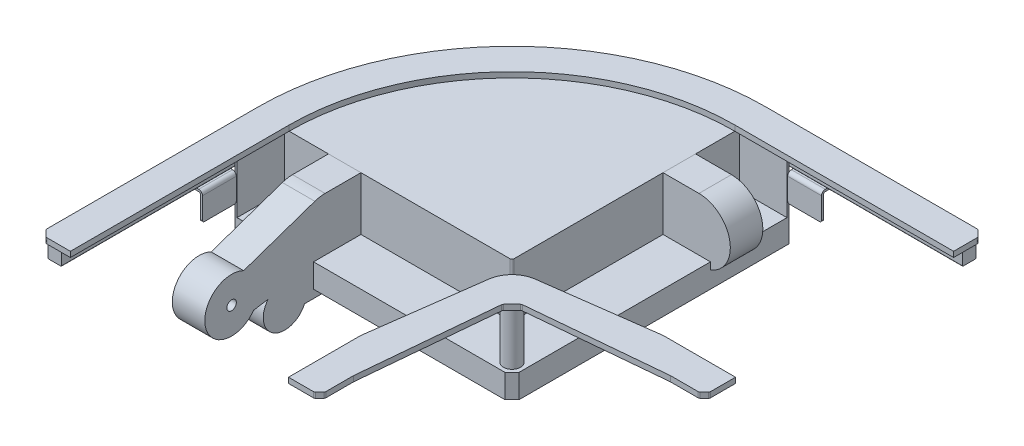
ISO-10303-21;
HEADER;
FILE_DESCRIPTION(('STEP AP214'),'2;1');
FILE_NAME('part.step','',(''),(''),'','','');
FILE_SCHEMA(('AUTOMOTIVE_DESIGN { 1 0 10303 214 1 1 1 1 }'));
ENDSEC;
DATA;
#1=APPLICATION_CONTEXT('core data for automotive mechanical design processes');
#2=APPLICATION_PROTOCOL_DEFINITION('international standard','automotive_design',2000,#1);
#3=PRODUCT_CONTEXT('',#1,'mechanical');
#4=PRODUCT('Part','Part','',(#3));
#5=PRODUCT_RELATED_PRODUCT_CATEGORY('part','',(#4));
#6=PRODUCT_DEFINITION_FORMATION('','',#4);
#7=PRODUCT_DEFINITION_CONTEXT('part definition',#1,'design');
#8=PRODUCT_DEFINITION('design','',#6,#7);
#9=PRODUCT_DEFINITION_SHAPE('','',#8);
#10=(LENGTH_UNIT() NAMED_UNIT(*) SI_UNIT(.MILLI.,.METRE.));
#11=(NAMED_UNIT(*) PLANE_ANGLE_UNIT() SI_UNIT($,.RADIAN.));
#12=(NAMED_UNIT(*) SI_UNIT($,.STERADIAN.) SOLID_ANGLE_UNIT());
#13=UNCERTAINTY_MEASURE_WITH_UNIT(LENGTH_MEASURE(1.E-05),#10,'distance_accuracy_value','');
#14=(GEOMETRIC_REPRESENTATION_CONTEXT(3) GLOBAL_UNCERTAINTY_ASSIGNED_CONTEXT((#13)) GLOBAL_UNIT_ASSIGNED_CONTEXT((#10,
#11,#12)) REPRESENTATION_CONTEXT('',''));
#15=CARTESIAN_POINT('',(0.,0.,0.));
#16=DIRECTION('',(0.,0.,1.));
#17=DIRECTION('',(1.,0.,0.));
#18=AXIS2_PLACEMENT_3D('',#15,#16,#17);
#19=CARTESIAN_POINT('',(120.999999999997,91.,-364.000000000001));
#20=DIRECTION('',(0.,0.,-1.));
#21=DIRECTION('',(1.,0.,0.));
#22=AXIS2_PLACEMENT_3D('',#19,#20,#21);
#23=PLANE('',#22);
#24=DIRECTION('',(-1.,0.,0.));
#25=VECTOR('',#24,1.);
#26=CARTESIAN_POINT('',(120.999999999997,94.,-364.000000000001));
#27=LINE('',#26,#25);
#28=CARTESIAN_POINT('',(117.999999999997,94.,-364.000000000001));
#29=VERTEX_POINT('',#28);
#30=CARTESIAN_POINT('',(73.9999999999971,94.,-364.000000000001));
#31=VERTEX_POINT('',#30);
#32=EDGE_CURVE('E154',#29,#31,#27,.T.);
#33=ORIENTED_EDGE('',*,*,#32,.F.);
#34=DIRECTION('',(0.,1.,0.));
#35=VECTOR('',#34,1.);
#36=CARTESIAN_POINT('',(117.999999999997,94.,-364.000000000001));
#37=LINE('',#36,#35);
#38=CARTESIAN_POINT('',(117.999999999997,91.,-364.000000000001));
#39=VERTEX_POINT('',#38);
#40=EDGE_CURVE('E225',#39,#29,#37,.T.);
#41=ORIENTED_EDGE('',*,*,#40,.F.);
#42=DIRECTION('',(-1.,0.,0.));
#43=VECTOR('',#42,1.);
#44=CARTESIAN_POINT('',(120.999999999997,91.,-364.000000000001));
#45=LINE('',#44,#43);
#46=CARTESIAN_POINT('',(73.9999999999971,91.,-364.000000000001));
#47=VERTEX_POINT('',#46);
#48=EDGE_CURVE('E180',#39,#47,#45,.T.);
#49=ORIENTED_EDGE('',*,*,#48,.T.);
#50=DIRECTION('',(0.,1.,0.));
#51=VECTOR('',#50,1.);
#52=CARTESIAN_POINT('',(73.9999999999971,91.,-364.000000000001));
#53=LINE('',#52,#51);
#54=EDGE_CURVE('E227',#31,#47,#53,.F.);
#55=ORIENTED_EDGE('',*,*,#54,.F.);
#56=EDGE_LOOP('',(#33,#41,#49,#55));
#57=FACE_BOUND('',#56,.T.);
#58=ADVANCED_FACE('F45',(#57),#23,.T.);
#59=CARTESIAN_POINT('',(120.999999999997,91.,-341.540000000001));
#60=DIRECTION('',(0.,-1.,0.));
#61=DIRECTION('',(-1.,0.,0.));
#62=AXIS2_PLACEMENT_3D('',#59,#60,#61);
#63=PLANE('',#62);
#64=ORIENTED_EDGE('',*,*,#48,.F.);
#65=CARTESIAN_POINT('',(117.999999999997,91.,-361.000000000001));
#66=DIRECTION('',(0.,1.,0.));
#67=DIRECTION('',(-1.,0.,0.));
#68=AXIS2_PLACEMENT_3D('',#65,#66,#67);
#69=CIRCLE('',#68,3.);
#70=CARTESIAN_POINT('',(120.999999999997,91.,-361.000000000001));
#71=VERTEX_POINT('',#70);
#72=EDGE_CURVE('E53',#71,#39,#69,.T.);
#73=ORIENTED_EDGE('',*,*,#72,.F.);
#74=DIRECTION('',(0.,0.,-1.));
#75=VECTOR('',#74,1.);
#76=CARTESIAN_POINT('',(120.999999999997,91.,-341.540000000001));
#77=LINE('',#76,#75);
#78=CARTESIAN_POINT('',(120.999999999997,91.,-341.540000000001));
#79=VERTEX_POINT('',#78);
#80=EDGE_CURVE('E167',#79,#71,#77,.T.);
#81=ORIENTED_EDGE('',*,*,#80,.F.);
#82=DIRECTION('',(-1.,0.,0.));
#83=VECTOR('',#82,1.);
#84=CARTESIAN_POINT('',(120.999999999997,91.,-341.540000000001));
#85=LINE('',#84,#83);
#86=CARTESIAN_POINT('',(70.9999999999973,91.,-341.540000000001));
#87=VERTEX_POINT('',#86);
#88=EDGE_CURVE('E184',#79,#87,#85,.T.);
#89=ORIENTED_EDGE('',*,*,#88,.T.);
#90=DIRECTION('',(0.,0.,-1.));
#91=VECTOR('',#90,1.);
#92=CARTESIAN_POINT('',(70.9999999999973,91.,-341.540000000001));
#93=LINE('',#92,#91);
#94=CARTESIAN_POINT('',(70.9999999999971,91.,-361.000000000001));
#95=VERTEX_POINT('',#94);
#96=EDGE_CURVE('E143',#87,#95,#93,.T.);
#97=ORIENTED_EDGE('',*,*,#96,.T.);
#98=CARTESIAN_POINT('',(73.9999999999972,91.,-361.000000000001));
#99=DIRECTION('',(0.,1.,0.));
#100=DIRECTION('',(-1.,0.,0.));
#101=AXIS2_PLACEMENT_3D('',#98,#99,#100);
#102=CIRCLE('',#101,3.);
#103=EDGE_CURVE('E12',#47,#95,#102,.T.);
#104=ORIENTED_EDGE('',*,*,#103,.F.);
#105=EDGE_LOOP('',(#64,#73,#81,#89,#97,#104));
#106=FACE_BOUND('',#105,.T.);
#107=ADVANCED_FACE('F234',(#106),#63,.T.);
#108=CARTESIAN_POINT('',(120.999999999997,88.46,-341.540000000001));
#109=DIRECTION('',(-1.,0.,0.));
#110=DIRECTION('',(0.,0.,-1.));
#111=AXIS2_PLACEMENT_3D('',#108,#109,#110);
#112=CYLINDRICAL_SURFACE('',#111,2.54000000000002);
#113=CARTESIAN_POINT('',(70.9999999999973,88.46,-341.540000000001));
#114=DIRECTION('',(-1.,0.,0.));
#115=DIRECTION('',(0.,0.,1.));
#116=AXIS2_PLACEMENT_3D('',#113,#114,#115);
#117=CIRCLE('',#116,2.54000000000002);
#118=CARTESIAN_POINT('',(70.9999999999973,88.46,-339.000000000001));
#119=VERTEX_POINT('',#118);
#120=EDGE_CURVE('E177',#119,#87,#117,.T.);
#121=ORIENTED_EDGE('',*,*,#120,.T.);
#122=ORIENTED_EDGE('',*,*,#88,.F.);
#123=CARTESIAN_POINT('',(120.999999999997,88.46,-341.540000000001));
#124=DIRECTION('',(-1.,0.,0.));
#125=DIRECTION('',(0.,0.,1.));
#126=AXIS2_PLACEMENT_3D('',#123,#124,#125);
#127=CIRCLE('',#126,2.54000000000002);
#128=CARTESIAN_POINT('',(120.999999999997,88.46,-339.000000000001));
#129=VERTEX_POINT('',#128);
#130=EDGE_CURVE('E165',#129,#79,#127,.T.);
#131=ORIENTED_EDGE('',*,*,#130,.F.);
#132=DIRECTION('',(-1.,0.,0.));
#133=VECTOR('',#132,1.);
#134=CARTESIAN_POINT('',(120.999999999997,88.46,-339.000000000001));
#135=LINE('',#134,#133);
#136=EDGE_CURVE('E187',#129,#119,#135,.T.);
#137=ORIENTED_EDGE('',*,*,#136,.T.);
#138=EDGE_LOOP('',(#121,#122,#131,#137));
#139=FACE_BOUND('',#138,.T.);
#140=ADVANCED_FACE('F241',(#139),#112,.F.);
#141=CARTESIAN_POINT('',(120.999999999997,54.,-339.000000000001));
#142=DIRECTION('',(0.,0.,-1.));
#143=DIRECTION('',(0.,-1.,0.));
#144=AXIS2_PLACEMENT_3D('',#141,#142,#143);
#145=PLANE('',#144);
#146=DIRECTION('',(0.,1.,0.));
#147=VECTOR('',#146,1.);
#148=CARTESIAN_POINT('',(70.9999999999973,54.,-339.000000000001));
#149=LINE('',#148,#147);
#150=CARTESIAN_POINT('',(70.9999999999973,57.,-339.000000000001));
#151=VERTEX_POINT('',#150);
#152=EDGE_CURVE('E175',#151,#119,#149,.T.);
#153=ORIENTED_EDGE('',*,*,#152,.T.);
#154=ORIENTED_EDGE('',*,*,#136,.F.);
#155=DIRECTION('',(0.,1.,0.));
#156=VECTOR('',#155,1.);
#157=CARTESIAN_POINT('',(120.999999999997,54.,-339.000000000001));
#158=LINE('',#157,#156);
#159=CARTESIAN_POINT('',(120.999999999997,57.,-339.000000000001));
#160=VERTEX_POINT('',#159);
#161=EDGE_CURVE('E161',#160,#129,#158,.T.);
#162=ORIENTED_EDGE('',*,*,#161,.F.);
#163=CARTESIAN_POINT('',(117.999999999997,57.,-339.000000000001));
#164=DIRECTION('',(0.,0.,1.));
#165=DIRECTION('',(0.,-1.,0.));
#166=AXIS2_PLACEMENT_3D('',#163,#164,#165);
#167=CIRCLE('',#166,3.);
#168=CARTESIAN_POINT('',(117.999999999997,54.,-339.000000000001));
#169=VERTEX_POINT('',#168);
#170=EDGE_CURVE('E202',#169,#160,#167,.T.);
#171=ORIENTED_EDGE('',*,*,#170,.F.);
#172=DIRECTION('',(-1.,0.,0.));
#173=VECTOR('',#172,1.);
#174=CARTESIAN_POINT('',(120.999999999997,54.,-339.000000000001));
#175=LINE('',#174,#173);
#176=CARTESIAN_POINT('',(73.9999999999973,54.,-339.000000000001));
#177=VERTEX_POINT('',#176);
#178=EDGE_CURVE('E190',#169,#177,#175,.T.);
#179=ORIENTED_EDGE('',*,*,#178,.T.);
#180=CARTESIAN_POINT('',(73.9999999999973,57.,-339.000000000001));
#181=DIRECTION('',(0.,0.,1.));
#182=DIRECTION('',(0.,-1.,0.));
#183=AXIS2_PLACEMENT_3D('',#180,#181,#182);
#184=CIRCLE('',#183,3.);
#185=EDGE_CURVE('E205',#151,#177,#184,.T.);
#186=ORIENTED_EDGE('',*,*,#185,.F.);
#187=EDGE_LOOP('',(#153,#154,#162,#171,#179,#186));
#188=FACE_BOUND('',#187,.T.);
#189=ADVANCED_FACE('F281',(#188),#145,.T.);
#190=CARTESIAN_POINT('',(120.999999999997,54.,-336.000000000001));
#191=DIRECTION('',(0.,-1.,0.));
#192=DIRECTION('',(0.,0.,1.));
#193=AXIS2_PLACEMENT_3D('',#190,#191,#192);
#194=PLANE('',#193);
#195=ORIENTED_EDGE('',*,*,#178,.F.);
#196=DIRECTION('',(0.,0.,-1.));
#197=VECTOR('',#196,1.);
#198=CARTESIAN_POINT('',(117.999999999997,54.,-339.000000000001));
#199=LINE('',#198,#197);
#200=CARTESIAN_POINT('',(117.999999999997,54.,-336.000000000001));
#201=VERTEX_POINT('',#200);
#202=EDGE_CURVE('E208',#201,#169,#199,.T.);
#203=ORIENTED_EDGE('',*,*,#202,.F.);
#204=DIRECTION('',(-1.,0.,0.));
#205=VECTOR('',#204,1.);
#206=CARTESIAN_POINT('',(120.999999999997,54.,-336.000000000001));
#207=LINE('',#206,#205);
#208=CARTESIAN_POINT('',(73.9999999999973,54.,-336.000000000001));
#209=VERTEX_POINT('',#208);
#210=EDGE_CURVE('E193',#201,#209,#207,.T.);
#211=ORIENTED_EDGE('',*,*,#210,.T.);
#212=DIRECTION('',(0.,0.,-1.));
#213=VECTOR('',#212,1.);
#214=CARTESIAN_POINT('',(73.9999999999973,54.,-336.000000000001));
#215=LINE('',#214,#213);
#216=EDGE_CURVE('E210',#177,#209,#215,.F.);
#217=ORIENTED_EDGE('',*,*,#216,.F.);
#218=EDGE_LOOP('',(#195,#203,#211,#217));
#219=FACE_BOUND('',#218,.T.);
#220=ADVANCED_FACE('F277',(#219),#194,.T.);
#221=CARTESIAN_POINT('',(120.999999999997,88.46,-336.000000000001));
#222=DIRECTION('',(0.,0.,1.));
#223=DIRECTION('',(0.,1.,0.));
#224=AXIS2_PLACEMENT_3D('',#221,#222,#223);
#225=PLANE('',#224);
#226=ORIENTED_EDGE('',*,*,#210,.F.);
#227=CARTESIAN_POINT('',(117.999999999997,57.,-336.000000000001));
#228=DIRECTION('',(0.,0.,-1.));
#229=DIRECTION('',(0.,1.,0.));
#230=AXIS2_PLACEMENT_3D('',#227,#228,#229);
#231=CIRCLE('',#230,3.);
#232=CARTESIAN_POINT('',(120.999999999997,57.,-336.000000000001));
#233=VERTEX_POINT('',#232);
#234=EDGE_CURVE('E213',#233,#201,#231,.T.);
#235=ORIENTED_EDGE('',*,*,#234,.F.);
#236=DIRECTION('',(0.,-1.,0.));
#237=VECTOR('',#236,1.);
#238=CARTESIAN_POINT('',(120.999999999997,88.46,-336.000000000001));
#239=LINE('',#238,#237);
#240=CARTESIAN_POINT('',(120.999999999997,88.46,-336.000000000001));
#241=VERTEX_POINT('',#240);
#242=EDGE_CURVE('E159',#241,#233,#239,.T.);
#243=ORIENTED_EDGE('',*,*,#242,.F.);
#244=DIRECTION('',(-1.,0.,0.));
#245=VECTOR('',#244,1.);
#246=CARTESIAN_POINT('',(120.999999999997,88.46,-336.000000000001));
#247=LINE('',#246,#245);
#248=CARTESIAN_POINT('',(70.9999999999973,88.46,-336.000000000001));
#249=VERTEX_POINT('',#248);
#250=EDGE_CURVE('E153',#241,#249,#247,.T.);
#251=ORIENTED_EDGE('',*,*,#250,.T.);
#252=DIRECTION('',(0.,-1.,0.));
#253=VECTOR('',#252,1.);
#254=CARTESIAN_POINT('',(70.9999999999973,88.46,-336.000000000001));
#255=LINE('',#254,#253);
#256=CARTESIAN_POINT('',(70.9999999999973,57.,-336.000000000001));
#257=VERTEX_POINT('',#256);
#258=EDGE_CURVE('E172',#249,#257,#255,.T.);
#259=ORIENTED_EDGE('',*,*,#258,.T.);
#260=CARTESIAN_POINT('',(73.9999999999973,57.,-336.000000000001));
#261=DIRECTION('',(0.,0.,-1.));
#262=DIRECTION('',(0.,1.,0.));
#263=AXIS2_PLACEMENT_3D('',#260,#261,#262);
#264=CIRCLE('',#263,3.);
#265=EDGE_CURVE('E215',#209,#257,#264,.T.);
#266=ORIENTED_EDGE('',*,*,#265,.F.);
#267=EDGE_LOOP('',(#226,#235,#243,#251,#259,#266));
#268=FACE_BOUND('',#267,.T.);
#269=ADVANCED_FACE('F275',(#268),#225,.T.);
#270=CARTESIAN_POINT('',(120.999999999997,88.46,-341.540000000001));
#271=DIRECTION('',(-1.,0.,0.));
#272=DIRECTION('',(0.,0.,-1.));
#273=AXIS2_PLACEMENT_3D('',#270,#271,#272);
#274=CYLINDRICAL_SURFACE('',#273,5.54000000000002);
#275=CARTESIAN_POINT('',(70.9999999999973,88.46,-341.540000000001));
#276=DIRECTION('',(1.,0.,0.));
#277=DIRECTION('',(0.,0.,-1.));
#278=AXIS2_PLACEMENT_3D('',#275,#276,#277);
#279=CIRCLE('',#278,5.54000000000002);
#280=CARTESIAN_POINT('',(70.9999999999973,94.,-341.540000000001));
#281=VERTEX_POINT('',#280);
#282=EDGE_CURVE('E170',#281,#249,#279,.T.);
#283=ORIENTED_EDGE('',*,*,#282,.T.);
#284=ORIENTED_EDGE('',*,*,#250,.F.);
#285=CARTESIAN_POINT('',(120.999999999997,88.46,-341.540000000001));
#286=DIRECTION('',(1.,0.,0.));
#287=DIRECTION('',(0.,0.,-1.));
#288=AXIS2_PLACEMENT_3D('',#285,#286,#287);
#289=CIRCLE('',#288,5.54000000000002);
#290=CARTESIAN_POINT('',(120.999999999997,94.,-341.540000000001));
#291=VERTEX_POINT('',#290);
#292=EDGE_CURVE('E137',#291,#241,#289,.T.);
#293=ORIENTED_EDGE('',*,*,#292,.F.);
#294=DIRECTION('',(-1.,0.,0.));
#295=VECTOR('',#294,1.);
#296=CARTESIAN_POINT('',(120.999999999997,94.,-341.540000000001));
#297=LINE('',#296,#295);
#298=EDGE_CURVE('E146',#291,#281,#297,.T.);
#299=ORIENTED_EDGE('',*,*,#298,.T.);
#300=EDGE_LOOP('',(#283,#284,#293,#299));
#301=FACE_BOUND('',#300,.T.);
#302=ADVANCED_FACE('F156',(#301),#274,.T.);
#303=CARTESIAN_POINT('',(120.999999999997,94.,-364.000000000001));
#304=DIRECTION('',(0.,1.,0.));
#305=DIRECTION('',(1.,0.,0.));
#306=AXIS2_PLACEMENT_3D('',#303,#304,#305);
#307=PLANE('',#306);
#308=DIRECTION('',(0.,0.,1.));
#309=VECTOR('',#308,1.);
#310=CARTESIAN_POINT('',(70.9999999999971,94.,-364.000000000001));
#311=LINE('',#310,#309);
#312=CARTESIAN_POINT('',(70.9999999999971,94.,-361.000000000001));
#313=VERTEX_POINT('',#312);
#314=EDGE_CURVE('E150',#313,#281,#311,.T.);
#315=ORIENTED_EDGE('',*,*,#314,.T.);
#316=ORIENTED_EDGE('',*,*,#298,.F.);
#317=DIRECTION('',(0.,0.,1.));
#318=VECTOR('',#317,1.);
#319=CARTESIAN_POINT('',(120.999999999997,94.,-364.000000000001));
#320=LINE('',#319,#318);
#321=CARTESIAN_POINT('',(120.999999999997,94.,-361.000000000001));
#322=VERTEX_POINT('',#321);
#323=EDGE_CURVE('E132',#322,#291,#320,.T.);
#324=ORIENTED_EDGE('',*,*,#323,.F.);
#325=CARTESIAN_POINT('',(117.999999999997,94.,-361.000000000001));
#326=DIRECTION('',(0.,-1.,0.));
#327=DIRECTION('',(1.,0.,0.));
#328=AXIS2_PLACEMENT_3D('',#325,#326,#327);
#329=CIRCLE('',#328,3.);
#330=EDGE_CURVE('E221',#29,#322,#329,.T.);
#331=ORIENTED_EDGE('',*,*,#330,.F.);
#332=ORIENTED_EDGE('',*,*,#32,.T.);
#333=CARTESIAN_POINT('',(73.9999999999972,94.,-361.000000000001));
#334=DIRECTION('',(0.,-1.,0.));
#335=DIRECTION('',(1.,0.,0.));
#336=AXIS2_PLACEMENT_3D('',#333,#334,#335);
#337=CIRCLE('',#336,3.);
#338=EDGE_CURVE('E223',#313,#31,#337,.T.);
#339=ORIENTED_EDGE('',*,*,#338,.F.);
#340=EDGE_LOOP('',(#315,#316,#324,#331,#332,#339));
#341=FACE_BOUND('',#340,.T.);
#342=ADVANCED_FACE('F147',(#341),#307,.T.);
#343=CARTESIAN_POINT('',(120.999999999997,88.46,-341.540000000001));
#344=DIRECTION('',(-1.,0.,0.));
#345=DIRECTION('',(0.,0.,-1.));
#346=AXIS2_PLACEMENT_3D('',#343,#344,#345);
#347=PLANE('',#346);
#348=ORIENTED_EDGE('',*,*,#161,.T.);
#349=ORIENTED_EDGE('',*,*,#130,.T.);
#350=ORIENTED_EDGE('',*,*,#80,.T.);
#351=DIRECTION('',(0.,1.,0.));
#352=VECTOR('',#351,1.);
#353=CARTESIAN_POINT('',(120.999999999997,91.,-361.000000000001));
#354=LINE('',#353,#352);
#355=EDGE_CURVE('E140',#322,#71,#354,.F.);
#356=ORIENTED_EDGE('',*,*,#355,.F.);
#357=ORIENTED_EDGE('',*,*,#323,.T.);
#358=ORIENTED_EDGE('',*,*,#292,.T.);
#359=ORIENTED_EDGE('',*,*,#242,.T.);
#360=DIRECTION('',(0.,0.,-1.));
#361=VECTOR('',#360,1.);
#362=CARTESIAN_POINT('',(120.999999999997,57.,-336.000000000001));
#363=LINE('',#362,#361);
#364=EDGE_CURVE('E219',#160,#233,#363,.F.);
#365=ORIENTED_EDGE('',*,*,#364,.F.);
#366=EDGE_LOOP('',(#348,#349,#350,#356,#357,#358,#359,#365));
#367=FACE_BOUND('',#366,.T.);
#368=ADVANCED_FACE('F134',(#367),#347,.F.);
#369=CARTESIAN_POINT('',(70.9999999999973,88.46,-341.540000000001));
#370=DIRECTION('',(-1.,0.,0.));
#371=DIRECTION('',(0.,0.,-1.));
#372=AXIS2_PLACEMENT_3D('',#369,#370,#371);
#373=PLANE('',#372);
#374=ORIENTED_EDGE('',*,*,#258,.F.);
#375=ORIENTED_EDGE('',*,*,#282,.F.);
#376=ORIENTED_EDGE('',*,*,#314,.F.);
#377=DIRECTION('',(0.,1.,0.));
#378=VECTOR('',#377,1.);
#379=CARTESIAN_POINT('',(70.9999999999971,88.46,-361.000000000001));
#380=LINE('',#379,#378);
#381=EDGE_CURVE('E183',#95,#313,#380,.T.);
#382=ORIENTED_EDGE('',*,*,#381,.F.);
#383=ORIENTED_EDGE('',*,*,#96,.F.);
#384=ORIENTED_EDGE('',*,*,#120,.F.);
#385=ORIENTED_EDGE('',*,*,#152,.F.);
#386=DIRECTION('',(0.,0.,-1.));
#387=VECTOR('',#386,1.);
#388=CARTESIAN_POINT('',(70.9999999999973,57.,-341.540000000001));
#389=LINE('',#388,#387);
#390=EDGE_CURVE('E200',#257,#151,#389,.T.);
#391=ORIENTED_EDGE('',*,*,#390,.F.);
#392=EDGE_LOOP('',(#374,#375,#376,#382,#383,#384,#385,#391));
#393=FACE_BOUND('',#392,.T.);
#394=ADVANCED_FACE('F247',(#393),#373,.T.);
#395=CARTESIAN_POINT('',(73.9999999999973,57.,-341.540000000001));
#396=DIRECTION('',(0.,0.,-1.));
#397=DIRECTION('',(0.,-1.,0.));
#398=AXIS2_PLACEMENT_3D('',#395,#396,#397);
#399=CYLINDRICAL_SURFACE('',#398,3.);
#400=ORIENTED_EDGE('',*,*,#265,.T.);
#401=ORIENTED_EDGE('',*,*,#390,.T.);
#402=ORIENTED_EDGE('',*,*,#185,.T.);
#403=ORIENTED_EDGE('',*,*,#216,.T.);
#404=EDGE_LOOP('',(#400,#401,#402,#403));
#405=FACE_BOUND('',#404,.T.);
#406=ADVANCED_FACE('F262',(#405),#399,.T.);
#407=CARTESIAN_POINT('',(117.999999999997,57.,-336.000000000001));
#408=DIRECTION('',(0.,0.,1.));
#409=DIRECTION('',(0.,1.,0.));
#410=AXIS2_PLACEMENT_3D('',#407,#408,#409);
#411=CYLINDRICAL_SURFACE('',#410,3.);
#412=ORIENTED_EDGE('',*,*,#234,.T.);
#413=ORIENTED_EDGE('',*,*,#202,.T.);
#414=ORIENTED_EDGE('',*,*,#170,.T.);
#415=ORIENTED_EDGE('',*,*,#364,.T.);
#416=EDGE_LOOP('',(#412,#413,#414,#415));
#417=FACE_BOUND('',#416,.T.);
#418=ADVANCED_FACE('F252',(#417),#411,.T.);
#419=CARTESIAN_POINT('',(73.9999999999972,88.46,-361.000000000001));
#420=DIRECTION('',(0.,1.,0.));
#421=DIRECTION('',(1.,0.,0.));
#422=AXIS2_PLACEMENT_3D('',#419,#420,#421);
#423=CYLINDRICAL_SURFACE('',#422,3.);
#424=ORIENTED_EDGE('',*,*,#103,.T.);
#425=ORIENTED_EDGE('',*,*,#381,.T.);
#426=ORIENTED_EDGE('',*,*,#338,.T.);
#427=ORIENTED_EDGE('',*,*,#54,.T.);
#428=EDGE_LOOP('',(#424,#425,#426,#427));
#429=FACE_BOUND('',#428,.T.);
#430=ADVANCED_FACE('F230',(#429),#423,.T.);
#431=CARTESIAN_POINT('',(117.999999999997,91.,-361.000000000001));
#432=DIRECTION('',(0.,-1.,0.));
#433=DIRECTION('',(-1.,0.,0.));
#434=AXIS2_PLACEMENT_3D('',#431,#432,#433);
#435=CYLINDRICAL_SURFACE('',#434,3.);
#436=ORIENTED_EDGE('',*,*,#72,.T.);
#437=ORIENTED_EDGE('',*,*,#40,.T.);
#438=ORIENTED_EDGE('',*,*,#330,.T.);
#439=ORIENTED_EDGE('',*,*,#355,.T.);
#440=EDGE_LOOP('',(#436,#437,#438,#439));
#441=FACE_BOUND('',#440,.T.);
#442=ADVANCED_FACE('F47',(#441),#435,.T.);
#443=CLOSED_SHELL('',(#58,#107,#140,#189,#220,#269,#302,#342,#368,#394,#406,#418,#430,#442));
#444=MANIFOLD_SOLID_BREP('B2',#443);
#445=CARTESIAN_POINT('',(38.9999999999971,94.,-364.));
#446=DIRECTION('',(0.,0.,1.));
#447=DIRECTION('',(-1.,0.,0.));
#448=AXIS2_PLACEMENT_3D('',#445,#446,#447);
#449=PLANE('',#448);
#450=DIRECTION('',(0.,1.,0.));
#451=VECTOR('',#450,1.);
#452=CARTESIAN_POINT('',(38.9999999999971,94.,-364.));
#453=LINE('',#452,#451);
#454=CARTESIAN_POINT('',(38.9999999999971,95.,-364.));
#455=VERTEX_POINT('',#454);
#456=CARTESIAN_POINT('',(38.9999999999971,113.,-364.));
#457=VERTEX_POINT('',#456);
#458=EDGE_CURVE('E480',#455,#457,#453,.T.);
#459=ORIENTED_EDGE('',*,*,#458,.T.);
#460=DIRECTION('',(-1.,0.,0.));
#461=VECTOR('',#460,1.);
#462=CARTESIAN_POINT('',(38.9999999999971,113.,-364.));
#463=LINE('',#462,#461);
#464=CARTESIAN_POINT('',(320.999999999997,113.,-364.000000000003));
#465=VERTEX_POINT('',#464);
#466=EDGE_CURVE('E394',#465,#457,#463,.T.);
#467=ORIENTED_EDGE('',*,*,#466,.F.);
#468=DIRECTION('',(0.,1.,0.));
#469=VECTOR('',#468,1.);
#470=CARTESIAN_POINT('',(320.999999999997,94.,-364.000000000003));
#471=LINE('',#470,#469);
#472=CARTESIAN_POINT('',(320.999999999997,95.,-364.000000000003));
#473=VERTEX_POINT('',#472);
#474=EDGE_CURVE('E474',#473,#465,#471,.T.);
#475=ORIENTED_EDGE('',*,*,#474,.F.);
#476=DIRECTION('',(-1.,0.,0.));
#477=VECTOR('',#476,1.);
#478=CARTESIAN_POINT('',(38.9999999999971,95.,-364.));
#479=LINE('',#478,#477);
#480=EDGE_CURVE('E43',#455,#473,#479,.F.);
#481=ORIENTED_EDGE('',*,*,#480,.F.);
#482=EDGE_LOOP('',(#459,#467,#475,#481));
#483=FACE_BOUND('',#482,.T.);
#484=ADVANCED_FACE('F386',(#483),#449,.F.);
#485=CARTESIAN_POINT('',(38.9999999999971,94.,-364.));
#486=DIRECTION('',(1.,0.,0.));
#487=DIRECTION('',(0.,0.,1.));
#488=AXIS2_PLACEMENT_3D('',#485,#486,#487);
#489=PLANE('',#488);
#490=DIRECTION('',(0.,0.,1.));
#491=VECTOR('',#490,1.);
#492=CARTESIAN_POINT('',(38.9999999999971,114.,-364.));
#493=LINE('',#492,#491);
#494=CARTESIAN_POINT('',(38.9999999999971,114.,-363.));
#495=VERTEX_POINT('',#494);
#496=CARTESIAN_POINT('',(38.9999999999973,114.,-345.));
#497=VERTEX_POINT('',#496);
#498=EDGE_CURVE('E521',#495,#497,#493,.T.);
#499=ORIENTED_EDGE('',*,*,#498,.F.);
#500=CARTESIAN_POINT('',(38.9999999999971,113.,-363.));
#501=DIRECTION('',(-1.,0.,0.));
#502=DIRECTION('',(0.,0.,1.));
#503=AXIS2_PLACEMENT_3D('',#500,#501,#502);
#504=CIRCLE('',#503,1.);
#505=EDGE_CURVE('E401',#457,#495,#504,.F.);
#506=ORIENTED_EDGE('',*,*,#505,.F.);
#507=ORIENTED_EDGE('',*,*,#458,.F.);
#508=CARTESIAN_POINT('',(38.9999999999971,95.,-363.));
#509=DIRECTION('',(-1.,0.,0.));
#510=DIRECTION('',(0.,0.,1.));
#511=AXIS2_PLACEMENT_3D('',#508,#509,#510);
#512=CIRCLE('',#511,1.);
#513=CARTESIAN_POINT('',(38.9999999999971,94.,-363.));
#514=VERTEX_POINT('',#513);
#515=EDGE_CURVE('E408',#514,#455,#512,.F.);
#516=ORIENTED_EDGE('',*,*,#515,.F.);
#517=DIRECTION('',(0.,0.,1.));
#518=VECTOR('',#517,1.);
#519=CARTESIAN_POINT('',(38.9999999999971,94.,-364.));
#520=LINE('',#519,#518);
#521=CARTESIAN_POINT('',(38.9999999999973,94.,-345.));
#522=VERTEX_POINT('',#521);
#523=EDGE_CURVE('E514',#514,#522,#520,.T.);
#524=ORIENTED_EDGE('',*,*,#523,.T.);
#525=CARTESIAN_POINT('',(38.9999999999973,95.,-345.));
#526=DIRECTION('',(-1.,0.,0.));
#527=DIRECTION('',(0.,0.,1.));
#528=AXIS2_PLACEMENT_3D('',#525,#526,#527);
#529=CIRCLE('',#528,1.);
#530=CARTESIAN_POINT('',(38.9999999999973,95.,-344.));
#531=VERTEX_POINT('',#530);
#532=EDGE_CURVE('E498',#531,#522,#529,.F.);
#533=ORIENTED_EDGE('',*,*,#532,.F.);
#534=DIRECTION('',(0.,1.,0.));
#535=VECTOR('',#534,1.);
#536=CARTESIAN_POINT('',(38.9999999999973,94.,-344.));
#537=LINE('',#536,#535);
#538=CARTESIAN_POINT('',(38.9999999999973,113.,-344.));
#539=VERTEX_POINT('',#538);
#540=EDGE_CURVE('E473',#531,#539,#537,.T.);
#541=ORIENTED_EDGE('',*,*,#540,.T.);
#542=CARTESIAN_POINT('',(38.9999999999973,113.,-345.));
#543=DIRECTION('',(-1.,0.,0.));
#544=DIRECTION('',(0.,0.,1.));
#545=AXIS2_PLACEMENT_3D('',#542,#543,#544);
#546=CIRCLE('',#545,1.);
#547=EDGE_CURVE('E500',#497,#539,#546,.F.);
#548=ORIENTED_EDGE('',*,*,#547,.F.);
#549=EDGE_LOOP('',(#499,#506,#507,#516,#524,#533,#541,#548));
#550=FACE_BOUND('',#549,.T.);
#551=ADVANCED_FACE('F511',(#550),#489,.F.);
#552=CARTESIAN_POINT('',(38.9999999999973,94.,-344.));
#553=DIRECTION('',(0.,0.,-1.));
#554=DIRECTION('',(1.,0.,0.));
#555=AXIS2_PLACEMENT_3D('',#552,#553,#554);
#556=PLANE('',#555);
#557=ORIENTED_EDGE('',*,*,#540,.F.);
#558=DIRECTION('',(1.,0.,0.));
#559=VECTOR('',#558,1.);
#560=CARTESIAN_POINT('',(38.9999999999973,95.,-344.));
#561=LINE('',#560,#559);
#562=CARTESIAN_POINT('',(320.999999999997,95.,-344.000000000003));
#563=VERTEX_POINT('',#562);
#564=EDGE_CURVE('E457',#563,#531,#561,.F.);
#565=ORIENTED_EDGE('',*,*,#564,.F.);
#566=DIRECTION('',(0.,1.,0.));
#567=VECTOR('',#566,1.);
#568=CARTESIAN_POINT('',(320.999999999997,94.,-344.000000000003));
#569=LINE('',#568,#567);
#570=CARTESIAN_POINT('',(320.999999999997,113.,-344.000000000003));
#571=VERTEX_POINT('',#570);
#572=EDGE_CURVE('E467',#563,#571,#569,.T.);
#573=ORIENTED_EDGE('',*,*,#572,.T.);
#574=DIRECTION('',(1.,0.,0.));
#575=VECTOR('',#574,1.);
#576=CARTESIAN_POINT('',(320.999999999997,113.,-344.000000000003));
#577=LINE('',#576,#575);
#578=EDGE_CURVE('E479',#539,#571,#577,.T.);
#579=ORIENTED_EDGE('',*,*,#578,.F.);
#580=EDGE_LOOP('',(#557,#565,#573,#579));
#581=FACE_BOUND('',#580,.T.);
#582=ADVANCED_FACE('F476',(#581),#556,.F.);
#583=CARTESIAN_POINT('',(320.999999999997,94.,-364.000000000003));
#584=DIRECTION('',(-1.,0.,0.));
#585=DIRECTION('',(0.,0.,-1.));
#586=AXIS2_PLACEMENT_3D('',#583,#584,#585);
#587=PLANE('',#586);
#588=ORIENTED_EDGE('',*,*,#572,.F.);
#589=CARTESIAN_POINT('',(320.999999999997,95.,-345.000000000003));
#590=DIRECTION('',(1.,0.,0.));
#591=DIRECTION('',(0.,0.,-1.));
#592=AXIS2_PLACEMENT_3D('',#589,#590,#591);
#593=CIRCLE('',#592,1.);
#594=CARTESIAN_POINT('',(320.999999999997,94.,-345.000000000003));
#595=VERTEX_POINT('',#594);
#596=EDGE_CURVE('E452',#595,#563,#593,.F.);
#597=ORIENTED_EDGE('',*,*,#596,.F.);
#598=DIRECTION('',(0.,0.,-1.));
#599=VECTOR('',#598,1.);
#600=CARTESIAN_POINT('',(320.999999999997,94.,-364.000000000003));
#601=LINE('',#600,#599);
#602=CARTESIAN_POINT('',(320.999999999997,94.,-363.000000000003));
#603=VERTEX_POINT('',#602);
#604=EDGE_CURVE('E516',#595,#603,#601,.T.);
#605=ORIENTED_EDGE('',*,*,#604,.T.);
#606=CARTESIAN_POINT('',(320.999999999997,95.,-363.000000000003));
#607=DIRECTION('',(1.,0.,0.));
#608=DIRECTION('',(0.,0.,-1.));
#609=AXIS2_PLACEMENT_3D('',#606,#607,#608);
#610=CIRCLE('',#609,1.);
#611=EDGE_CURVE('E464',#473,#603,#610,.F.);
#612=ORIENTED_EDGE('',*,*,#611,.F.);
#613=ORIENTED_EDGE('',*,*,#474,.T.);
#614=CARTESIAN_POINT('',(320.999999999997,113.,-363.000000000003));
#615=DIRECTION('',(1.,0.,0.));
#616=DIRECTION('',(0.,0.,-1.));
#617=AXIS2_PLACEMENT_3D('',#614,#615,#616);
#618=CIRCLE('',#617,1.);
#619=CARTESIAN_POINT('',(320.999999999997,114.,-363.000000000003));
#620=VERTEX_POINT('',#619);
#621=EDGE_CURVE('E482',#620,#465,#618,.F.);
#622=ORIENTED_EDGE('',*,*,#621,.F.);
#623=DIRECTION('',(0.,0.,-1.));
#624=VECTOR('',#623,1.);
#625=CARTESIAN_POINT('',(320.999999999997,114.,-364.000000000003));
#626=LINE('',#625,#624);
#627=CARTESIAN_POINT('',(320.999999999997,114.,-345.000000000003));
#628=VERTEX_POINT('',#627);
#629=EDGE_CURVE('E517',#628,#620,#626,.T.);
#630=ORIENTED_EDGE('',*,*,#629,.F.);
#631=CARTESIAN_POINT('',(320.999999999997,113.,-345.000000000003));
#632=DIRECTION('',(1.,0.,0.));
#633=DIRECTION('',(0.,0.,-1.));
#634=AXIS2_PLACEMENT_3D('',#631,#632,#633);
#635=CIRCLE('',#634,1.);
#636=EDGE_CURVE('E463',#571,#628,#635,.F.);
#637=ORIENTED_EDGE('',*,*,#636,.F.);
#638=EDGE_LOOP('',(#588,#597,#605,#612,#613,#622,#630,#637));
#639=FACE_BOUND('',#638,.T.);
#640=ADVANCED_FACE('F468',(#639),#587,.F.);
#641=CARTESIAN_POINT('',(0.,94.,0.));
#642=DIRECTION('',(0.,1.,0.));
#643=DIRECTION('',(1.,0.,0.));
#644=AXIS2_PLACEMENT_3D('',#641,#642,#643);
#645=PLANE('',#644);
#646=ORIENTED_EDGE('',*,*,#523,.F.);
#647=DIRECTION('',(-1.,0.,0.));
#648=VECTOR('',#647,1.);
#649=CARTESIAN_POINT('',(-2.90167889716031E-12,94.,-363.));
#650=LINE('',#649,#648);
#651=EDGE_CURVE('E503',#603,#514,#650,.T.);
#652=ORIENTED_EDGE('',*,*,#651,.F.);
#653=ORIENTED_EDGE('',*,*,#604,.F.);
#654=DIRECTION('',(1.,0.,0.));
#655=VECTOR('',#654,1.);
#656=CARTESIAN_POINT('',(-2.75779399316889E-12,94.,-345.));
#657=LINE('',#656,#655);
#658=EDGE_CURVE('E459',#522,#595,#657,.T.);
#659=ORIENTED_EDGE('',*,*,#658,.F.);
#660=EDGE_LOOP('',(#646,#652,#653,#659));
#661=FACE_BOUND('',#660,.T.);
#662=ADVANCED_FACE('F550',(#661),#645,.F.);
#663=CARTESIAN_POINT('',(0.,114.,0.));
#664=DIRECTION('',(0.,1.,0.));
#665=DIRECTION('',(1.,0.,0.));
#666=AXIS2_PLACEMENT_3D('',#663,#664,#665);
#667=PLANE('',#666);
#668=ORIENTED_EDGE('',*,*,#629,.T.);
#669=DIRECTION('',(-1.,0.,0.));
#670=VECTOR('',#669,1.);
#671=CARTESIAN_POINT('',(320.999999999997,114.,-363.000000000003));
#672=LINE('',#671,#670);
#673=EDGE_CURVE('E492',#495,#620,#672,.F.);
#674=ORIENTED_EDGE('',*,*,#673,.F.);
#675=ORIENTED_EDGE('',*,*,#498,.T.);
#676=DIRECTION('',(1.,0.,0.));
#677=VECTOR('',#676,1.);
#678=CARTESIAN_POINT('',(38.9999999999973,114.,-345.));
#679=LINE('',#678,#677);
#680=EDGE_CURVE('E494',#628,#497,#679,.F.);
#681=ORIENTED_EDGE('',*,*,#680,.F.);
#682=EDGE_LOOP('',(#668,#674,#675,#681));
#683=FACE_BOUND('',#682,.T.);
#684=ADVANCED_FACE('F529',(#683),#667,.T.);
#685=CARTESIAN_POINT('',(38.9999999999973,113.,-345.));
#686=DIRECTION('',(-1.,0.,0.));
#687=DIRECTION('',(0.,0.,-1.));
#688=AXIS2_PLACEMENT_3D('',#685,#686,#687);
#689=CYLINDRICAL_SURFACE('',#688,1.);
#690=ORIENTED_EDGE('',*,*,#547,.T.);
#691=ORIENTED_EDGE('',*,*,#578,.T.);
#692=ORIENTED_EDGE('',*,*,#636,.T.);
#693=ORIENTED_EDGE('',*,*,#680,.T.);
#694=EDGE_LOOP('',(#690,#691,#692,#693));
#695=FACE_BOUND('',#694,.T.);
#696=ADVANCED_FACE('F536',(#695),#689,.T.);
#697=CARTESIAN_POINT('',(-2.75779399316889E-12,95.,-345.));
#698=DIRECTION('',(1.,0.,0.));
#699=DIRECTION('',(0.,0.,1.));
#700=AXIS2_PLACEMENT_3D('',#697,#698,#699);
#701=CYLINDRICAL_SURFACE('',#700,1.);
#702=ORIENTED_EDGE('',*,*,#532,.T.);
#703=ORIENTED_EDGE('',*,*,#658,.T.);
#704=ORIENTED_EDGE('',*,*,#596,.T.);
#705=ORIENTED_EDGE('',*,*,#564,.T.);
#706=EDGE_LOOP('',(#702,#703,#704,#705));
#707=FACE_BOUND('',#706,.T.);
#708=ADVANCED_FACE('F455',(#707),#701,.T.);
#709=CARTESIAN_POINT('',(-2.90167889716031E-12,95.,-363.));
#710=DIRECTION('',(-1.,0.,0.));
#711=DIRECTION('',(0.,0.,-1.));
#712=AXIS2_PLACEMENT_3D('',#709,#710,#711);
#713=CYLINDRICAL_SURFACE('',#712,1.);
#714=ORIENTED_EDGE('',*,*,#611,.T.);
#715=ORIENTED_EDGE('',*,*,#651,.T.);
#716=ORIENTED_EDGE('',*,*,#515,.T.);
#717=ORIENTED_EDGE('',*,*,#480,.T.);
#718=EDGE_LOOP('',(#714,#715,#716,#717));
#719=FACE_BOUND('',#718,.T.);
#720=ADVANCED_FACE('F530',(#719),#713,.T.);
#721=CARTESIAN_POINT('',(38.9999999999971,113.,-363.));
#722=DIRECTION('',(1.,0.,0.));
#723=DIRECTION('',(0.,0.,1.));
#724=AXIS2_PLACEMENT_3D('',#721,#722,#723);
#725=CYLINDRICAL_SURFACE('',#724,1.);
#726=ORIENTED_EDGE('',*,*,#621,.T.);
#727=ORIENTED_EDGE('',*,*,#466,.T.);
#728=ORIENTED_EDGE('',*,*,#505,.T.);
#729=ORIENTED_EDGE('',*,*,#673,.T.);
#730=EDGE_LOOP('',(#726,#727,#728,#729));
#731=FACE_BOUND('',#730,.T.);
#732=ADVANCED_FACE('F388',(#731),#725,.T.);
#733=CLOSED_SHELL('',(#484,#551,#582,#640,#662,#684,#696,#708,#720,#732));
#734=MANIFOLD_SOLID_BREP('B6',#733);
#735=CARTESIAN_POINT('',(-364.,91.,121.));
#736=DIRECTION('',(-1.,0.,0.));
#737=DIRECTION('',(0.,0.,1.));
#738=AXIS2_PLACEMENT_3D('',#735,#736,#737);
#739=PLANE('',#738);
#740=DIRECTION('',(0.,0.,-1.));
#741=VECTOR('',#740,1.);
#742=CARTESIAN_POINT('',(-364.,94.,121.));
#743=LINE('',#742,#741);
#744=CARTESIAN_POINT('',(-364.,94.,118.));
#745=VERTEX_POINT('',#744);
#746=CARTESIAN_POINT('',(-364.,94.,74.));
#747=VERTEX_POINT('',#746);
#748=EDGE_CURVE('E732',#745,#747,#743,.T.);
#749=ORIENTED_EDGE('',*,*,#748,.T.);
#750=DIRECTION('',(0.,1.,0.));
#751=VECTOR('',#750,1.);
#752=CARTESIAN_POINT('',(-364.,91.,74.));
#753=LINE('',#752,#751);
#754=CARTESIAN_POINT('',(-364.,91.,74.));
#755=VERTEX_POINT('',#754);
#756=EDGE_CURVE('E638',#747,#755,#753,.F.);
#757=ORIENTED_EDGE('',*,*,#756,.T.);
#758=DIRECTION('',(0.,0.,-1.));
#759=VECTOR('',#758,1.);
#760=CARTESIAN_POINT('',(-364.,91.,121.));
#761=LINE('',#760,#759);
#762=CARTESIAN_POINT('',(-364.,91.,118.));
#763=VERTEX_POINT('',#762);
#764=EDGE_CURVE('E762',#763,#755,#761,.T.);
#765=ORIENTED_EDGE('',*,*,#764,.F.);
#766=DIRECTION('',(0.,1.,0.));
#767=VECTOR('',#766,1.);
#768=CARTESIAN_POINT('',(-364.,94.,118.));
#769=LINE('',#768,#767);
#770=EDGE_CURVE('E803',#763,#745,#769,.T.);
#771=ORIENTED_EDGE('',*,*,#770,.T.);
#772=EDGE_LOOP('',(#749,#757,#765,#771));
#773=FACE_BOUND('',#772,.T.);
#774=ADVANCED_FACE('F623',(#773),#739,.T.);
#775=CARTESIAN_POINT('',(-341.54,91.,121.));
#776=DIRECTION('',(0.,-1.,0.));
#777=DIRECTION('',(0.,0.,-1.));
#778=AXIS2_PLACEMENT_3D('',#775,#776,#777);
#779=PLANE('',#778);
#780=ORIENTED_EDGE('',*,*,#764,.T.);
#781=CARTESIAN_POINT('',(-361.,91.,74.));
#782=DIRECTION('',(0.,-1.,0.));
#783=DIRECTION('',(0.,0.,-1.));
#784=AXIS2_PLACEMENT_3D('',#781,#782,#783);
#785=CIRCLE('',#784,3.);
#786=CARTESIAN_POINT('',(-361.,91.,71.));
#787=VERTEX_POINT('',#786);
#788=EDGE_CURVE('E384',#755,#787,#785,.T.);
#789=ORIENTED_EDGE('',*,*,#788,.T.);
#790=DIRECTION('',(-1.,0.,0.));
#791=VECTOR('',#790,1.);
#792=CARTESIAN_POINT('',(-341.54,91.,71.));
#793=LINE('',#792,#791);
#794=CARTESIAN_POINT('',(-341.54,91.,71.));
#795=VERTEX_POINT('',#794);
#796=EDGE_CURVE('E724',#795,#787,#793,.T.);
#797=ORIENTED_EDGE('',*,*,#796,.F.);
#798=DIRECTION('',(0.,0.,-1.));
#799=VECTOR('',#798,1.);
#800=CARTESIAN_POINT('',(-341.54,91.,121.));
#801=LINE('',#800,#799);
#802=CARTESIAN_POINT('',(-341.54,91.,121.));
#803=VERTEX_POINT('',#802);
#804=EDGE_CURVE('E765',#803,#795,#801,.T.);
#805=ORIENTED_EDGE('',*,*,#804,.F.);
#806=DIRECTION('',(-1.,0.,0.));
#807=VECTOR('',#806,1.);
#808=CARTESIAN_POINT('',(-341.54,91.,121.));
#809=LINE('',#808,#807);
#810=CARTESIAN_POINT('',(-361.,91.,121.));
#811=VERTEX_POINT('',#810);
#812=EDGE_CURVE('E747',#803,#811,#809,.T.);
#813=ORIENTED_EDGE('',*,*,#812,.T.);
#814=CARTESIAN_POINT('',(-361.,91.,118.));
#815=DIRECTION('',(0.,-1.,0.));
#816=DIRECTION('',(0.,0.,-1.));
#817=AXIS2_PLACEMENT_3D('',#814,#815,#816);
#818=CIRCLE('',#817,3.);
#819=EDGE_CURVE('E631',#811,#763,#818,.T.);
#820=ORIENTED_EDGE('',*,*,#819,.T.);
#821=EDGE_LOOP('',(#780,#789,#797,#805,#813,#820));
#822=FACE_BOUND('',#821,.T.);
#823=ADVANCED_FACE('F816',(#822),#779,.T.);
#824=CARTESIAN_POINT('',(-341.54,88.46,121.));
#825=DIRECTION('',(0.,0.,-1.));
#826=DIRECTION('',(-1.,0.,0.));
#827=AXIS2_PLACEMENT_3D('',#824,#825,#826);
#828=CYLINDRICAL_SURFACE('',#827,2.54000000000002);
#829=CARTESIAN_POINT('',(-341.54,88.46,71.));
#830=DIRECTION('',(0.,0.,1.));
#831=DIRECTION('',(1.,0.,0.));
#832=AXIS2_PLACEMENT_3D('',#829,#830,#831);
#833=CIRCLE('',#832,2.54000000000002);
#834=CARTESIAN_POINT('',(-339.,88.46,71.));
#835=VERTEX_POINT('',#834);
#836=EDGE_CURVE('E757',#835,#795,#833,.T.);
#837=ORIENTED_EDGE('',*,*,#836,.F.);
#838=DIRECTION('',(0.,0.,-1.));
#839=VECTOR('',#838,1.);
#840=CARTESIAN_POINT('',(-339.,88.46,121.));
#841=LINE('',#840,#839);
#842=CARTESIAN_POINT('',(-339.,88.46,121.));
#843=VERTEX_POINT('',#842);
#844=EDGE_CURVE('E767',#843,#835,#841,.T.);
#845=ORIENTED_EDGE('',*,*,#844,.F.);
#846=CARTESIAN_POINT('',(-341.54,88.46,121.));
#847=DIRECTION('',(0.,0.,1.));
#848=DIRECTION('',(1.,0.,0.));
#849=AXIS2_PLACEMENT_3D('',#846,#847,#848);
#850=CIRCLE('',#849,2.54000000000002);
#851=EDGE_CURVE('E744',#843,#803,#850,.T.);
#852=ORIENTED_EDGE('',*,*,#851,.T.);
#853=ORIENTED_EDGE('',*,*,#804,.T.);
#854=EDGE_LOOP('',(#837,#845,#852,#853));
#855=FACE_BOUND('',#854,.T.);
#856=ADVANCED_FACE('F821',(#855),#828,.F.);
#857=CARTESIAN_POINT('',(-339.,54.,121.));
#858=DIRECTION('',(-1.,0.,0.));
#859=DIRECTION('',(0.,-1.,0.));
#860=AXIS2_PLACEMENT_3D('',#857,#858,#859);
#861=PLANE('',#860);
#862=DIRECTION('',(0.,1.,0.));
#863=VECTOR('',#862,1.);
#864=CARTESIAN_POINT('',(-339.,54.,71.));
#865=LINE('',#864,#863);
#866=CARTESIAN_POINT('',(-339.,57.,71.));
#867=VERTEX_POINT('',#866);
#868=EDGE_CURVE('E755',#867,#835,#865,.T.);
#869=ORIENTED_EDGE('',*,*,#868,.F.);
#870=CARTESIAN_POINT('',(-339.,57.,74.));
#871=DIRECTION('',(-1.,0.,0.));
#872=DIRECTION('',(0.,-1.,0.));
#873=AXIS2_PLACEMENT_3D('',#870,#871,#872);
#874=CIRCLE('',#873,3.);
#875=CARTESIAN_POINT('',(-339.,54.,74.));
#876=VERTEX_POINT('',#875);
#877=EDGE_CURVE('E785',#867,#876,#874,.T.);
#878=ORIENTED_EDGE('',*,*,#877,.T.);
#879=DIRECTION('',(0.,0.,-1.));
#880=VECTOR('',#879,1.);
#881=CARTESIAN_POINT('',(-339.,54.,121.));
#882=LINE('',#881,#880);
#883=CARTESIAN_POINT('',(-339.,54.,118.));
#884=VERTEX_POINT('',#883);
#885=EDGE_CURVE('E770',#884,#876,#882,.T.);
#886=ORIENTED_EDGE('',*,*,#885,.F.);
#887=CARTESIAN_POINT('',(-339.,57.,118.));
#888=DIRECTION('',(-1.,0.,0.));
#889=DIRECTION('',(0.,-1.,0.));
#890=AXIS2_PLACEMENT_3D('',#887,#888,#889);
#891=CIRCLE('',#890,3.);
#892=CARTESIAN_POINT('',(-339.,57.,121.));
#893=VERTEX_POINT('',#892);
#894=EDGE_CURVE('E783',#884,#893,#891,.T.);
#895=ORIENTED_EDGE('',*,*,#894,.T.);
#896=DIRECTION('',(0.,1.,0.));
#897=VECTOR('',#896,1.);
#898=CARTESIAN_POINT('',(-339.,54.,121.));
#899=LINE('',#898,#897);
#900=EDGE_CURVE('E740',#893,#843,#899,.T.);
#901=ORIENTED_EDGE('',*,*,#900,.T.);
#902=ORIENTED_EDGE('',*,*,#844,.T.);
#903=EDGE_LOOP('',(#869,#878,#886,#895,#901,#902));
#904=FACE_BOUND('',#903,.T.);
#905=ADVANCED_FACE('F859',(#904),#861,.T.);
#906=CARTESIAN_POINT('',(-336.,54.,121.));
#907=DIRECTION('',(0.,-1.,0.));
#908=DIRECTION('',(1.,0.,0.));
#909=AXIS2_PLACEMENT_3D('',#906,#907,#908);
#910=PLANE('',#909);
#911=ORIENTED_EDGE('',*,*,#885,.T.);
#912=DIRECTION('',(-1.,0.,0.));
#913=VECTOR('',#912,1.);
#914=CARTESIAN_POINT('',(-336.,54.,74.));
#915=LINE('',#914,#913);
#916=CARTESIAN_POINT('',(-336.,54.,74.));
#917=VERTEX_POINT('',#916);
#918=EDGE_CURVE('E790',#876,#917,#915,.F.);
#919=ORIENTED_EDGE('',*,*,#918,.T.);
#920=DIRECTION('',(0.,0.,-1.));
#921=VECTOR('',#920,1.);
#922=CARTESIAN_POINT('',(-336.,54.,121.));
#923=LINE('',#922,#921);
#924=CARTESIAN_POINT('',(-336.,54.,118.));
#925=VERTEX_POINT('',#924);
#926=EDGE_CURVE('E773',#925,#917,#923,.T.);
#927=ORIENTED_EDGE('',*,*,#926,.F.);
#928=DIRECTION('',(-1.,0.,0.));
#929=VECTOR('',#928,1.);
#930=CARTESIAN_POINT('',(-339.,54.,118.));
#931=LINE('',#930,#929);
#932=EDGE_CURVE('E787',#925,#884,#931,.T.);
#933=ORIENTED_EDGE('',*,*,#932,.T.);
#934=EDGE_LOOP('',(#911,#919,#927,#933));
#935=FACE_BOUND('',#934,.T.);
#936=ADVANCED_FACE('F852',(#935),#910,.T.);
#937=CARTESIAN_POINT('',(-336.,88.46,121.));
#938=DIRECTION('',(1.,0.,0.));
#939=DIRECTION('',(0.,1.,0.));
#940=AXIS2_PLACEMENT_3D('',#937,#938,#939);
#941=PLANE('',#940);
#942=ORIENTED_EDGE('',*,*,#926,.T.);
#943=CARTESIAN_POINT('',(-336.,57.,74.));
#944=DIRECTION('',(1.,0.,0.));
#945=DIRECTION('',(0.,1.,0.));
#946=AXIS2_PLACEMENT_3D('',#943,#944,#945);
#947=CIRCLE('',#946,3.);
#948=CARTESIAN_POINT('',(-336.,57.,71.));
#949=VERTEX_POINT('',#948);
#950=EDGE_CURVE('E794',#917,#949,#947,.T.);
#951=ORIENTED_EDGE('',*,*,#950,.T.);
#952=DIRECTION('',(0.,-1.,0.));
#953=VECTOR('',#952,1.);
#954=CARTESIAN_POINT('',(-336.,88.46,71.));
#955=LINE('',#954,#953);
#956=CARTESIAN_POINT('',(-336.,88.46,71.));
#957=VERTEX_POINT('',#956);
#958=EDGE_CURVE('E752',#957,#949,#955,.T.);
#959=ORIENTED_EDGE('',*,*,#958,.F.);
#960=DIRECTION('',(0.,0.,-1.));
#961=VECTOR('',#960,1.);
#962=CARTESIAN_POINT('',(-336.,88.46,121.));
#963=LINE('',#962,#961);
#964=CARTESIAN_POINT('',(-336.,88.46,121.));
#965=VERTEX_POINT('',#964);
#966=EDGE_CURVE('E731',#965,#957,#963,.T.);
#967=ORIENTED_EDGE('',*,*,#966,.F.);
#968=DIRECTION('',(0.,-1.,0.));
#969=VECTOR('',#968,1.);
#970=CARTESIAN_POINT('',(-336.,88.46,121.));
#971=LINE('',#970,#969);
#972=CARTESIAN_POINT('',(-336.,57.,121.));
#973=VERTEX_POINT('',#972);
#974=EDGE_CURVE('E738',#965,#973,#971,.T.);
#975=ORIENTED_EDGE('',*,*,#974,.T.);
#976=CARTESIAN_POINT('',(-336.,57.,118.));
#977=DIRECTION('',(1.,0.,0.));
#978=DIRECTION('',(0.,1.,0.));
#979=AXIS2_PLACEMENT_3D('',#976,#977,#978);
#980=CIRCLE('',#979,3.);
#981=EDGE_CURVE('E792',#973,#925,#980,.T.);
#982=ORIENTED_EDGE('',*,*,#981,.T.);
#983=EDGE_LOOP('',(#942,#951,#959,#967,#975,#982));
#984=FACE_BOUND('',#983,.T.);
#985=ADVANCED_FACE('F849',(#984),#941,.T.);
#986=CARTESIAN_POINT('',(-341.54,88.46,121.));
#987=DIRECTION('',(0.,0.,-1.));
#988=DIRECTION('',(-1.,0.,0.));
#989=AXIS2_PLACEMENT_3D('',#986,#987,#988);
#990=CYLINDRICAL_SURFACE('',#989,5.54000000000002);
#991=CARTESIAN_POINT('',(-341.54,88.46,71.));
#992=DIRECTION('',(0.,0.,-1.));
#993=DIRECTION('',(-1.,0.,0.));
#994=AXIS2_PLACEMENT_3D('',#991,#992,#993);
#995=CIRCLE('',#994,5.54000000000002);
#996=CARTESIAN_POINT('',(-341.54,94.,71.));
#997=VERTEX_POINT('',#996);
#998=EDGE_CURVE('E730',#997,#957,#995,.T.);
#999=ORIENTED_EDGE('',*,*,#998,.F.);
#1000=DIRECTION('',(0.,0.,-1.));
#1001=VECTOR('',#1000,1.);
#1002=CARTESIAN_POINT('',(-341.54,94.,121.));
#1003=LINE('',#1002,#1001);
#1004=CARTESIAN_POINT('',(-341.54,94.,121.));
#1005=VERTEX_POINT('',#1004);
#1006=EDGE_CURVE('E716',#1005,#997,#1003,.T.);
#1007=ORIENTED_EDGE('',*,*,#1006,.F.);
#1008=CARTESIAN_POINT('',(-341.54,88.46,121.));
#1009=DIRECTION('',(0.,0.,-1.));
#1010=DIRECTION('',(-1.,0.,0.));
#1011=AXIS2_PLACEMENT_3D('',#1008,#1009,#1010);
#1012=CIRCLE('',#1011,5.54000000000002);
#1013=EDGE_CURVE('E723',#1005,#965,#1012,.T.);
#1014=ORIENTED_EDGE('',*,*,#1013,.T.);
#1015=ORIENTED_EDGE('',*,*,#966,.T.);
#1016=EDGE_LOOP('',(#999,#1007,#1014,#1015));
#1017=FACE_BOUND('',#1016,.T.);
#1018=ADVANCED_FACE('F728',(#1017),#990,.T.);
#1019=CARTESIAN_POINT('',(-364.,94.,121.));
#1020=DIRECTION('',(0.,1.,0.));
#1021=DIRECTION('',(0.,0.,1.));
#1022=AXIS2_PLACEMENT_3D('',#1019,#1020,#1021);
#1023=PLANE('',#1022);
#1024=DIRECTION('',(1.,0.,0.));
#1025=VECTOR('',#1024,1.);
#1026=CARTESIAN_POINT('',(-364.,94.,71.));
#1027=LINE('',#1026,#1025);
#1028=CARTESIAN_POINT('',(-361.,94.,71.));
#1029=VERTEX_POINT('',#1028);
#1030=EDGE_CURVE('E749',#1029,#997,#1027,.T.);
#1031=ORIENTED_EDGE('',*,*,#1030,.F.);
#1032=CARTESIAN_POINT('',(-361.,94.,74.));
#1033=DIRECTION('',(0.,1.,0.));
#1034=DIRECTION('',(0.,0.,1.));
#1035=AXIS2_PLACEMENT_3D('',#1032,#1033,#1034);
#1036=CIRCLE('',#1035,3.);
#1037=EDGE_CURVE('E801',#1029,#747,#1036,.T.);
#1038=ORIENTED_EDGE('',*,*,#1037,.T.);
#1039=ORIENTED_EDGE('',*,*,#748,.F.);
#1040=CARTESIAN_POINT('',(-361.,94.,118.));
#1041=DIRECTION('',(0.,1.,0.));
#1042=DIRECTION('',(0.,0.,1.));
#1043=AXIS2_PLACEMENT_3D('',#1040,#1041,#1042);
#1044=CIRCLE('',#1043,3.);
#1045=CARTESIAN_POINT('',(-361.,94.,121.));
#1046=VERTEX_POINT('',#1045);
#1047=EDGE_CURVE('E719',#745,#1046,#1044,.T.);
#1048=ORIENTED_EDGE('',*,*,#1047,.T.);
#1049=DIRECTION('',(1.,0.,0.));
#1050=VECTOR('',#1049,1.);
#1051=CARTESIAN_POINT('',(-364.,94.,121.));
#1052=LINE('',#1051,#1050);
#1053=EDGE_CURVE('E712',#1046,#1005,#1052,.T.);
#1054=ORIENTED_EDGE('',*,*,#1053,.T.);
#1055=ORIENTED_EDGE('',*,*,#1006,.T.);
#1056=EDGE_LOOP('',(#1031,#1038,#1039,#1048,#1054,#1055));
#1057=FACE_BOUND('',#1056,.T.);
#1058=ADVANCED_FACE('F715',(#1057),#1023,.T.);
#1059=CARTESIAN_POINT('',(-341.54,88.46,121.));
#1060=DIRECTION('',(0.,0.,-1.));
#1061=DIRECTION('',(-1.,0.,0.));
#1062=AXIS2_PLACEMENT_3D('',#1059,#1060,#1061);
#1063=PLANE('',#1062);
#1064=ORIENTED_EDGE('',*,*,#900,.F.);
#1065=DIRECTION('',(-1.,0.,0.));
#1066=VECTOR('',#1065,1.);
#1067=CARTESIAN_POINT('',(-336.,57.,121.));
#1068=LINE('',#1067,#1066);
#1069=EDGE_CURVE('E798',#893,#973,#1068,.F.);
#1070=ORIENTED_EDGE('',*,*,#1069,.T.);
#1071=ORIENTED_EDGE('',*,*,#974,.F.);
#1072=ORIENTED_EDGE('',*,*,#1013,.F.);
#1073=ORIENTED_EDGE('',*,*,#1053,.F.);
#1074=DIRECTION('',(0.,1.,0.));
#1075=VECTOR('',#1074,1.);
#1076=CARTESIAN_POINT('',(-361.,91.,121.));
#1077=LINE('',#1076,#1075);
#1078=EDGE_CURVE('E796',#1046,#811,#1077,.F.);
#1079=ORIENTED_EDGE('',*,*,#1078,.T.);
#1080=ORIENTED_EDGE('',*,*,#812,.F.);
#1081=ORIENTED_EDGE('',*,*,#851,.F.);
#1082=EDGE_LOOP('',(#1064,#1070,#1071,#1072,#1073,#1079,#1080,#1081));
#1083=FACE_BOUND('',#1082,.T.);
#1084=ADVANCED_FACE('F736',(#1083),#1063,.F.);
#1085=CARTESIAN_POINT('',(-341.54,88.46,71.));
#1086=DIRECTION('',(0.,0.,-1.));
#1087=DIRECTION('',(-1.,0.,0.));
#1088=AXIS2_PLACEMENT_3D('',#1085,#1086,#1087);
#1089=PLANE('',#1088);
#1090=ORIENTED_EDGE('',*,*,#958,.T.);
#1091=DIRECTION('',(-1.,0.,0.));
#1092=VECTOR('',#1091,1.);
#1093=CARTESIAN_POINT('',(-341.54,57.,71.));
#1094=LINE('',#1093,#1092);
#1095=EDGE_CURVE('E780',#949,#867,#1094,.T.);
#1096=ORIENTED_EDGE('',*,*,#1095,.T.);
#1097=ORIENTED_EDGE('',*,*,#868,.T.);
#1098=ORIENTED_EDGE('',*,*,#836,.T.);
#1099=ORIENTED_EDGE('',*,*,#796,.T.);
#1100=DIRECTION('',(0.,1.,0.));
#1101=VECTOR('',#1100,1.);
#1102=CARTESIAN_POINT('',(-361.,88.46,71.));
#1103=LINE('',#1102,#1101);
#1104=EDGE_CURVE('E764',#787,#1029,#1103,.T.);
#1105=ORIENTED_EDGE('',*,*,#1104,.T.);
#1106=ORIENTED_EDGE('',*,*,#1030,.T.);
#1107=ORIENTED_EDGE('',*,*,#998,.T.);
#1108=EDGE_LOOP('',(#1090,#1096,#1097,#1098,#1099,#1105,#1106,#1107));
#1109=FACE_BOUND('',#1108,.T.);
#1110=ADVANCED_FACE('F813',(#1109),#1089,.T.);
#1111=CARTESIAN_POINT('',(-341.54,57.,74.));
#1112=DIRECTION('',(-1.,0.,0.));
#1113=DIRECTION('',(0.,-1.,0.));
#1114=AXIS2_PLACEMENT_3D('',#1111,#1112,#1113);
#1115=CYLINDRICAL_SURFACE('',#1114,3.);
#1116=ORIENTED_EDGE('',*,*,#950,.F.);
#1117=ORIENTED_EDGE('',*,*,#918,.F.);
#1118=ORIENTED_EDGE('',*,*,#877,.F.);
#1119=ORIENTED_EDGE('',*,*,#1095,.F.);
#1120=EDGE_LOOP('',(#1116,#1117,#1118,#1119));
#1121=FACE_BOUND('',#1120,.T.);
#1122=ADVANCED_FACE('F836',(#1121),#1115,.T.);
#1123=CARTESIAN_POINT('',(-336.,57.,118.));
#1124=DIRECTION('',(1.,0.,0.));
#1125=DIRECTION('',(0.,1.,0.));
#1126=AXIS2_PLACEMENT_3D('',#1123,#1124,#1125);
#1127=CYLINDRICAL_SURFACE('',#1126,3.);
#1128=ORIENTED_EDGE('',*,*,#981,.F.);
#1129=ORIENTED_EDGE('',*,*,#1069,.F.);
#1130=ORIENTED_EDGE('',*,*,#894,.F.);
#1131=ORIENTED_EDGE('',*,*,#932,.F.);
#1132=EDGE_LOOP('',(#1128,#1129,#1130,#1131));
#1133=FACE_BOUND('',#1132,.T.);
#1134=ADVANCED_FACE('F826',(#1133),#1127,.T.);
#1135=CARTESIAN_POINT('',(-361.,88.46,74.));
#1136=DIRECTION('',(0.,1.,0.));
#1137=DIRECTION('',(0.,0.,1.));
#1138=AXIS2_PLACEMENT_3D('',#1135,#1136,#1137);
#1139=CYLINDRICAL_SURFACE('',#1138,3.);
#1140=ORIENTED_EDGE('',*,*,#788,.F.);
#1141=ORIENTED_EDGE('',*,*,#756,.F.);
#1142=ORIENTED_EDGE('',*,*,#1037,.F.);
#1143=ORIENTED_EDGE('',*,*,#1104,.F.);
#1144=EDGE_LOOP('',(#1140,#1141,#1142,#1143));
#1145=FACE_BOUND('',#1144,.T.);
#1146=ADVANCED_FACE('F811',(#1145),#1139,.T.);
#1147=CARTESIAN_POINT('',(-361.,91.,118.));
#1148=DIRECTION('',(0.,-1.,0.));
#1149=DIRECTION('',(0.,0.,-1.));
#1150=AXIS2_PLACEMENT_3D('',#1147,#1148,#1149);
#1151=CYLINDRICAL_SURFACE('',#1150,3.);
#1152=ORIENTED_EDGE('',*,*,#819,.F.);
#1153=ORIENTED_EDGE('',*,*,#1078,.F.);
#1154=ORIENTED_EDGE('',*,*,#1047,.F.);
#1155=ORIENTED_EDGE('',*,*,#770,.F.);
#1156=EDGE_LOOP('',(#1152,#1153,#1154,#1155));
#1157=FACE_BOUND('',#1156,.T.);
#1158=ADVANCED_FACE('F625',(#1157),#1151,.T.);
#1159=CLOSED_SHELL('',(#774,#823,#856,#905,#936,#985,#1018,#1058,#1084,#1110,#1122,#1134,#1146,#1158));
#1160=MANIFOLD_SOLID_BREP('B37',#1159);
#1161=CARTESIAN_POINT('',(-364.,94.,39.));
#1162=DIRECTION('',(1.,0.,0.));
#1163=DIRECTION('',(0.,0.,-1.));
#1164=AXIS2_PLACEMENT_3D('',#1161,#1162,#1163);
#1165=PLANE('',#1164);
#1166=DIRECTION('',(0.,1.,0.));
#1167=VECTOR('',#1166,1.);
#1168=CARTESIAN_POINT('',(-364.,94.,39.));
#1169=LINE('',#1168,#1167);
#1170=CARTESIAN_POINT('',(-364.,95.,39.));
#1171=VERTEX_POINT('',#1170);
#1172=CARTESIAN_POINT('',(-364.,113.,39.));
#1173=VERTEX_POINT('',#1172);
#1174=EDGE_CURVE('E1057',#1171,#1173,#1169,.T.);
#1175=ORIENTED_EDGE('',*,*,#1174,.F.);
#1176=DIRECTION('',(0.,0.,-1.));
#1177=VECTOR('',#1176,1.);
#1178=CARTESIAN_POINT('',(-364.,95.,39.));
#1179=LINE('',#1178,#1177);
#1180=CARTESIAN_POINT('',(-364.,95.,321.));
#1181=VERTEX_POINT('',#1180);
#1182=EDGE_CURVE('E621',#1171,#1181,#1179,.F.);
#1183=ORIENTED_EDGE('',*,*,#1182,.T.);
#1184=DIRECTION('',(0.,1.,0.));
#1185=VECTOR('',#1184,1.);
#1186=CARTESIAN_POINT('',(-364.,94.,321.));
#1187=LINE('',#1186,#1185);
#1188=CARTESIAN_POINT('',(-364.,113.,321.));
#1189=VERTEX_POINT('',#1188);
#1190=EDGE_CURVE('E1052',#1181,#1189,#1187,.T.);
#1191=ORIENTED_EDGE('',*,*,#1190,.T.);
#1192=DIRECTION('',(0.,0.,-1.));
#1193=VECTOR('',#1192,1.);
#1194=CARTESIAN_POINT('',(-364.,113.,39.));
#1195=LINE('',#1194,#1193);
#1196=EDGE_CURVE('E972',#1189,#1173,#1195,.T.);
#1197=ORIENTED_EDGE('',*,*,#1196,.T.);
#1198=EDGE_LOOP('',(#1175,#1183,#1191,#1197));
#1199=FACE_BOUND('',#1198,.T.);
#1200=ADVANCED_FACE('F964',(#1199),#1165,.F.);
#1201=CARTESIAN_POINT('',(-364.,94.,39.));
#1202=DIRECTION('',(0.,0.,1.));
#1203=DIRECTION('',(1.,0.,0.));
#1204=AXIS2_PLACEMENT_3D('',#1201,#1202,#1203);
#1205=PLANE('',#1204);
#1206=DIRECTION('',(1.,0.,0.));
#1207=VECTOR('',#1206,1.);
#1208=CARTESIAN_POINT('',(-364.,114.,39.));
#1209=LINE('',#1208,#1207);
#1210=CARTESIAN_POINT('',(-363.,114.,39.));
#1211=VERTEX_POINT('',#1210);
#1212=CARTESIAN_POINT('',(-345.,114.,39.));
#1213=VERTEX_POINT('',#1212);
#1214=EDGE_CURVE('E1088',#1211,#1213,#1209,.T.);
#1215=ORIENTED_EDGE('',*,*,#1214,.T.);
#1216=CARTESIAN_POINT('',(-345.,113.,39.));
#1217=DIRECTION('',(0.,0.,1.));
#1218=DIRECTION('',(1.,0.,0.));
#1219=AXIS2_PLACEMENT_3D('',#1216,#1217,#1218);
#1220=CIRCLE('',#1219,1.);
#1221=CARTESIAN_POINT('',(-344.,113.,39.));
#1222=VERTEX_POINT('',#1221);
#1223=EDGE_CURVE('E1074',#1213,#1222,#1220,.F.);
#1224=ORIENTED_EDGE('',*,*,#1223,.T.);
#1225=DIRECTION('',(0.,1.,0.));
#1226=VECTOR('',#1225,1.);
#1227=CARTESIAN_POINT('',(-344.,94.,39.));
#1228=LINE('',#1227,#1226);
#1229=CARTESIAN_POINT('',(-344.,95.,39.));
#1230=VERTEX_POINT('',#1229);
#1231=EDGE_CURVE('E1051',#1230,#1222,#1228,.T.);
#1232=ORIENTED_EDGE('',*,*,#1231,.F.);
#1233=CARTESIAN_POINT('',(-345.,95.,39.));
#1234=DIRECTION('',(0.,0.,1.));
#1235=DIRECTION('',(1.,0.,0.));
#1236=AXIS2_PLACEMENT_3D('',#1233,#1234,#1235);
#1237=CIRCLE('',#1236,1.);
#1238=CARTESIAN_POINT('',(-345.,94.,39.));
#1239=VERTEX_POINT('',#1238);
#1240=EDGE_CURVE('E1056',#1230,#1239,#1237,.F.);
#1241=ORIENTED_EDGE('',*,*,#1240,.T.);
#1242=DIRECTION('',(1.,0.,0.));
#1243=VECTOR('',#1242,1.);
#1244=CARTESIAN_POINT('',(-364.,94.,39.));
#1245=LINE('',#1244,#1243);
#1246=CARTESIAN_POINT('',(-363.,94.,39.));
#1247=VERTEX_POINT('',#1246);
#1248=EDGE_CURVE('E1098',#1247,#1239,#1245,.T.);
#1249=ORIENTED_EDGE('',*,*,#1248,.F.);
#1250=CARTESIAN_POINT('',(-363.,95.,39.));
#1251=DIRECTION('',(0.,0.,1.));
#1252=DIRECTION('',(1.,0.,0.));
#1253=AXIS2_PLACEMENT_3D('',#1250,#1251,#1252);
#1254=CIRCLE('',#1253,1.);
#1255=EDGE_CURVE('E987',#1247,#1171,#1254,.F.);
#1256=ORIENTED_EDGE('',*,*,#1255,.T.);
#1257=ORIENTED_EDGE('',*,*,#1174,.T.);
#1258=CARTESIAN_POINT('',(-363.,113.,39.));
#1259=DIRECTION('',(0.,0.,1.));
#1260=DIRECTION('',(1.,0.,0.));
#1261=AXIS2_PLACEMENT_3D('',#1258,#1259,#1260);
#1262=CIRCLE('',#1261,1.);
#1263=EDGE_CURVE('E979',#1173,#1211,#1262,.F.);
#1264=ORIENTED_EDGE('',*,*,#1263,.T.);
#1265=EDGE_LOOP('',(#1215,#1224,#1232,#1241,#1249,#1256,#1257,#1264));
#1266=FACE_BOUND('',#1265,.T.);
#1267=ADVANCED_FACE('F1086',(#1266),#1205,.F.);
#1268=CARTESIAN_POINT('',(-344.,94.,39.));
#1269=DIRECTION('',(-1.,0.,0.));
#1270=DIRECTION('',(0.,0.,1.));
#1271=AXIS2_PLACEMENT_3D('',#1268,#1269,#1270);
#1272=PLANE('',#1271);
#1273=ORIENTED_EDGE('',*,*,#1231,.T.);
#1274=DIRECTION('',(0.,0.,1.));
#1275=VECTOR('',#1274,1.);
#1276=CARTESIAN_POINT('',(-344.,113.,321.));
#1277=LINE('',#1276,#1275);
#1278=CARTESIAN_POINT('',(-344.,113.,321.));
#1279=VERTEX_POINT('',#1278);
#1280=EDGE_CURVE('E1050',#1222,#1279,#1277,.T.);
#1281=ORIENTED_EDGE('',*,*,#1280,.T.);
#1282=DIRECTION('',(0.,1.,0.));
#1283=VECTOR('',#1282,1.);
#1284=CARTESIAN_POINT('',(-344.,94.,321.));
#1285=LINE('',#1284,#1283);
#1286=CARTESIAN_POINT('',(-344.,95.,321.));
#1287=VERTEX_POINT('',#1286);
#1288=EDGE_CURVE('E1033',#1287,#1279,#1285,.T.);
#1289=ORIENTED_EDGE('',*,*,#1288,.F.);
#1290=DIRECTION('',(0.,0.,1.));
#1291=VECTOR('',#1290,1.);
#1292=CARTESIAN_POINT('',(-344.,95.,39.));
#1293=LINE('',#1292,#1291);
#1294=EDGE_CURVE('E1047',#1287,#1230,#1293,.F.);
#1295=ORIENTED_EDGE('',*,*,#1294,.T.);
#1296=EDGE_LOOP('',(#1273,#1281,#1289,#1295));
#1297=FACE_BOUND('',#1296,.T.);
#1298=ADVANCED_FACE('F1046',(#1297),#1272,.F.);
#1299=CARTESIAN_POINT('',(-364.,94.,321.));
#1300=DIRECTION('',(0.,0.,-1.));
#1301=DIRECTION('',(-1.,0.,0.));
#1302=AXIS2_PLACEMENT_3D('',#1299,#1300,#1301);
#1303=PLANE('',#1302);
#1304=ORIENTED_EDGE('',*,*,#1288,.T.);
#1305=CARTESIAN_POINT('',(-345.,113.,321.));
#1306=DIRECTION('',(0.,0.,-1.));
#1307=DIRECTION('',(-1.,0.,0.));
#1308=AXIS2_PLACEMENT_3D('',#1305,#1306,#1307);
#1309=CIRCLE('',#1308,1.);
#1310=CARTESIAN_POINT('',(-345.,114.,321.));
#1311=VERTEX_POINT('',#1310);
#1312=EDGE_CURVE('E1040',#1279,#1311,#1309,.F.);
#1313=ORIENTED_EDGE('',*,*,#1312,.T.);
#1314=DIRECTION('',(-1.,0.,0.));
#1315=VECTOR('',#1314,1.);
#1316=CARTESIAN_POINT('',(-364.,114.,321.));
#1317=LINE('',#1316,#1315);
#1318=CARTESIAN_POINT('',(-363.,114.,321.));
#1319=VERTEX_POINT('',#1318);
#1320=EDGE_CURVE('E1095',#1311,#1319,#1317,.T.);
#1321=ORIENTED_EDGE('',*,*,#1320,.T.);
#1322=CARTESIAN_POINT('',(-363.,113.,321.));
#1323=DIRECTION('',(0.,0.,-1.));
#1324=DIRECTION('',(-1.,0.,0.));
#1325=AXIS2_PLACEMENT_3D('',#1322,#1323,#1324);
#1326=CIRCLE('',#1325,1.);
#1327=EDGE_CURVE('E1059',#1319,#1189,#1326,.F.);
#1328=ORIENTED_EDGE('',*,*,#1327,.T.);
#1329=ORIENTED_EDGE('',*,*,#1190,.F.);
#1330=CARTESIAN_POINT('',(-363.,95.,321.));
#1331=DIRECTION('',(0.,0.,-1.));
#1332=DIRECTION('',(-1.,0.,0.));
#1333=AXIS2_PLACEMENT_3D('',#1330,#1331,#1332);
#1334=CIRCLE('',#1333,1.);
#1335=CARTESIAN_POINT('',(-363.,94.,321.));
#1336=VERTEX_POINT('',#1335);
#1337=EDGE_CURVE('E1041',#1181,#1336,#1334,.F.);
#1338=ORIENTED_EDGE('',*,*,#1337,.T.);
#1339=DIRECTION('',(-1.,0.,0.));
#1340=VECTOR('',#1339,1.);
#1341=CARTESIAN_POINT('',(-364.,94.,321.));
#1342=LINE('',#1341,#1340);
#1343=CARTESIAN_POINT('',(-345.,94.,321.));
#1344=VERTEX_POINT('',#1343);
#1345=EDGE_CURVE('E1035',#1344,#1336,#1342,.T.);
#1346=ORIENTED_EDGE('',*,*,#1345,.F.);
#1347=CARTESIAN_POINT('',(-345.,95.,321.));
#1348=DIRECTION('',(0.,0.,-1.));
#1349=DIRECTION('',(-1.,0.,0.));
#1350=AXIS2_PLACEMENT_3D('',#1347,#1348,#1349);
#1351=CIRCLE('',#1350,1.);
#1352=EDGE_CURVE('E1030',#1344,#1287,#1351,.F.);
#1353=ORIENTED_EDGE('',*,*,#1352,.T.);
#1354=EDGE_LOOP('',(#1304,#1313,#1321,#1328,#1329,#1338,#1346,#1353));
#1355=FACE_BOUND('',#1354,.T.);
#1356=ADVANCED_FACE('F1032',(#1355),#1303,.F.);
#1357=CARTESIAN_POINT('',(0.,94.,0.));
#1358=DIRECTION('',(0.,1.,0.));
#1359=DIRECTION('',(0.,0.,1.));
#1360=AXIS2_PLACEMENT_3D('',#1357,#1358,#1359);
#1361=PLANE('',#1360);
#1362=ORIENTED_EDGE('',*,*,#1248,.T.);
#1363=DIRECTION('',(0.,0.,1.));
#1364=VECTOR('',#1363,1.);
#1365=CARTESIAN_POINT('',(-345.,94.,0.));
#1366=LINE('',#1365,#1364);
#1367=EDGE_CURVE('E1079',#1239,#1344,#1366,.T.);
#1368=ORIENTED_EDGE('',*,*,#1367,.T.);
#1369=ORIENTED_EDGE('',*,*,#1345,.T.);
#1370=DIRECTION('',(0.,0.,-1.));
#1371=VECTOR('',#1370,1.);
#1372=CARTESIAN_POINT('',(-363.,94.,0.));
#1373=LINE('',#1372,#1371);
#1374=EDGE_CURVE('E1076',#1336,#1247,#1373,.T.);
#1375=ORIENTED_EDGE('',*,*,#1374,.T.);
#1376=EDGE_LOOP('',(#1362,#1368,#1369,#1375));
#1377=FACE_BOUND('',#1376,.T.);
#1378=ADVANCED_FACE('F1114',(#1377),#1361,.F.);
#1379=CARTESIAN_POINT('',(0.,114.,0.));
#1380=DIRECTION('',(0.,1.,0.));
#1381=DIRECTION('',(0.,0.,1.));
#1382=AXIS2_PLACEMENT_3D('',#1379,#1380,#1381);
#1383=PLANE('',#1382);
#1384=ORIENTED_EDGE('',*,*,#1320,.F.);
#1385=DIRECTION('',(0.,0.,1.));
#1386=VECTOR('',#1385,1.);
#1387=CARTESIAN_POINT('',(-345.,114.,39.));
#1388=LINE('',#1387,#1386);
#1389=EDGE_CURVE('E1069',#1311,#1213,#1388,.F.);
#1390=ORIENTED_EDGE('',*,*,#1389,.T.);
#1391=ORIENTED_EDGE('',*,*,#1214,.F.);
#1392=DIRECTION('',(0.,0.,-1.));
#1393=VECTOR('',#1392,1.);
#1394=CARTESIAN_POINT('',(-363.,114.,321.));
#1395=LINE('',#1394,#1393);
#1396=EDGE_CURVE('E1067',#1211,#1319,#1395,.F.);
#1397=ORIENTED_EDGE('',*,*,#1396,.T.);
#1398=EDGE_LOOP('',(#1384,#1390,#1391,#1397));
#1399=FACE_BOUND('',#1398,.T.);
#1400=ADVANCED_FACE('F1092',(#1399),#1383,.T.);
#1401=CARTESIAN_POINT('',(-345.,113.,39.));
#1402=DIRECTION('',(0.,0.,-1.));
#1403=DIRECTION('',(-1.,0.,0.));
#1404=AXIS2_PLACEMENT_3D('',#1401,#1402,#1403);
#1405=CYLINDRICAL_SURFACE('',#1404,1.);
#1406=ORIENTED_EDGE('',*,*,#1223,.F.);
#1407=ORIENTED_EDGE('',*,*,#1389,.F.);
#1408=ORIENTED_EDGE('',*,*,#1312,.F.);
#1409=ORIENTED_EDGE('',*,*,#1280,.F.);
#1410=EDGE_LOOP('',(#1406,#1407,#1408,#1409));
#1411=FACE_BOUND('',#1410,.T.);
#1412=ADVANCED_FACE('F1105',(#1411),#1405,.T.);
#1413=CARTESIAN_POINT('',(-345.,95.,0.));
#1414=DIRECTION('',(0.,0.,1.));
#1415=DIRECTION('',(1.,0.,0.));
#1416=AXIS2_PLACEMENT_3D('',#1413,#1414,#1415);
#1417=CYLINDRICAL_SURFACE('',#1416,1.);
#1418=ORIENTED_EDGE('',*,*,#1240,.F.);
#1419=ORIENTED_EDGE('',*,*,#1294,.F.);
#1420=ORIENTED_EDGE('',*,*,#1352,.F.);
#1421=ORIENTED_EDGE('',*,*,#1367,.F.);
#1422=EDGE_LOOP('',(#1418,#1419,#1420,#1421));
#1423=FACE_BOUND('',#1422,.T.);
#1424=ADVANCED_FACE('F1055',(#1423),#1417,.T.);
#1425=CARTESIAN_POINT('',(-363.,95.,0.));
#1426=DIRECTION('',(0.,0.,-1.));
#1427=DIRECTION('',(-1.,0.,0.));
#1428=AXIS2_PLACEMENT_3D('',#1425,#1426,#1427);
#1429=CYLINDRICAL_SURFACE('',#1428,1.);
#1430=ORIENTED_EDGE('',*,*,#1337,.F.);
#1431=ORIENTED_EDGE('',*,*,#1182,.F.);
#1432=ORIENTED_EDGE('',*,*,#1255,.F.);
#1433=ORIENTED_EDGE('',*,*,#1374,.F.);
#1434=EDGE_LOOP('',(#1430,#1431,#1432,#1433));
#1435=FACE_BOUND('',#1434,.T.);
#1436=ADVANCED_FACE('F1112',(#1435),#1429,.T.);
#1437=CARTESIAN_POINT('',(-363.,113.,39.));
#1438=DIRECTION('',(0.,0.,1.));
#1439=DIRECTION('',(1.,0.,0.));
#1440=AXIS2_PLACEMENT_3D('',#1437,#1438,#1439);
#1441=CYLINDRICAL_SURFACE('',#1440,1.);
#1442=ORIENTED_EDGE('',*,*,#1327,.F.);
#1443=ORIENTED_EDGE('',*,*,#1396,.F.);
#1444=ORIENTED_EDGE('',*,*,#1263,.F.);
#1445=ORIENTED_EDGE('',*,*,#1196,.F.);
#1446=EDGE_LOOP('',(#1442,#1443,#1444,#1445));
#1447=FACE_BOUND('',#1446,.T.);
#1448=ADVANCED_FACE('F966',(#1447),#1441,.T.);
#1449=CLOSED_SHELL('',(#1200,#1267,#1298,#1356,#1378,#1400,#1412,#1424,#1436,#1448));
#1450=MANIFOLD_SOLID_BREP('B378',#1449);
#1451=CARTESIAN_POINT('',(-1.78257408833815E-12,114.,-223.));
#1452=DIRECTION('',(-1.,0.,0.));
#1453=DIRECTION('',(0.,0.,-1.));
#1454=AXIS2_PLACEMENT_3D('',#1451,#1452,#1453);
#1455=PLANE('',#1454);
#1456=DIRECTION('',(0.,-1.,0.));
#1457=VECTOR('',#1456,1.);
#1458=CARTESIAN_POINT('',(-2.16626716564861E-12,114.,-271.));
#1459=LINE('',#1458,#1457);
#1460=CARTESIAN_POINT('',(-2.16626716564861E-12,114.,-271.));
#1461=VERTEX_POINT('',#1460);
#1462=CARTESIAN_POINT('',(-2.16626716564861E-12,35.,-271.));
#1463=VERTEX_POINT('',#1462);
#1464=EDGE_CURVE('E1276',#1461,#1463,#1459,.T.);
#1465=ORIENTED_EDGE('',*,*,#1464,.T.);
#1466=DIRECTION('',(0.,0.,-1.));
#1467=VECTOR('',#1466,1.);
#1468=CARTESIAN_POINT('',(-1.78257408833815E-12,35.,-223.));
#1469=LINE('',#1468,#1467);
#1470=CARTESIAN_POINT('',(-1.78257408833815E-12,35.,-223.));
#1471=VERTEX_POINT('',#1470);
#1472=EDGE_CURVE('E1204',#1471,#1463,#1469,.T.);
#1473=ORIENTED_EDGE('',*,*,#1472,.F.);
#1474=DIRECTION('',(0.,-1.,0.));
#1475=VECTOR('',#1474,1.);
#1476=CARTESIAN_POINT('',(-1.78257408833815E-12,114.,-223.));
#1477=LINE('',#1476,#1475);
#1478=CARTESIAN_POINT('',(-1.78257408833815E-12,114.,-223.));
#1479=VERTEX_POINT('',#1478);
#1480=EDGE_CURVE('E1283',#1479,#1471,#1477,.T.);
#1481=ORIENTED_EDGE('',*,*,#1480,.F.);
#1482=DIRECTION('',(0.,0.,-1.));
#1483=VECTOR('',#1482,1.);
#1484=CARTESIAN_POINT('',(-1.78257408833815E-12,114.,-223.));
#1485=LINE('',#1484,#1483);
#1486=EDGE_CURVE('E962',#1479,#1461,#1485,.T.);
#1487=ORIENTED_EDGE('',*,*,#1486,.T.);
#1488=EDGE_LOOP('',(#1465,#1473,#1481,#1487));
#1489=FACE_BOUND('',#1488,.T.);
#1490=ADVANCED_FACE('F1201',(#1489),#1455,.T.);
#1491=CARTESIAN_POINT('',(-1.78257408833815E-12,114.,-223.));
#1492=DIRECTION('',(0.,1.,0.));
#1493=DIRECTION('',(1.,0.,0.));
#1494=AXIS2_PLACEMENT_3D('',#1491,#1492,#1493);
#1495=PLANE('',#1494);
#1496=DIRECTION('',(-1.,0.,0.));
#1497=VECTOR('',#1496,1.);
#1498=CARTESIAN_POINT('',(-2.16626716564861E-12,114.,-271.));
#1499=LINE('',#1498,#1497);
#1500=CARTESIAN_POINT('',(52.9999999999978,114.,-271.000000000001));
#1501=VERTEX_POINT('',#1500);
#1502=EDGE_CURVE('E1245',#1501,#1461,#1499,.T.);
#1503=ORIENTED_EDGE('',*,*,#1502,.T.);
#1504=ORIENTED_EDGE('',*,*,#1486,.F.);
#1505=DIRECTION('',(-1.,0.,0.));
#1506=VECTOR('',#1505,1.);
#1507=CARTESIAN_POINT('',(-1.78257408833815E-12,114.,-223.));
#1508=LINE('',#1507,#1506);
#1509=CARTESIAN_POINT('',(52.9999999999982,114.,-223.000000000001));
#1510=VERTEX_POINT('',#1509);
#1511=EDGE_CURVE('E1219',#1510,#1479,#1508,.T.);
#1512=ORIENTED_EDGE('',*,*,#1511,.F.);
#1513=DIRECTION('',(0.,0.,-1.));
#1514=VECTOR('',#1513,1.);
#1515=CARTESIAN_POINT('',(52.9999999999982,114.,-223.000000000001));
#1516=LINE('',#1515,#1514);
#1517=EDGE_CURVE('E1210',#1510,#1501,#1516,.T.);
#1518=ORIENTED_EDGE('',*,*,#1517,.T.);
#1519=EDGE_LOOP('',(#1503,#1504,#1512,#1518));
#1520=FACE_BOUND('',#1519,.T.);
#1521=ADVANCED_FACE('F1300',(#1520),#1495,.T.);
#1522=CARTESIAN_POINT('',(52.9999999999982,67.66,-223.000000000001));
#1523=DIRECTION('',(0.,0.,-1.));
#1524=DIRECTION('',(1.,0.,0.));
#1525=AXIS2_PLACEMENT_3D('',#1522,#1523,#1524);
#1526=CYLINDRICAL_SURFACE('',#1525,46.34);
#1527=CARTESIAN_POINT('',(52.9999999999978,67.66,-271.000000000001));
#1528=DIRECTION('',(0.,0.,1.));
#1529=DIRECTION('',(1.,0.,0.));
#1530=AXIS2_PLACEMENT_3D('',#1527,#1528,#1529);
#1531=CIRCLE('',#1530,46.34);
#1532=CARTESIAN_POINT('',(69.9999999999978,24.5508872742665,-271.000000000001));
#1533=VERTEX_POINT('',#1532);
#1534=EDGE_CURVE('E1239',#1533,#1501,#1531,.T.);
#1535=ORIENTED_EDGE('',*,*,#1534,.T.);
#1536=ORIENTED_EDGE('',*,*,#1517,.F.);
#1537=CARTESIAN_POINT('',(52.9999999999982,67.66,-223.000000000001));
#1538=DIRECTION('',(0.,0.,1.));
#1539=DIRECTION('',(1.,0.,0.));
#1540=AXIS2_PLACEMENT_3D('',#1537,#1538,#1539);
#1541=CIRCLE('',#1540,46.34);
#1542=CARTESIAN_POINT('',(69.9999999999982,24.5508872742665,-223.000000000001));
#1543=VERTEX_POINT('',#1542);
#1544=EDGE_CURVE('E1261',#1543,#1510,#1541,.T.);
#1545=ORIENTED_EDGE('',*,*,#1544,.F.);
#1546=DIRECTION('',(0.,0.,-1.));
#1547=VECTOR('',#1546,1.);
#1548=CARTESIAN_POINT('',(69.9999999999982,24.5508872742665,-223.000000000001));
#1549=LINE('',#1548,#1547);
#1550=EDGE_CURVE('E1265',#1543,#1533,#1549,.T.);
#1551=ORIENTED_EDGE('',*,*,#1550,.T.);
#1552=EDGE_LOOP('',(#1535,#1536,#1545,#1551));
#1553=FACE_BOUND('',#1552,.T.);
#1554=ADVANCED_FACE('F1271',(#1553),#1526,.T.);
#1555=CARTESIAN_POINT('',(69.9999999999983,35.,-223.000000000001));
#1556=DIRECTION('',(-1.,0.,0.));
#1557=DIRECTION('',(0.,1.,0.));
#1558=AXIS2_PLACEMENT_3D('',#1555,#1556,#1557);
#1559=PLANE('',#1558);
#1560=DIRECTION('',(0.,-1.,0.));
#1561=VECTOR('',#1560,1.);
#1562=CARTESIAN_POINT('',(69.9999999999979,35.,-271.000000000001));
#1563=LINE('',#1562,#1561);
#1564=CARTESIAN_POINT('',(69.9999999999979,35.,-271.000000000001));
#1565=VERTEX_POINT('',#1564);
#1566=EDGE_CURVE('E1268',#1565,#1533,#1563,.T.);
#1567=ORIENTED_EDGE('',*,*,#1566,.T.);
#1568=ORIENTED_EDGE('',*,*,#1550,.F.);
#1569=DIRECTION('',(0.,-1.,0.));
#1570=VECTOR('',#1569,1.);
#1571=CARTESIAN_POINT('',(69.9999999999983,35.,-223.000000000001));
#1572=LINE('',#1571,#1570);
#1573=CARTESIAN_POINT('',(69.9999999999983,35.,-223.000000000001));
#1574=VERTEX_POINT('',#1573);
#1575=EDGE_CURVE('E1257',#1574,#1543,#1572,.T.);
#1576=ORIENTED_EDGE('',*,*,#1575,.F.);
#1577=DIRECTION('',(0.,0.,-1.));
#1578=VECTOR('',#1577,1.);
#1579=CARTESIAN_POINT('',(69.9999999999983,35.,-223.000000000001));
#1580=LINE('',#1579,#1578);
#1581=EDGE_CURVE('E1269',#1574,#1565,#1580,.T.);
#1582=ORIENTED_EDGE('',*,*,#1581,.T.);
#1583=EDGE_LOOP('',(#1567,#1568,#1576,#1582));
#1584=FACE_BOUND('',#1583,.T.);
#1585=ADVANCED_FACE('F1266',(#1584),#1559,.T.);
#1586=CARTESIAN_POINT('',(-1.78257408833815E-12,35.,-223.));
#1587=DIRECTION('',(0.,-1.,0.));
#1588=DIRECTION('',(-1.,0.,0.));
#1589=AXIS2_PLACEMENT_3D('',#1586,#1587,#1588);
#1590=PLANE('',#1589);
#1591=DIRECTION('',(1.,0.,0.));
#1592=VECTOR('',#1591,1.);
#1593=CARTESIAN_POINT('',(-2.16626716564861E-12,35.,-271.));
#1594=LINE('',#1593,#1592);
#1595=EDGE_CURVE('E1279',#1463,#1565,#1594,.T.);
#1596=ORIENTED_EDGE('',*,*,#1595,.T.);
#1597=ORIENTED_EDGE('',*,*,#1581,.F.);
#1598=DIRECTION('',(1.,0.,0.));
#1599=VECTOR('',#1598,1.);
#1600=CARTESIAN_POINT('',(-1.78257408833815E-12,35.,-223.));
#1601=LINE('',#1600,#1599);
#1602=EDGE_CURVE('E1253',#1471,#1574,#1601,.T.);
#1603=ORIENTED_EDGE('',*,*,#1602,.F.);
#1604=ORIENTED_EDGE('',*,*,#1472,.T.);
#1605=EDGE_LOOP('',(#1596,#1597,#1603,#1604));
#1606=FACE_BOUND('',#1605,.T.);
#1607=ADVANCED_FACE('F1286',(#1606),#1590,.T.);
#1608=CARTESIAN_POINT('',(52.9999999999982,67.66,-223.000000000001));
#1609=DIRECTION('',(0.,0.,-1.));
#1610=DIRECTION('',(1.,0.,0.));
#1611=AXIS2_PLACEMENT_3D('',#1608,#1609,#1610);
#1612=PLANE('',#1611);
#1613=ORIENTED_EDGE('',*,*,#1480,.T.);
#1614=ORIENTED_EDGE('',*,*,#1602,.T.);
#1615=ORIENTED_EDGE('',*,*,#1575,.T.);
#1616=ORIENTED_EDGE('',*,*,#1544,.T.);
#1617=ORIENTED_EDGE('',*,*,#1511,.T.);
#1618=EDGE_LOOP('',(#1613,#1614,#1615,#1616,#1617));
#1619=FACE_BOUND('',#1618,.T.);
#1620=ADVANCED_FACE('F1259',(#1619),#1612,.F.);
#1621=CARTESIAN_POINT('',(52.9999999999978,67.66,-271.000000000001));
#1622=DIRECTION('',(0.,0.,-1.));
#1623=DIRECTION('',(1.,0.,0.));
#1624=AXIS2_PLACEMENT_3D('',#1621,#1622,#1623);
#1625=PLANE('',#1624);
#1626=ORIENTED_EDGE('',*,*,#1464,.F.);
#1627=ORIENTED_EDGE('',*,*,#1502,.F.);
#1628=ORIENTED_EDGE('',*,*,#1534,.F.);
#1629=ORIENTED_EDGE('',*,*,#1566,.F.);
#1630=ORIENTED_EDGE('',*,*,#1595,.F.);
#1631=EDGE_LOOP('',(#1626,#1627,#1628,#1629,#1630));
#1632=FACE_BOUND('',#1631,.T.);
#1633=ADVANCED_FACE('F1291',(#1632),#1625,.T.);
#1634=CLOSED_SHELL('',(#1490,#1521,#1554,#1585,#1607,#1620,#1633));
#1635=MANIFOLD_SOLID_BREP('B615',#1634);
#1636=CARTESIAN_POINT('',(-223.,0.,70.));
#1637=DIRECTION('',(0.,1.,0.));
#1638=DIRECTION('',(0.,0.,1.));
#1639=AXIS2_PLACEMENT_3D('',#1636,#1637,#1638);
#1640=PLANE('',#1639);
#1641=DIRECTION('',(0.,0.,-1.));
#1642=VECTOR('',#1641,1.);
#1643=CARTESIAN_POINT('',(-271.,0.,70.));
#1644=LINE('',#1643,#1642);
#1645=CARTESIAN_POINT('',(-271.,0.,70.));
#1646=VERTEX_POINT('',#1645);
#1647=CARTESIAN_POINT('',(-271.,0.,3.50000000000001));
#1648=VERTEX_POINT('',#1647);
#1649=EDGE_CURVE('E1480',#1646,#1648,#1644,.T.);
#1650=ORIENTED_EDGE('',*,*,#1649,.F.);
#1651=DIRECTION('',(-1.,0.,0.));
#1652=VECTOR('',#1651,1.);
#1653=CARTESIAN_POINT('',(-223.,0.,70.));
#1654=LINE('',#1653,#1652);
#1655=CARTESIAN_POINT('',(-223.,0.,70.));
#1656=VERTEX_POINT('',#1655);
#1657=EDGE_CURVE('E1199',#1656,#1646,#1654,.T.);
#1658=ORIENTED_EDGE('',*,*,#1657,.F.);
#1659=DIRECTION('',(0.,0.,-1.));
#1660=VECTOR('',#1659,1.);
#1661=CARTESIAN_POINT('',(-223.,0.,70.));
#1662=LINE('',#1661,#1660);
#1663=CARTESIAN_POINT('',(-223.,0.,3.50000000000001));
#1664=VERTEX_POINT('',#1663);
#1665=EDGE_CURVE('E1513',#1656,#1664,#1662,.T.);
#1666=ORIENTED_EDGE('',*,*,#1665,.T.);
#1667=DIRECTION('',(-1.,0.,0.));
#1668=VECTOR('',#1667,1.);
#1669=CARTESIAN_POINT('',(-223.,0.,3.50000000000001));
#1670=LINE('',#1669,#1668);
#1671=EDGE_CURVE('E1362',#1664,#1648,#1670,.T.);
#1672=ORIENTED_EDGE('',*,*,#1671,.T.);
#1673=EDGE_LOOP('',(#1650,#1658,#1666,#1672));
#1674=FACE_BOUND('',#1673,.T.);
#1675=ADVANCED_FACE('F1359',(#1674),#1640,.T.);
#1676=CARTESIAN_POINT('',(-223.,35.,70.));
#1677=DIRECTION('',(0.,0.,-1.));
#1678=DIRECTION('',(-1.,0.,0.));
#1679=AXIS2_PLACEMENT_3D('',#1676,#1677,#1678);
#1680=PLANE('',#1679);
#1681=DIRECTION('',(0.,-1.,0.));
#1682=VECTOR('',#1681,1.);
#1683=CARTESIAN_POINT('',(-271.,35.,70.));
#1684=LINE('',#1683,#1682);
#1685=CARTESIAN_POINT('',(-271.,35.,70.));
#1686=VERTEX_POINT('',#1685);
#1687=EDGE_CURVE('E1511',#1686,#1646,#1684,.T.);
#1688=ORIENTED_EDGE('',*,*,#1687,.F.);
#1689=DIRECTION('',(-1.,0.,0.));
#1690=VECTOR('',#1689,1.);
#1691=CARTESIAN_POINT('',(-223.,35.,70.));
#1692=LINE('',#1691,#1690);
#1693=CARTESIAN_POINT('',(-223.,35.,70.));
#1694=VERTEX_POINT('',#1693);
#1695=EDGE_CURVE('E1368',#1694,#1686,#1692,.T.);
#1696=ORIENTED_EDGE('',*,*,#1695,.F.);
#1697=DIRECTION('',(0.,-1.,0.));
#1698=VECTOR('',#1697,1.);
#1699=CARTESIAN_POINT('',(-223.,35.,70.));
#1700=LINE('',#1699,#1698);
#1701=EDGE_CURVE('E1470',#1694,#1656,#1700,.T.);
#1702=ORIENTED_EDGE('',*,*,#1701,.T.);
#1703=ORIENTED_EDGE('',*,*,#1657,.T.);
#1704=EDGE_LOOP('',(#1688,#1696,#1702,#1703));
#1705=FACE_BOUND('',#1704,.T.);
#1706=ADVANCED_FACE('F1533',(#1705),#1680,.T.);
#1707=CARTESIAN_POINT('',(-223.,35.,0.));
#1708=DIRECTION('',(0.,-1.,0.));
#1709=DIRECTION('',(0.,0.,-1.));
#1710=AXIS2_PLACEMENT_3D('',#1707,#1708,#1709);
#1711=PLANE('',#1710);
#1712=DIRECTION('',(0.,0.,1.));
#1713=VECTOR('',#1712,1.);
#1714=CARTESIAN_POINT('',(-271.,35.,0.));
#1715=LINE('',#1714,#1713);
#1716=CARTESIAN_POINT('',(-271.,35.,0.));
#1717=VERTEX_POINT('',#1716);
#1718=EDGE_CURVE('E1457',#1717,#1686,#1715,.T.);
#1719=ORIENTED_EDGE('',*,*,#1718,.F.);
#1720=DIRECTION('',(-1.,0.,0.));
#1721=VECTOR('',#1720,1.);
#1722=CARTESIAN_POINT('',(-223.,35.,0.));
#1723=LINE('',#1722,#1721);
#1724=CARTESIAN_POINT('',(-223.,35.,0.));
#1725=VERTEX_POINT('',#1724);
#1726=EDGE_CURVE('E1452',#1725,#1717,#1723,.T.);
#1727=ORIENTED_EDGE('',*,*,#1726,.F.);
#1728=DIRECTION('',(0.,0.,1.));
#1729=VECTOR('',#1728,1.);
#1730=CARTESIAN_POINT('',(-223.,35.,0.));
#1731=LINE('',#1730,#1729);
#1732=EDGE_CURVE('E1455',#1725,#1694,#1731,.T.);
#1733=ORIENTED_EDGE('',*,*,#1732,.T.);
#1734=ORIENTED_EDGE('',*,*,#1695,.T.);
#1735=EDGE_LOOP('',(#1719,#1727,#1733,#1734));
#1736=FACE_BOUND('',#1735,.T.);
#1737=ADVANCED_FACE('F1454',(#1736),#1711,.T.);
#1738=CARTESIAN_POINT('',(-223.,114.,0.));
#1739=DIRECTION('',(0.,0.,-1.));
#1740=DIRECTION('',(-1.,0.,0.));
#1741=AXIS2_PLACEMENT_3D('',#1738,#1739,#1740);
#1742=PLANE('',#1741);
#1743=DIRECTION('',(0.,-1.,0.));
#1744=VECTOR('',#1743,1.);
#1745=CARTESIAN_POINT('',(-271.,114.,0.));
#1746=LINE('',#1745,#1744);
#1747=CARTESIAN_POINT('',(-271.,114.,0.));
#1748=VERTEX_POINT('',#1747);
#1749=EDGE_CURVE('E1508',#1748,#1717,#1746,.T.);
#1750=ORIENTED_EDGE('',*,*,#1749,.F.);
#1751=DIRECTION('',(-1.,0.,0.));
#1752=VECTOR('',#1751,1.);
#1753=CARTESIAN_POINT('',(-223.,114.,0.));
#1754=LINE('',#1753,#1752);
#1755=CARTESIAN_POINT('',(-223.,114.,0.));
#1756=VERTEX_POINT('',#1755);
#1757=EDGE_CURVE('E1462',#1756,#1748,#1754,.T.);
#1758=ORIENTED_EDGE('',*,*,#1757,.F.);
#1759=DIRECTION('',(0.,-1.,0.));
#1760=VECTOR('',#1759,1.);
#1761=CARTESIAN_POINT('',(-223.,114.,0.));
#1762=LINE('',#1761,#1760);
#1763=EDGE_CURVE('E1468',#1756,#1725,#1762,.T.);
#1764=ORIENTED_EDGE('',*,*,#1763,.T.);
#1765=ORIENTED_EDGE('',*,*,#1726,.T.);
#1766=EDGE_LOOP('',(#1750,#1758,#1764,#1765));
#1767=FACE_BOUND('',#1766,.T.);
#1768=ADVANCED_FACE('F1472',(#1767),#1742,.T.);
#1769=CARTESIAN_POINT('',(-223.,114.,0.));
#1770=DIRECTION('',(0.,1.,0.));
#1771=DIRECTION('',(0.,0.,1.));
#1772=AXIS2_PLACEMENT_3D('',#1769,#1770,#1771);
#1773=PLANE('',#1772);
#1774=DIRECTION('',(0.,0.,-1.));
#1775=VECTOR('',#1774,1.);
#1776=CARTESIAN_POINT('',(-271.,114.,0.));
#1777=LINE('',#1776,#1775);
#1778=CARTESIAN_POINT('',(-271.,114.,53.));
#1779=VERTEX_POINT('',#1778);
#1780=EDGE_CURVE('E1505',#1779,#1748,#1777,.T.);
#1781=ORIENTED_EDGE('',*,*,#1780,.F.);
#1782=DIRECTION('',(-1.,0.,0.));
#1783=VECTOR('',#1782,1.);
#1784=CARTESIAN_POINT('',(-223.,114.,53.));
#1785=LINE('',#1784,#1783);
#1786=CARTESIAN_POINT('',(-223.,114.,53.));
#1787=VERTEX_POINT('',#1786);
#1788=EDGE_CURVE('E1517',#1787,#1779,#1785,.T.);
#1789=ORIENTED_EDGE('',*,*,#1788,.F.);
#1790=DIRECTION('',(0.,0.,-1.));
#1791=VECTOR('',#1790,1.);
#1792=CARTESIAN_POINT('',(-223.,114.,0.));
#1793=LINE('',#1792,#1791);
#1794=EDGE_CURVE('E1473',#1787,#1756,#1793,.T.);
#1795=ORIENTED_EDGE('',*,*,#1794,.T.);
#1796=ORIENTED_EDGE('',*,*,#1757,.T.);
#1797=EDGE_LOOP('',(#1781,#1789,#1795,#1796));
#1798=FACE_BOUND('',#1797,.T.);
#1799=ADVANCED_FACE('F1546',(#1798),#1773,.T.);
#1800=CARTESIAN_POINT('',(-223.,67.66,53.));
#1801=DIRECTION('',(-1.,0.,0.));
#1802=DIRECTION('',(0.,0.,1.));
#1803=AXIS2_PLACEMENT_3D('',#1800,#1801,#1802);
#1804=CYLINDRICAL_SURFACE('',#1803,46.34);
#1805=CARTESIAN_POINT('',(-271.,67.66,53.));
#1806=DIRECTION('',(-1.,0.,0.));
#1807=DIRECTION('',(0.,0.,1.));
#1808=AXIS2_PLACEMENT_3D('',#1805,#1806,#1807);
#1809=CIRCLE('',#1808,46.34);
#1810=CARTESIAN_POINT('',(-271.,111.472665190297,68.0945675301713));
#1811=VERTEX_POINT('',#1810);
#1812=EDGE_CURVE('E1502',#1811,#1779,#1809,.T.);
#1813=ORIENTED_EDGE('',*,*,#1812,.F.);
#1814=DIRECTION('',(-1.,0.,0.));
#1815=VECTOR('',#1814,1.);
#1816=CARTESIAN_POINT('',(-223.,111.472665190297,68.0945675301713));
#1817=LINE('',#1816,#1815);
#1818=CARTESIAN_POINT('',(-223.,111.472665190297,68.0945675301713));
#1819=VERTEX_POINT('',#1818);
#1820=EDGE_CURVE('E1519',#1819,#1811,#1817,.T.);
#1821=ORIENTED_EDGE('',*,*,#1820,.F.);
#1822=CARTESIAN_POINT('',(-223.,67.66,53.));
#1823=DIRECTION('',(-1.,0.,0.));
#1824=DIRECTION('',(0.,0.,1.));
#1825=AXIS2_PLACEMENT_3D('',#1822,#1823,#1824);
#1826=CIRCLE('',#1825,46.34);
#1827=EDGE_CURVE('E1475',#1819,#1787,#1826,.T.);
#1828=ORIENTED_EDGE('',*,*,#1827,.T.);
#1829=ORIENTED_EDGE('',*,*,#1788,.T.);
#1830=EDGE_LOOP('',(#1813,#1821,#1828,#1829));
#1831=FACE_BOUND('',#1830,.T.);
#1832=ADVANCED_FACE('F1549',(#1831),#1804,.T.);
#1833=CARTESIAN_POINT('',(-223.,75.2796958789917,173.146298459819));
#1834=DIRECTION('',(0.,0.945461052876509,0.325735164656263));
#1835=DIRECTION('',(0.,-0.325735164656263,0.945461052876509));
#1836=AXIS2_PLACEMENT_3D('',#1833,#1834,#1835);
#1837=PLANE('',#1836);
#1838=DIRECTION('',(0.,0.325735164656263,-0.945461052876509));
#1839=VECTOR('',#1838,1.);
#1840=CARTESIAN_POINT('',(-271.,75.2796958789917,173.146298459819));
#1841=LINE('',#1840,#1839);
#1842=CARTESIAN_POINT('',(-271.,75.2796958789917,173.146298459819));
#1843=VERTEX_POINT('',#1842);
#1844=EDGE_CURVE('E1499',#1843,#1811,#1841,.T.);
#1845=ORIENTED_EDGE('',*,*,#1844,.F.);
#1846=DIRECTION('',(-1.,0.,0.));
#1847=VECTOR('',#1846,1.);
#1848=CARTESIAN_POINT('',(-223.,75.2796958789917,173.146298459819));
#1849=LINE('',#1848,#1847);
#1850=CARTESIAN_POINT('',(-223.,75.2796958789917,173.146298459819));
#1851=VERTEX_POINT('',#1850);
#1852=EDGE_CURVE('E1521',#1851,#1843,#1849,.T.);
#1853=ORIENTED_EDGE('',*,*,#1852,.F.);
#1854=DIRECTION('',(0.,0.325735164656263,-0.945461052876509));
#1855=VECTOR('',#1854,1.);
#1856=CARTESIAN_POINT('',(-223.,75.2796958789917,173.146298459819));
#1857=LINE('',#1856,#1855);
#1858=EDGE_CURVE('E1612',#1851,#1819,#1857,.T.);
#1859=ORIENTED_EDGE('',*,*,#1858,.T.);
#1860=ORIENTED_EDGE('',*,*,#1820,.T.);
#1861=EDGE_LOOP('',(#1845,#1853,#1859,#1860));
#1862=FACE_BOUND('',#1861,.T.);
#1863=ADVANCED_FACE('F1553',(#1862),#1837,.T.);
#1864=CARTESIAN_POINT('',(-223.,40.,191.));
#1865=DIRECTION('',(-1.,0.,0.));
#1866=DIRECTION('',(0.,0.,1.));
#1867=AXIS2_PLACEMENT_3D('',#1864,#1865,#1866);
#1868=CYLINDRICAL_SURFACE('',#1867,39.54);
#1869=CARTESIAN_POINT('',(-271.,40.,191.));
#1870=DIRECTION('',(-1.,0.,0.));
#1871=DIRECTION('',(0.,0.,1.));
#1872=AXIS2_PLACEMENT_3D('',#1869,#1870,#1871);
#1873=CIRCLE('',#1872,39.54);
#1874=CARTESIAN_POINT('',(-271.,17.2894220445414,158.632713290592));
#1875=VERTEX_POINT('',#1874);
#1876=EDGE_CURVE('E1496',#1875,#1843,#1873,.T.);
#1877=ORIENTED_EDGE('',*,*,#1876,.F.);
#1878=DIRECTION('',(-1.,0.,0.));
#1879=VECTOR('',#1878,1.);
#1880=CARTESIAN_POINT('',(-223.,17.2894220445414,158.632713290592));
#1881=LINE('',#1880,#1879);
#1882=CARTESIAN_POINT('',(-223.,17.2894220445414,158.632713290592));
#1883=VERTEX_POINT('',#1882);
#1884=EDGE_CURVE('E1523',#1883,#1875,#1881,.T.);
#1885=ORIENTED_EDGE('',*,*,#1884,.F.);
#1886=CARTESIAN_POINT('',(-223.,40.,191.));
#1887=DIRECTION('',(-1.,0.,0.));
#1888=DIRECTION('',(0.,0.,1.));
#1889=AXIS2_PLACEMENT_3D('',#1886,#1887,#1888);
#1890=CIRCLE('',#1889,39.54);
#1891=EDGE_CURVE('E1609',#1883,#1851,#1890,.T.);
#1892=ORIENTED_EDGE('',*,*,#1891,.T.);
#1893=ORIENTED_EDGE('',*,*,#1852,.T.);
#1894=EDGE_LOOP('',(#1877,#1885,#1892,#1893));
#1895=FACE_BOUND('',#1894,.T.);
#1896=ADVANCED_FACE('F1557',(#1895),#1868,.T.);
#1897=CARTESIAN_POINT('',(-223.,20.7418446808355,137.059598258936));
#1898=DIRECTION('',(0.,-0.987435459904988,-0.158022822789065));
#1899=DIRECTION('',(0.,0.158022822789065,-0.987435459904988));
#1900=AXIS2_PLACEMENT_3D('',#1897,#1898,#1899);
#1901=PLANE('',#1900);
#1902=DIRECTION('',(0.,-0.158022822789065,0.987435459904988));
#1903=VECTOR('',#1902,1.);
#1904=CARTESIAN_POINT('',(-271.,20.7418446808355,137.059598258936));
#1905=LINE('',#1904,#1903);
#1906=CARTESIAN_POINT('',(-271.,20.7418446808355,137.059598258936));
#1907=VERTEX_POINT('',#1906);
#1908=EDGE_CURVE('E1493',#1907,#1875,#1905,.T.);
#1909=ORIENTED_EDGE('',*,*,#1908,.F.);
#1910=DIRECTION('',(-1.,0.,0.));
#1911=VECTOR('',#1910,1.);
#1912=CARTESIAN_POINT('',(-223.,20.7418446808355,137.059598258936));
#1913=LINE('',#1912,#1911);
#1914=CARTESIAN_POINT('',(-223.,20.7418446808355,137.059598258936));
#1915=VERTEX_POINT('',#1914);
#1916=EDGE_CURVE('E1525',#1915,#1907,#1913,.T.);
#1917=ORIENTED_EDGE('',*,*,#1916,.F.);
#1918=DIRECTION('',(0.,-0.158022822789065,0.987435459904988));
#1919=VECTOR('',#1918,1.);
#1920=CARTESIAN_POINT('',(-223.,20.7418446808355,137.059598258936));
#1921=LINE('',#1920,#1919);
#1922=EDGE_CURVE('E1606',#1915,#1883,#1921,.T.);
#1923=ORIENTED_EDGE('',*,*,#1922,.T.);
#1924=ORIENTED_EDGE('',*,*,#1884,.T.);
#1925=EDGE_LOOP('',(#1909,#1917,#1923,#1924));
#1926=FACE_BOUND('',#1925,.T.);
#1927=ADVANCED_FACE('F1561',(#1926),#1901,.T.);
#1928=CARTESIAN_POINT('',(-223.,0.619999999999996,112.5));
#1929=DIRECTION('',(-1.,0.,0.));
#1930=DIRECTION('',(0.,0.,1.));
#1931=AXIS2_PLACEMENT_3D('',#1928,#1929,#1930);
#1932=CYLINDRICAL_SURFACE('',#1931,31.75);
#1933=CARTESIAN_POINT('',(-271.,0.619999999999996,112.5));
#1934=DIRECTION('',(-1.,0.,0.));
#1935=DIRECTION('',(0.,0.,1.));
#1936=AXIS2_PLACEMENT_3D('',#1933,#1934,#1935);
#1937=CIRCLE('',#1936,31.75);
#1938=CARTESIAN_POINT('',(-271.,-12.,83.3658602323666));
#1939=VERTEX_POINT('',#1938);
#1940=EDGE_CURVE('E1490',#1939,#1907,#1937,.T.);
#1941=ORIENTED_EDGE('',*,*,#1940,.F.);
#1942=DIRECTION('',(-1.,0.,0.));
#1943=VECTOR('',#1942,1.);
#1944=CARTESIAN_POINT('',(-223.,-12.,83.3658602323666));
#1945=LINE('',#1944,#1943);
#1946=CARTESIAN_POINT('',(-223.,-12.,83.3658602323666));
#1947=VERTEX_POINT('',#1946);
#1948=EDGE_CURVE('E1527',#1947,#1939,#1945,.T.);
#1949=ORIENTED_EDGE('',*,*,#1948,.F.);
#1950=CARTESIAN_POINT('',(-223.,0.619999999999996,112.5));
#1951=DIRECTION('',(-1.,0.,0.));
#1952=DIRECTION('',(0.,0.,1.));
#1953=AXIS2_PLACEMENT_3D('',#1950,#1951,#1952);
#1954=CIRCLE('',#1953,31.75);
#1955=EDGE_CURVE('E1603',#1947,#1915,#1954,.T.);
#1956=ORIENTED_EDGE('',*,*,#1955,.T.);
#1957=ORIENTED_EDGE('',*,*,#1916,.T.);
#1958=EDGE_LOOP('',(#1941,#1949,#1956,#1957));
#1959=FACE_BOUND('',#1958,.T.);
#1960=ADVANCED_FACE('F1565',(#1959),#1932,.T.);
#1961=CARTESIAN_POINT('',(-223.,-12.,3.50000000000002));
#1962=DIRECTION('',(0.,-1.,0.));
#1963=DIRECTION('',(0.,0.,-1.));
#1964=AXIS2_PLACEMENT_3D('',#1961,#1962,#1963);
#1965=PLANE('',#1964);
#1966=DIRECTION('',(0.,0.,1.));
#1967=VECTOR('',#1966,1.);
#1968=CARTESIAN_POINT('',(-271.,-12.,3.50000000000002));
#1969=LINE('',#1968,#1967);
#1970=CARTESIAN_POINT('',(-271.,-12.,3.50000000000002));
#1971=VERTEX_POINT('',#1970);
#1972=EDGE_CURVE('E1487',#1971,#1939,#1969,.T.);
#1973=ORIENTED_EDGE('',*,*,#1972,.F.);
#1974=DIRECTION('',(-1.,0.,0.));
#1975=VECTOR('',#1974,1.);
#1976=CARTESIAN_POINT('',(-223.,-12.,3.50000000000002));
#1977=LINE('',#1976,#1975);
#1978=CARTESIAN_POINT('',(-223.,-12.,3.50000000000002));
#1979=VERTEX_POINT('',#1978);
#1980=EDGE_CURVE('E1528',#1979,#1971,#1977,.T.);
#1981=ORIENTED_EDGE('',*,*,#1980,.F.);
#1982=DIRECTION('',(0.,0.,1.));
#1983=VECTOR('',#1982,1.);
#1984=CARTESIAN_POINT('',(-223.,-12.,3.50000000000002));
#1985=LINE('',#1984,#1983);
#1986=EDGE_CURVE('E1600',#1979,#1947,#1985,.T.);
#1987=ORIENTED_EDGE('',*,*,#1986,.T.);
#1988=ORIENTED_EDGE('',*,*,#1948,.T.);
#1989=EDGE_LOOP('',(#1973,#1981,#1987,#1988));
#1990=FACE_BOUND('',#1989,.T.);
#1991=ADVANCED_FACE('F1569',(#1990),#1965,.T.);
#1992=CARTESIAN_POINT('',(-223.,0.,3.50000000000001));
#1993=DIRECTION('',(0.,0.,-1.));
#1994=DIRECTION('',(0.,1.,0.));
#1995=AXIS2_PLACEMENT_3D('',#1992,#1993,#1994);
#1996=PLANE('',#1995);
#1997=DIRECTION('',(0.,-1.,0.));
#1998=VECTOR('',#1997,1.);
#1999=CARTESIAN_POINT('',(-271.,0.,3.50000000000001));
#2000=LINE('',#1999,#1998);
#2001=EDGE_CURVE('E1483',#1648,#1971,#2000,.T.);
#2002=ORIENTED_EDGE('',*,*,#2001,.F.);
#2003=ORIENTED_EDGE('',*,*,#1671,.F.);
#2004=DIRECTION('',(0.,-1.,0.));
#2005=VECTOR('',#2004,1.);
#2006=CARTESIAN_POINT('',(-223.,0.,3.50000000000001));
#2007=LINE('',#2006,#2005);
#2008=EDGE_CURVE('E1598',#1664,#1979,#2007,.T.);
#2009=ORIENTED_EDGE('',*,*,#2008,.T.);
#2010=ORIENTED_EDGE('',*,*,#1980,.T.);
#2011=EDGE_LOOP('',(#2002,#2003,#2009,#2010));
#2012=FACE_BOUND('',#2011,.T.);
#2013=ADVANCED_FACE('F1530',(#2012),#1996,.T.);
#2014=CARTESIAN_POINT('',(-223.,0.619999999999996,112.5));
#2015=DIRECTION('',(-1.,0.,0.));
#2016=DIRECTION('',(0.,0.,1.));
#2017=AXIS2_PLACEMENT_3D('',#2014,#2015,#2016);
#2018=PLANE('',#2017);
#2019=CARTESIAN_POINT('',(-223.,40.,191.));
#2020=DIRECTION('',(-1.,0.,0.));
#2021=DIRECTION('',(0.,0.,1.));
#2022=AXIS2_PLACEMENT_3D('',#2019,#2020,#2021);
#2023=CIRCLE('',#2022,7.00000000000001);
#2024=CARTESIAN_POINT('',(-223.,40.,198.));
#2025=VERTEX_POINT('',#2024);
#2026=EDGE_CURVE('E1484',#2025,#2025,#2023,.T.);
#2027=ORIENTED_EDGE('',*,*,#2026,.T.);
#2028=EDGE_LOOP('',(#2027));
#2029=FACE_BOUND('',#2028,.T.);
#2030=ORIENTED_EDGE('',*,*,#1665,.F.);
#2031=ORIENTED_EDGE('',*,*,#1701,.F.);
#2032=ORIENTED_EDGE('',*,*,#1732,.F.);
#2033=ORIENTED_EDGE('',*,*,#1763,.F.);
#2034=ORIENTED_EDGE('',*,*,#1794,.F.);
#2035=ORIENTED_EDGE('',*,*,#1827,.F.);
#2036=ORIENTED_EDGE('',*,*,#1858,.F.);
#2037=ORIENTED_EDGE('',*,*,#1891,.F.);
#2038=ORIENTED_EDGE('',*,*,#1922,.F.);
#2039=ORIENTED_EDGE('',*,*,#1955,.F.);
#2040=ORIENTED_EDGE('',*,*,#1986,.F.);
#2041=ORIENTED_EDGE('',*,*,#2008,.F.);
#2042=EDGE_LOOP('',(#2030,#2031,#2032,#2033,#2034,#2035,#2036,#2037,#2038,#2039,#2040,#2041));
#2043=FACE_BOUND('',#2042,.T.);
#2044=ADVANCED_FACE('F1466',(#2029,#2043),#2018,.F.);
#2045=CARTESIAN_POINT('',(-271.,0.619999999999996,112.5));
#2046=DIRECTION('',(-1.,0.,0.));
#2047=DIRECTION('',(0.,0.,1.));
#2048=AXIS2_PLACEMENT_3D('',#2045,#2046,#2047);
#2049=PLANE('',#2048);
#2050=CARTESIAN_POINT('',(-271.,40.,191.));
#2051=DIRECTION('',(-1.,0.,0.));
#2052=DIRECTION('',(0.,0.,1.));
#2053=AXIS2_PLACEMENT_3D('',#2050,#2051,#2052);
#2054=CIRCLE('',#2053,7.00000000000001);
#2055=CARTESIAN_POINT('',(-271.,40.,198.));
#2056=VERTEX_POINT('',#2055);
#2057=EDGE_CURVE('E1593',#2056,#2056,#2054,.T.);
#2058=ORIENTED_EDGE('',*,*,#2057,.F.);
#2059=EDGE_LOOP('',(#2058));
#2060=FACE_BOUND('',#2059,.T.);
#2061=ORIENTED_EDGE('',*,*,#1649,.T.);
#2062=ORIENTED_EDGE('',*,*,#2001,.T.);
#2063=ORIENTED_EDGE('',*,*,#1972,.T.);
#2064=ORIENTED_EDGE('',*,*,#1940,.T.);
#2065=ORIENTED_EDGE('',*,*,#1908,.T.);
#2066=ORIENTED_EDGE('',*,*,#1876,.T.);
#2067=ORIENTED_EDGE('',*,*,#1844,.T.);
#2068=ORIENTED_EDGE('',*,*,#1812,.T.);
#2069=ORIENTED_EDGE('',*,*,#1780,.T.);
#2070=ORIENTED_EDGE('',*,*,#1749,.T.);
#2071=ORIENTED_EDGE('',*,*,#1718,.T.);
#2072=ORIENTED_EDGE('',*,*,#1687,.T.);
#2073=EDGE_LOOP('',(#2061,#2062,#2063,#2064,#2065,#2066,#2067,#2068,#2069,#2070,#2071,#2072));
#2074=FACE_BOUND('',#2073,.T.);
#2075=ADVANCED_FACE('F1532',(#2060,#2074),#2049,.T.);
#2076=CARTESIAN_POINT('',(-223.,40.,191.));
#2077=DIRECTION('',(-1.,0.,0.));
#2078=DIRECTION('',(0.,0.,1.));
#2079=AXIS2_PLACEMENT_3D('',#2076,#2077,#2078);
#2080=CYLINDRICAL_SURFACE('',#2079,7.00000000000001);
#2081=ORIENTED_EDGE('',*,*,#2026,.F.);
#2082=EDGE_LOOP('',(#2081));
#2083=FACE_BOUND('',#2082,.T.);
#2084=ORIENTED_EDGE('',*,*,#2057,.T.);
#2085=EDGE_LOOP('',(#2084));
#2086=FACE_BOUND('',#2085,.T.);
#2087=ADVANCED_FACE('F1581',(#2083,#2086),#2080,.F.);
#2088=CLOSED_SHELL('',(#1675,#1706,#1737,#1768,#1799,#1832,#1863,#1896,#1927,#1960,#1991,#2013,
#2044,#2075,#2087));
#2089=MANIFOLD_SOLID_BREP('B956',#2088);
#2090=CARTESIAN_POINT('',(69.9999999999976,35.,59.4558441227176));
#2091=DIRECTION('',(1.,0.,0.));
#2092=DIRECTION('',(0.,0.,-1.));
#2093=AXIS2_PLACEMENT_3D('',#2090,#2091,#2092);
#2094=PLANE('',#2093);
#2095=DIRECTION('',(0.,-1.,0.));
#2096=VECTOR('',#2095,1.);
#2097=CARTESIAN_POINT('',(70.,122.,-339.));
#2098=LINE('',#2097,#2096);
#2099=CARTESIAN_POINT('',(70.,114.,-339.));
#2100=VERTEX_POINT('',#2099);
#2101=CARTESIAN_POINT('',(70.,0.,-339.));
#2102=VERTEX_POINT('',#2101);
#2103=EDGE_CURVE('E2204',#2100,#2102,#2098,.T.);
#2104=ORIENTED_EDGE('',*,*,#2103,.F.);
#2105=DIRECTION('',(0.,0.,1.));
#2106=VECTOR('',#2105,1.);
#2107=CARTESIAN_POINT('',(69.9999999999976,114.,59.4558441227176));
#2108=LINE('',#2107,#2106);
#2109=CARTESIAN_POINT('',(70.,114.,-336.));
#2110=VERTEX_POINT('',#2109);
#2111=EDGE_CURVE('E2058',#2100,#2110,#2108,.T.);
#2112=ORIENTED_EDGE('',*,*,#2111,.T.);
#2113=DIRECTION('',(0.,-1.,0.));
#2114=VECTOR('',#2113,1.);
#2115=CARTESIAN_POINT('',(70.,122.,-336.));
#2116=LINE('',#2115,#2114);
#2117=CARTESIAN_POINT('',(69.9999999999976,35.,-336.));
#2118=VERTEX_POINT('',#2117);
#2119=EDGE_CURVE('E2201',#2110,#2118,#2116,.T.);
#2120=ORIENTED_EDGE('',*,*,#2119,.T.);
#2121=DIRECTION('',(0.,0.,1.));
#2122=VECTOR('',#2121,1.);
#2123=CARTESIAN_POINT('',(69.9999999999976,35.,59.4558441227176));
#2124=LINE('',#2123,#2122);
#2125=CARTESIAN_POINT('',(69.9999999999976,35.,59.4558441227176));
#2126=VERTEX_POINT('',#2125);
#2127=EDGE_CURVE('E2219',#2118,#2126,#2124,.T.);
#2128=ORIENTED_EDGE('',*,*,#2127,.T.);
#2129=DIRECTION('',(0.,-1.,0.));
#2130=VECTOR('',#2129,1.);
#2131=CARTESIAN_POINT('',(69.9999999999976,35.,59.4558441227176));
#2132=LINE('',#2131,#2130);
#2133=CARTESIAN_POINT('',(69.9999999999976,0.,59.4558441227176));
#2134=VERTEX_POINT('',#2133);
#2135=EDGE_CURVE('E2233',#2126,#2134,#2132,.T.);
#2136=ORIENTED_EDGE('',*,*,#2135,.T.);
#2137=DIRECTION('',(0.,0.,1.));
#2138=VECTOR('',#2137,1.);
#2139=CARTESIAN_POINT('',(69.9999999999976,0.,59.4558441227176));
#2140=LINE('',#2139,#2138);
#2141=EDGE_CURVE('E2203',#2102,#2134,#2140,.T.);
#2142=ORIENTED_EDGE('',*,*,#2141,.F.);
#2143=EDGE_LOOP('',(#2104,#2112,#2120,#2128,#2136,#2142));
#2144=FACE_BOUND('',#2143,.T.);
#2145=ADVANCED_FACE('F1711',(#2144),#2094,.T.);
#2146=CARTESIAN_POINT('',(-2.38742359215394E-12,122.,-336.));
#2147=DIRECTION('',(0.,0.,1.));
#2148=DIRECTION('',(1.,0.,0.));
#2149=AXIS2_PLACEMENT_3D('',#2146,#2147,#2148);
#2150=PLANE('',#2149);
#2151=ORIENTED_EDGE('',*,*,#2119,.F.);
#2152=DIRECTION('',(-1.,0.,0.));
#2153=VECTOR('',#2152,1.);
#2154=CARTESIAN_POINT('',(-2.38742359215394E-12,114.,-336.));
#2155=LINE('',#2154,#2153);
#2156=CARTESIAN_POINT('',(-2.38742359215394E-12,114.,-336.));
#2157=VERTEX_POINT('',#2156);
#2158=EDGE_CURVE('E2189',#2110,#2157,#2155,.T.);
#2159=ORIENTED_EDGE('',*,*,#2158,.T.);
#2160=DIRECTION('',(0.,-1.,0.));
#2161=VECTOR('',#2160,1.);
#2162=CARTESIAN_POINT('',(-2.38742359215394E-12,114.,-336.));
#2163=LINE('',#2162,#2161);
#2164=CARTESIAN_POINT('',(-2.38742359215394E-12,35.,-336.));
#2165=VERTEX_POINT('',#2164);
#2166=EDGE_CURVE('E2253',#2157,#2165,#2163,.T.);
#2167=ORIENTED_EDGE('',*,*,#2166,.T.);
#2168=DIRECTION('',(1.,0.,0.));
#2169=VECTOR('',#2168,1.);
#2170=CARTESIAN_POINT('',(69.9999999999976,35.,-336.));
#2171=LINE('',#2170,#2169);
#2172=EDGE_CURVE('E2215',#2165,#2118,#2171,.T.);
#2173=ORIENTED_EDGE('',*,*,#2172,.T.);
#2174=EDGE_LOOP('',(#2151,#2159,#2167,#2173));
#2175=FACE_BOUND('',#2174,.T.);
#2176=ADVANCED_FACE('F2435',(#2175),#2150,.T.);
#2177=CARTESIAN_POINT('',(-2.47024622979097E-12,122.,-339.));
#2178=DIRECTION('',(0.,0.,-1.));
#2179=DIRECTION('',(-1.,0.,0.));
#2180=AXIS2_PLACEMENT_3D('',#2177,#2178,#2179);
#2181=PLANE('',#2180);
#2182=DIRECTION('',(1.,0.,0.));
#2183=VECTOR('',#2182,1.);
#2184=CARTESIAN_POINT('',(-2.47024622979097E-12,114.,-339.));
#2185=LINE('',#2184,#2183);
#2186=CARTESIAN_POINT('',(-2.40873987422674E-12,114.,-339.));
#2187=VERTEX_POINT('',#2186);
#2188=EDGE_CURVE('E2187',#2187,#2100,#2185,.T.);
#2189=ORIENTED_EDGE('',*,*,#2188,.T.);
#2190=ORIENTED_EDGE('',*,*,#2103,.T.);
#2191=DIRECTION('',(1.,0.,0.));
#2192=VECTOR('',#2191,1.);
#2193=CARTESIAN_POINT('',(-2.47024622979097E-12,0.,-339.));
#2194=LINE('',#2193,#2192);
#2195=CARTESIAN_POINT('',(-2.40873987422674E-12,0.,-339.));
#2196=VERTEX_POINT('',#2195);
#2197=EDGE_CURVE('E2197',#2196,#2102,#2194,.T.);
#2198=ORIENTED_EDGE('',*,*,#2197,.F.);
#2199=DIRECTION('',(0.,-1.,0.));
#2200=VECTOR('',#2199,1.);
#2201=CARTESIAN_POINT('',(-2.40873987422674E-12,122.,-339.));
#2202=LINE('',#2201,#2200);
#2203=EDGE_CURVE('E2206',#2187,#2196,#2202,.T.);
#2204=ORIENTED_EDGE('',*,*,#2203,.F.);
#2205=EDGE_LOOP('',(#2189,#2190,#2198,#2204));
#2206=FACE_BOUND('',#2205,.T.);
#2207=ADVANCED_FACE('F2441',(#2206),#2181,.T.);
#2208=CARTESIAN_POINT('',(59.4558441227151,35.,70.0000000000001));
#2209=DIRECTION('',(0.,0.,1.));
#2210=DIRECTION('',(1.,0.,0.));
#2211=AXIS2_PLACEMENT_3D('',#2208,#2209,#2210);
#2212=PLANE('',#2211);
#2213=DIRECTION('',(0.,-1.,0.));
#2214=VECTOR('',#2213,1.);
#2215=CARTESIAN_POINT('',(-336.,122.,70.));
#2216=LINE('',#2215,#2214);
#2217=CARTESIAN_POINT('',(-336.,114.,70.));
#2218=VERTEX_POINT('',#2217);
#2219=CARTESIAN_POINT('',(-336.,35.,70.));
#2220=VERTEX_POINT('',#2219);
#2221=EDGE_CURVE('E2200',#2218,#2220,#2216,.T.);
#2222=ORIENTED_EDGE('',*,*,#2221,.F.);
#2223=DIRECTION('',(-1.,0.,0.));
#2224=VECTOR('',#2223,1.);
#2225=CARTESIAN_POINT('',(59.4558441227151,114.,70.0000000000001));
#2226=LINE('',#2225,#2224);
#2227=CARTESIAN_POINT('',(-339.,114.,70.));
#2228=VERTEX_POINT('',#2227);
#2229=EDGE_CURVE('E2069',#2218,#2228,#2226,.T.);
#2230=ORIENTED_EDGE('',*,*,#2229,.T.);
#2231=DIRECTION('',(0.,-1.,0.));
#2232=VECTOR('',#2231,1.);
#2233=CARTESIAN_POINT('',(-339.,122.,70.));
#2234=LINE('',#2233,#2232);
#2235=CARTESIAN_POINT('',(-339.,0.,70.));
#2236=VERTEX_POINT('',#2235);
#2237=EDGE_CURVE('E2210',#2228,#2236,#2234,.T.);
#2238=ORIENTED_EDGE('',*,*,#2237,.T.);
#2239=DIRECTION('',(-1.,0.,0.));
#2240=VECTOR('',#2239,1.);
#2241=CARTESIAN_POINT('',(59.4558441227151,0.,70.0000000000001));
#2242=LINE('',#2241,#2240);
#2243=CARTESIAN_POINT('',(59.4558441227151,0.,70.0000000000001));
#2244=VERTEX_POINT('',#2243);
#2245=EDGE_CURVE('E2216',#2244,#2236,#2242,.T.);
#2246=ORIENTED_EDGE('',*,*,#2245,.F.);
#2247=DIRECTION('',(0.,-1.,0.));
#2248=VECTOR('',#2247,1.);
#2249=CARTESIAN_POINT('',(59.4558441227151,35.,70.0000000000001));
#2250=LINE('',#2249,#2248);
#2251=CARTESIAN_POINT('',(59.4558441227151,35.,70.0000000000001));
#2252=VERTEX_POINT('',#2251);
#2253=EDGE_CURVE('E2241',#2252,#2244,#2250,.T.);
#2254=ORIENTED_EDGE('',*,*,#2253,.F.);
#2255=DIRECTION('',(-1.,0.,0.));
#2256=VECTOR('',#2255,1.);
#2257=CARTESIAN_POINT('',(59.4558441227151,35.,70.0000000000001));
#2258=LINE('',#2257,#2256);
#2259=EDGE_CURVE('E2225',#2252,#2220,#2258,.T.);
#2260=ORIENTED_EDGE('',*,*,#2259,.T.);
#2261=EDGE_LOOP('',(#2222,#2230,#2238,#2246,#2254,#2260));
#2262=FACE_BOUND('',#2261,.T.);
#2263=ADVANCED_FACE('F2673',(#2262),#2212,.T.);
#2264=CARTESIAN_POINT('',(-339.,122.,70.));
#2265=DIRECTION('',(-1.,0.,0.));
#2266=DIRECTION('',(0.,0.,1.));
#2267=AXIS2_PLACEMENT_3D('',#2264,#2265,#2266);
#2268=PLANE('',#2267);
#2269=ORIENTED_EDGE('',*,*,#2237,.F.);
#2270=DIRECTION('',(0.,0.,-1.));
#2271=VECTOR('',#2270,1.);
#2272=CARTESIAN_POINT('',(-339.,114.,70.));
#2273=LINE('',#2272,#2271);
#2274=CARTESIAN_POINT('',(-339.,114.,0.));
#2275=VERTEX_POINT('',#2274);
#2276=EDGE_CURVE('E2183',#2228,#2275,#2273,.T.);
#2277=ORIENTED_EDGE('',*,*,#2276,.T.);
#2278=DIRECTION('',(0.,-1.,0.));
#2279=VECTOR('',#2278,1.);
#2280=CARTESIAN_POINT('',(-339.,122.,0.));
#2281=LINE('',#2280,#2279);
#2282=CARTESIAN_POINT('',(-339.,0.,0.));
#2283=VERTEX_POINT('',#2282);
#2284=EDGE_CURVE('E2208',#2275,#2283,#2281,.T.);
#2285=ORIENTED_EDGE('',*,*,#2284,.T.);
#2286=DIRECTION('',(0.,0.,-1.));
#2287=VECTOR('',#2286,1.);
#2288=CARTESIAN_POINT('',(-339.,0.,70.));
#2289=LINE('',#2288,#2287);
#2290=EDGE_CURVE('E2191',#2236,#2283,#2289,.T.);
#2291=ORIENTED_EDGE('',*,*,#2290,.F.);
#2292=EDGE_LOOP('',(#2269,#2277,#2285,#2291));
#2293=FACE_BOUND('',#2292,.T.);
#2294=ADVANCED_FACE('F2678',(#2293),#2268,.T.);
#2295=CARTESIAN_POINT('',(-336.,122.,70.));
#2296=DIRECTION('',(1.,0.,0.));
#2297=DIRECTION('',(0.,0.,-1.));
#2298=AXIS2_PLACEMENT_3D('',#2295,#2296,#2297);
#2299=PLANE('',#2298);
#2300=DIRECTION('',(0.,0.,1.));
#2301=VECTOR('',#2300,1.);
#2302=CARTESIAN_POINT('',(-336.,114.,70.));
#2303=LINE('',#2302,#2301);
#2304=CARTESIAN_POINT('',(-336.,114.,0.));
#2305=VERTEX_POINT('',#2304);
#2306=EDGE_CURVE('E2256',#2305,#2218,#2303,.T.);
#2307=ORIENTED_EDGE('',*,*,#2306,.T.);
#2308=ORIENTED_EDGE('',*,*,#2221,.T.);
#2309=DIRECTION('',(0.,0.,-1.));
#2310=VECTOR('',#2309,1.);
#2311=CARTESIAN_POINT('',(-336.,35.,0.));
#2312=LINE('',#2311,#2310);
#2313=CARTESIAN_POINT('',(-336.,35.,0.));
#2314=VERTEX_POINT('',#2313);
#2315=EDGE_CURVE('E2228',#2220,#2314,#2312,.T.);
#2316=ORIENTED_EDGE('',*,*,#2315,.T.);
#2317=DIRECTION('',(0.,-1.,0.));
#2318=VECTOR('',#2317,1.);
#2319=CARTESIAN_POINT('',(-336.,114.,0.));
#2320=LINE('',#2319,#2318);
#2321=EDGE_CURVE('E2250',#2305,#2314,#2320,.T.);
#2322=ORIENTED_EDGE('',*,*,#2321,.F.);
#2323=EDGE_LOOP('',(#2307,#2308,#2316,#2322));
#2324=FACE_BOUND('',#2323,.T.);
#2325=ADVANCED_FACE('F2452',(#2324),#2299,.T.);
#2326=CARTESIAN_POINT('',(0.,114.,0.));
#2327=DIRECTION('',(0.,-1.,0.));
#2328=DIRECTION('',(0.,0.,-1.));
#2329=AXIS2_PLACEMENT_3D('',#2326,#2327,#2328);
#2330=PLANE('',#2329);
#2331=DIRECTION('',(1.,0.,0.));
#2332=VECTOR('',#2331,1.);
#2333=CARTESIAN_POINT('',(0.,114.,0.));
#2334=LINE('',#2333,#2332);
#2335=CARTESIAN_POINT('',(-329.,114.,0.));
#2336=VERTEX_POINT('',#2335);
#2337=CARTESIAN_POINT('',(-3.00000000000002,114.,0.));
#2338=VERTEX_POINT('',#2337);
#2339=EDGE_CURVE('E2246',#2336,#2338,#2334,.T.);
#2340=ORIENTED_EDGE('',*,*,#2339,.T.);
#2341=CARTESIAN_POINT('',(-3.00000000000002,114.,-3.00000000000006));
#2342=DIRECTION('',(0.,-1.,0.));
#2343=DIRECTION('',(0.,0.,-1.));
#2344=AXIS2_PLACEMENT_3D('',#2341,#2342,#2343);
#2345=CIRCLE('',#2344,3.);
#2346=CARTESIAN_POINT('',(0.,114.,-3.00000000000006));
#2347=VERTEX_POINT('',#2346);
#2348=EDGE_CURVE('E1719',#2338,#2347,#2345,.F.);
#2349=ORIENTED_EDGE('',*,*,#2348,.T.);
#2350=DIRECTION('',(0.,0.,-1.));
#2351=VECTOR('',#2350,1.);
#2352=CARTESIAN_POINT('',(-2.44249065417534E-12,114.,-336.));
#2353=LINE('',#2352,#2351);
#2354=CARTESIAN_POINT('',(-2.39160543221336E-12,114.,-329.));
#2355=VERTEX_POINT('',#2354);
#2356=EDGE_CURVE('E2243',#2347,#2355,#2353,.T.);
#2357=ORIENTED_EDGE('',*,*,#2356,.T.);
#2358=CARTESIAN_POINT('',(0.,114.,0.));
#2359=DIRECTION('',(0.,-1.,0.));
#2360=DIRECTION('',(0.,0.,1.));
#2361=AXIS2_PLACEMENT_3D('',#2358,#2359,#2360);
#2362=CIRCLE('',#2361,329.);
#2363=EDGE_CURVE('E2157',#2336,#2355,#2362,.T.);
#2364=ORIENTED_EDGE('',*,*,#2363,.F.);
#2365=EDGE_LOOP('',(#2340,#2349,#2357,#2364));
#2366=FACE_BOUND('',#2365,.T.);
#2367=ADVANCED_FACE('F2420',(#2366),#2330,.F.);
#2368=CARTESIAN_POINT('',(0.,122.,0.));
#2369=DIRECTION('',(0.,-1.,0.));
#2370=DIRECTION('',(0.,0.,-1.));
#2371=AXIS2_PLACEMENT_3D('',#2368,#2369,#2370);
#2372=CYLINDRICAL_SURFACE('',#2371,339.);
#2373=ORIENTED_EDGE('',*,*,#2284,.F.);
#2374=CARTESIAN_POINT('',(0.,114.,0.));
#2375=DIRECTION('',(0.,1.,0.));
#2376=DIRECTION('',(0.,0.,1.));
#2377=AXIS2_PLACEMENT_3D('',#2374,#2375,#2376);
#2378=CIRCLE('',#2377,339.);
#2379=EDGE_CURVE('E2185',#2275,#2187,#2378,.F.);
#2380=ORIENTED_EDGE('',*,*,#2379,.T.);
#2381=ORIENTED_EDGE('',*,*,#2203,.T.);
#2382=CARTESIAN_POINT('',(0.,0.,0.));
#2383=DIRECTION('',(0.,-1.,0.));
#2384=DIRECTION('',(0.,0.,-1.));
#2385=AXIS2_PLACEMENT_3D('',#2382,#2383,#2384);
#2386=CIRCLE('',#2385,339.);
#2387=EDGE_CURVE('E2194',#2283,#2196,#2386,.T.);
#2388=ORIENTED_EDGE('',*,*,#2387,.F.);
#2389=EDGE_LOOP('',(#2373,#2380,#2381,#2388));
#2390=FACE_BOUND('',#2389,.T.);
#2391=ADVANCED_FACE('F2451',(#2390),#2372,.T.);
#2392=CARTESIAN_POINT('',(-2.44249065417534E-12,114.,-336.));
#2393=DIRECTION('',(-1.,0.,0.));
#2394=DIRECTION('',(0.,0.,1.));
#2395=AXIS2_PLACEMENT_3D('',#2392,#2393,#2394);
#2396=PLANE('',#2395);
#2397=ORIENTED_EDGE('',*,*,#2356,.F.);
#2398=DIRECTION('',(0.,-1.,0.));
#2399=VECTOR('',#2398,1.);
#2400=CARTESIAN_POINT('',(0.,114.,-3.00000000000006));
#2401=LINE('',#2400,#2399);
#2402=CARTESIAN_POINT('',(0.,35.,-3.00000000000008));
#2403=VERTEX_POINT('',#2402);
#2404=EDGE_CURVE('E2414',#2347,#2403,#2401,.T.);
#2405=ORIENTED_EDGE('',*,*,#2404,.T.);
#2406=DIRECTION('',(0.,0.,-1.));
#2407=VECTOR('',#2406,1.);
#2408=CARTESIAN_POINT('',(0.,35.,0.));
#2409=LINE('',#2408,#2407);
#2410=EDGE_CURVE('E2213',#2403,#2165,#2409,.T.);
#2411=ORIENTED_EDGE('',*,*,#2410,.T.);
#2412=ORIENTED_EDGE('',*,*,#2166,.F.);
#2413=DIRECTION('',(0.,0.,-1.));
#2414=VECTOR('',#2413,1.);
#2415=CARTESIAN_POINT('',(-2.44249065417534E-12,114.,-336.));
#2416=LINE('',#2415,#2414);
#2417=EDGE_CURVE('E2174',#2355,#2157,#2416,.T.);
#2418=ORIENTED_EDGE('',*,*,#2417,.F.);
#2419=EDGE_LOOP('',(#2397,#2405,#2411,#2412,#2418));
#2420=FACE_BOUND('',#2419,.T.);
#2421=ADVANCED_FACE('F2425',(#2420),#2396,.F.);
#2422=CARTESIAN_POINT('',(0.,114.,0.));
#2423=DIRECTION('',(0.,0.,-1.));
#2424=DIRECTION('',(-1.,0.,0.));
#2425=AXIS2_PLACEMENT_3D('',#2422,#2423,#2424);
#2426=PLANE('',#2425);
#2427=DIRECTION('',(1.,0.,0.));
#2428=VECTOR('',#2427,1.);
#2429=CARTESIAN_POINT('',(0.,35.,0.));
#2430=LINE('',#2429,#2428);
#2431=CARTESIAN_POINT('',(-3.00000000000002,35.,0.));
#2432=VERTEX_POINT('',#2431);
#2433=EDGE_CURVE('E2231',#2314,#2432,#2430,.T.);
#2434=ORIENTED_EDGE('',*,*,#2433,.T.);
#2435=DIRECTION('',(0.,-1.,0.));
#2436=VECTOR('',#2435,1.);
#2437=CARTESIAN_POINT('',(-3.00000000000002,114.,0.));
#2438=LINE('',#2437,#2436);
#2439=EDGE_CURVE('E1726',#2432,#2338,#2438,.F.);
#2440=ORIENTED_EDGE('',*,*,#2439,.T.);
#2441=ORIENTED_EDGE('',*,*,#2339,.F.);
#2442=EDGE_CURVE('E2247',#2305,#2336,#2334,.T.);
#2443=ORIENTED_EDGE('',*,*,#2442,.F.);
#2444=ORIENTED_EDGE('',*,*,#2321,.T.);
#2445=EDGE_LOOP('',(#2434,#2440,#2441,#2443,#2444));
#2446=FACE_BOUND('',#2445,.T.);
#2447=ADVANCED_FACE('F2456',(#2446),#2426,.F.);
#2448=CARTESIAN_POINT('',(0.,0.,0.));
#2449=DIRECTION('',(0.,-1.,0.));
#2450=DIRECTION('',(0.,0.,-1.));
#2451=AXIS2_PLACEMENT_3D('',#2448,#2449,#2450);
#2452=PLANE('',#2451);
#2453=ORIENTED_EDGE('',*,*,#2245,.T.);
#2454=ORIENTED_EDGE('',*,*,#2290,.T.);
#2455=ORIENTED_EDGE('',*,*,#2387,.T.);
#2456=ORIENTED_EDGE('',*,*,#2197,.T.);
#2457=ORIENTED_EDGE('',*,*,#2141,.T.);
#2458=DIRECTION('',(-0.707106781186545,0.,0.70710678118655));
#2459=VECTOR('',#2458,1.);
#2460=CARTESIAN_POINT('',(59.4558441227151,0.,70.0000000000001));
#2461=LINE('',#2460,#2459);
#2462=EDGE_CURVE('E2236',#2134,#2244,#2461,.T.);
#2463=ORIENTED_EDGE('',*,*,#2462,.T.);
#2464=EDGE_LOOP('',(#2453,#2454,#2455,#2456,#2457,#2463));
#2465=FACE_BOUND('',#2464,.T.);
#2466=ADVANCED_FACE('F2453',(#2465),#2452,.T.);
#2467=CARTESIAN_POINT('',(59.4558441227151,35.,70.0000000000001));
#2468=DIRECTION('',(0.70710678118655,0.,0.707106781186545));
#2469=DIRECTION('',(0.707106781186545,0.,-0.70710678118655));
#2470=AXIS2_PLACEMENT_3D('',#2467,#2468,#2469);
#2471=PLANE('',#2470);
#2472=ORIENTED_EDGE('',*,*,#2462,.F.);
#2473=ORIENTED_EDGE('',*,*,#2135,.F.);
#2474=DIRECTION('',(-0.707106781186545,0.,0.70710678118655));
#2475=VECTOR('',#2474,1.);
#2476=CARTESIAN_POINT('',(59.4558441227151,35.,70.0000000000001));
#2477=LINE('',#2476,#2475);
#2478=EDGE_CURVE('E2222',#2126,#2252,#2477,.T.);
#2479=ORIENTED_EDGE('',*,*,#2478,.T.);
#2480=ORIENTED_EDGE('',*,*,#2253,.T.);
#2481=EDGE_LOOP('',(#2472,#2473,#2479,#2480));
#2482=FACE_BOUND('',#2481,.T.);
#2483=ADVANCED_FACE('F2447',(#2482),#2471,.T.);
#2484=CARTESIAN_POINT('',(0.,35.,0.));
#2485=DIRECTION('',(0.,1.,0.));
#2486=DIRECTION('',(0.,0.,1.));
#2487=AXIS2_PLACEMENT_3D('',#2484,#2485,#2486);
#2488=PLANE('',#2487);
#2489=CARTESIAN_POINT('',(52.,35.,51.9999999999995));
#2490=DIRECTION('',(0.,1.,0.));
#2491=DIRECTION('',(0.,0.,1.));
#2492=AXIS2_PLACEMENT_3D('',#2489,#2490,#2491);
#2493=CIRCLE('',#2492,12.7000000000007);
#2494=CARTESIAN_POINT('',(52.,35.,64.7000000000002));
#2495=VERTEX_POINT('',#2494);
#2496=EDGE_CURVE('E2140',#2495,#2495,#2493,.T.);
#2497=ORIENTED_EDGE('',*,*,#2496,.F.);
#2498=EDGE_LOOP('',(#2497));
#2499=FACE_BOUND('',#2498,.T.);
#2500=ORIENTED_EDGE('',*,*,#2410,.F.);
#2501=CARTESIAN_POINT('',(-3.00000000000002,35.,-3.00000000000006));
#2502=DIRECTION('',(0.,1.,0.));
#2503=DIRECTION('',(0.,0.,1.));
#2504=AXIS2_PLACEMENT_3D('',#2501,#2502,#2503);
#2505=CIRCLE('',#2504,3.);
#2506=EDGE_CURVE('E1357',#2403,#2432,#2505,.F.);
#2507=ORIENTED_EDGE('',*,*,#2506,.T.);
#2508=ORIENTED_EDGE('',*,*,#2433,.F.);
#2509=ORIENTED_EDGE('',*,*,#2315,.F.);
#2510=ORIENTED_EDGE('',*,*,#2259,.F.);
#2511=ORIENTED_EDGE('',*,*,#2478,.F.);
#2512=ORIENTED_EDGE('',*,*,#2127,.F.);
#2513=ORIENTED_EDGE('',*,*,#2172,.F.);
#2514=EDGE_LOOP('',(#2500,#2507,#2508,#2509,#2510,#2511,#2512,#2513));
#2515=FACE_BOUND('',#2514,.T.);
#2516=ADVANCED_FACE('F2669',(#2499,#2515),#2488,.T.);
#2517=CARTESIAN_POINT('',(0.,122.,0.));
#2518=DIRECTION('',(0.,-1.,0.));
#2519=DIRECTION('',(0.,0.,-1.));
#2520=AXIS2_PLACEMENT_3D('',#2517,#2518,#2519);
#2521=PLANE('',#2520);
#2522=DIRECTION('',(-0.707106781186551,0.,-0.707106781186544));
#2523=VECTOR('',#2522,1.);
#2524=CARTESIAN_POINT('',(-375.,122.,313.));
#2525=LINE('',#2524,#2523);
#2526=CARTESIAN_POINT('',(-373.828427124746,122.,314.171572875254));
#2527=VERTEX_POINT('',#2526);
#2528=CARTESIAN_POINT('',(-366.171572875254,122.,321.828427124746));
#2529=VERTEX_POINT('',#2528);
#2530=EDGE_CURVE('E2258',#2527,#2529,#2525,.F.);
#2531=ORIENTED_EDGE('',*,*,#2530,.T.);
#2532=CARTESIAN_POINT('',(-363.343145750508,122.,319.));
#2533=DIRECTION('',(0.,-1.,0.));
#2534=DIRECTION('',(0.,0.,-1.));
#2535=AXIS2_PLACEMENT_3D('',#2532,#2533,#2534);
#2536=CIRCLE('',#2535,4.);
#2537=CARTESIAN_POINT('',(-363.343145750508,122.,323.));
#2538=VERTEX_POINT('',#2537);
#2539=EDGE_CURVE('E2290',#2529,#2538,#2536,.F.);
#2540=ORIENTED_EDGE('',*,*,#2539,.T.);
#2541=DIRECTION('',(1.,0.,0.));
#2542=VECTOR('',#2541,1.);
#2543=CARTESIAN_POINT('',(-375.,122.,323.));
#2544=LINE('',#2543,#2542);
#2545=CARTESIAN_POINT('',(-329.,122.,323.));
#2546=VERTEX_POINT('',#2545);
#2547=EDGE_CURVE('E2061',#2538,#2546,#2544,.T.);
#2548=ORIENTED_EDGE('',*,*,#2547,.T.);
#2549=DIRECTION('',(0.,0.,-1.));
#2550=VECTOR('',#2549,1.);
#2551=CARTESIAN_POINT('',(-329.,122.,0.));
#2552=LINE('',#2551,#2550);
#2553=CARTESIAN_POINT('',(-329.,122.,0.));
#2554=VERTEX_POINT('',#2553);
#2555=EDGE_CURVE('E2169',#2546,#2554,#2552,.T.);
#2556=ORIENTED_EDGE('',*,*,#2555,.T.);
#2557=CARTESIAN_POINT('',(0.,122.,0.));
#2558=DIRECTION('',(0.,-1.,0.));
#2559=DIRECTION('',(0.,0.,1.));
#2560=AXIS2_PLACEMENT_3D('',#2557,#2558,#2559);
#2561=CIRCLE('',#2560,329.);
#2562=CARTESIAN_POINT('',(-1.11022302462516E-13,122.,-329.));
#2563=VERTEX_POINT('',#2562);
#2564=EDGE_CURVE('E2036',#2554,#2563,#2561,.T.);
#2565=ORIENTED_EDGE('',*,*,#2564,.T.);
#2566=DIRECTION('',(1.,0.,0.));
#2567=VECTOR('',#2566,1.);
#2568=CARTESIAN_POINT('',(35.9999999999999,122.,-329.));
#2569=LINE('',#2568,#2567);
#2570=CARTESIAN_POINT('',(323.,122.,-329.));
#2571=VERTEX_POINT('',#2570);
#2572=EDGE_CURVE('E2028',#2563,#2571,#2569,.T.);
#2573=ORIENTED_EDGE('',*,*,#2572,.T.);
#2574=DIRECTION('',(0.,0.,-1.));
#2575=VECTOR('',#2574,1.);
#2576=CARTESIAN_POINT('',(323.,122.,-375.));
#2577=LINE('',#2576,#2575);
#2578=CARTESIAN_POINT('',(323.,122.,-363.343145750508));
#2579=VERTEX_POINT('',#2578);
#2580=EDGE_CURVE('E2033',#2571,#2579,#2577,.T.);
#2581=ORIENTED_EDGE('',*,*,#2580,.T.);
#2582=CARTESIAN_POINT('',(319.,122.,-363.343145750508));
#2583=DIRECTION('',(0.,-1.,0.));
#2584=DIRECTION('',(0.,0.,-1.));
#2585=AXIS2_PLACEMENT_3D('',#2582,#2583,#2584);
#2586=CIRCLE('',#2585,4.);
#2587=CARTESIAN_POINT('',(321.828427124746,122.,-366.171572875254));
#2588=VERTEX_POINT('',#2587);
#2589=EDGE_CURVE('E2284',#2579,#2588,#2586,.F.);
#2590=ORIENTED_EDGE('',*,*,#2589,.T.);
#2591=DIRECTION('',(0.707106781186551,0.,0.707106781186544));
#2592=VECTOR('',#2591,1.);
#2593=CARTESIAN_POINT('',(323.,122.,-365.));
#2594=LINE('',#2593,#2592);
#2595=CARTESIAN_POINT('',(314.171572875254,122.,-373.828427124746));
#2596=VERTEX_POINT('',#2595);
#2597=EDGE_CURVE('E2260',#2588,#2596,#2594,.F.);
#2598=ORIENTED_EDGE('',*,*,#2597,.T.);
#2599=CARTESIAN_POINT('',(311.343145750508,122.,-371.));
#2600=DIRECTION('',(0.,-1.,0.));
#2601=DIRECTION('',(0.,0.,-1.));
#2602=AXIS2_PLACEMENT_3D('',#2599,#2600,#2601);
#2603=CIRCLE('',#2602,4.);
#2604=CARTESIAN_POINT('',(311.343145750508,122.,-375.));
#2605=VERTEX_POINT('',#2604);
#2606=EDGE_CURVE('E2286',#2596,#2605,#2603,.F.);
#2607=ORIENTED_EDGE('',*,*,#2606,.T.);
#2608=DIRECTION('',(-1.,0.,0.));
#2609=VECTOR('',#2608,1.);
#2610=CARTESIAN_POINT('',(35.9999999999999,122.,-375.));
#2611=LINE('',#2610,#2609);
#2612=CARTESIAN_POINT('',(0.,122.,-375.));
#2613=VERTEX_POINT('',#2612);
#2614=EDGE_CURVE('E2146',#2605,#2613,#2611,.T.);
#2615=ORIENTED_EDGE('',*,*,#2614,.T.);
#2616=CARTESIAN_POINT('',(0.,122.,0.));
#2617=DIRECTION('',(0.,1.,0.));
#2618=DIRECTION('',(0.,0.,1.));
#2619=AXIS2_PLACEMENT_3D('',#2616,#2617,#2618);
#2620=CIRCLE('',#2619,375.);
#2621=CARTESIAN_POINT('',(-375.,122.,0.));
#2622=VERTEX_POINT('',#2621);
#2623=EDGE_CURVE('E2163',#2613,#2622,#2620,.T.);
#2624=ORIENTED_EDGE('',*,*,#2623,.T.);
#2625=DIRECTION('',(0.,0.,1.));
#2626=VECTOR('',#2625,1.);
#2627=CARTESIAN_POINT('',(-375.,122.,0.));
#2628=LINE('',#2627,#2626);
#2629=CARTESIAN_POINT('',(-375.,122.,311.343145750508));
#2630=VERTEX_POINT('',#2629);
#2631=EDGE_CURVE('E2166',#2622,#2630,#2628,.T.);
#2632=ORIENTED_EDGE('',*,*,#2631,.T.);
#2633=CARTESIAN_POINT('',(-371.,122.,311.343145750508));
#2634=DIRECTION('',(0.,-1.,0.));
#2635=DIRECTION('',(0.,0.,-1.));
#2636=AXIS2_PLACEMENT_3D('',#2633,#2634,#2635);
#2637=CIRCLE('',#2636,4.);
#2638=EDGE_CURVE('E2288',#2630,#2527,#2637,.F.);
#2639=ORIENTED_EDGE('',*,*,#2638,.T.);
#2640=EDGE_LOOP('',(#2531,#2540,#2548,#2556,#2565,#2573,#2581,#2590,#2598,#2607,#2615,#2624,
#2632,#2639));
#2641=FACE_BOUND('',#2640,.T.);
#2642=ADVANCED_FACE('F2031',(#2641),#2521,.F.);
#2643=CARTESIAN_POINT('',(35.9999999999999,114.,-329.));
#2644=DIRECTION('',(0.,0.,1.));
#2645=DIRECTION('',(1.,0.,0.));
#2646=AXIS2_PLACEMENT_3D('',#2643,#2644,#2645);
#2647=PLANE('',#2646);
#2648=ORIENTED_EDGE('',*,*,#2572,.F.);
#2649=DIRECTION('',(0.,1.,0.));
#2650=VECTOR('',#2649,1.);
#2651=CARTESIAN_POINT('',(-1.11022302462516E-13,114.,-329.));
#2652=LINE('',#2651,#2650);
#2653=EDGE_CURVE('E2172',#2355,#2563,#2652,.T.);
#2654=ORIENTED_EDGE('',*,*,#2653,.F.);
#2655=DIRECTION('',(1.,0.,0.));
#2656=VECTOR('',#2655,1.);
#2657=CARTESIAN_POINT('',(35.9999999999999,114.,-329.));
#2658=LINE('',#2657,#2656);
#2659=CARTESIAN_POINT('',(323.,114.,-329.));
#2660=VERTEX_POINT('',#2659);
#2661=EDGE_CURVE('E2046',#2355,#2660,#2658,.T.);
#2662=ORIENTED_EDGE('',*,*,#2661,.T.);
#2663=DIRECTION('',(0.,1.,0.));
#2664=VECTOR('',#2663,1.);
#2665=CARTESIAN_POINT('',(323.,-176.66303514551,-329.));
#2666=LINE('',#2665,#2664);
#2667=EDGE_CURVE('E2043',#2660,#2571,#2666,.T.);
#2668=ORIENTED_EDGE('',*,*,#2667,.T.);
#2669=EDGE_LOOP('',(#2648,#2654,#2662,#2668));
#2670=FACE_BOUND('',#2669,.T.);
#2671=ADVANCED_FACE('F2044',(#2670),#2647,.T.);
#2672=CARTESIAN_POINT('',(-329.,114.,0.));
#2673=DIRECTION('',(1.,0.,0.));
#2674=DIRECTION('',(0.,0.,-1.));
#2675=AXIS2_PLACEMENT_3D('',#2672,#2673,#2674);
#2676=PLANE('',#2675);
#2677=ORIENTED_EDGE('',*,*,#2555,.F.);
#2678=DIRECTION('',(0.,1.,0.));
#2679=VECTOR('',#2678,1.);
#2680=CARTESIAN_POINT('',(-329.,-176.66303514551,323.));
#2681=LINE('',#2680,#2679);
#2682=CARTESIAN_POINT('',(-329.,114.,323.));
#2683=VERTEX_POINT('',#2682);
#2684=EDGE_CURVE('E2063',#2683,#2546,#2681,.T.);
#2685=ORIENTED_EDGE('',*,*,#2684,.F.);
#2686=DIRECTION('',(0.,0.,-1.));
#2687=VECTOR('',#2686,1.);
#2688=CARTESIAN_POINT('',(-329.,114.,0.));
#2689=LINE('',#2688,#2687);
#2690=EDGE_CURVE('E2154',#2683,#2336,#2689,.T.);
#2691=ORIENTED_EDGE('',*,*,#2690,.T.);
#2692=DIRECTION('',(0.,1.,0.));
#2693=VECTOR('',#2692,1.);
#2694=CARTESIAN_POINT('',(-329.,114.,0.));
#2695=LINE('',#2694,#2693);
#2696=EDGE_CURVE('E2175',#2336,#2554,#2695,.T.);
#2697=ORIENTED_EDGE('',*,*,#2696,.T.);
#2698=EDGE_LOOP('',(#2677,#2685,#2691,#2697));
#2699=FACE_BOUND('',#2698,.T.);
#2700=ADVANCED_FACE('F2647',(#2699),#2676,.T.);
#2701=CARTESIAN_POINT('',(0.,114.,0.));
#2702=DIRECTION('',(0.,1.,0.));
#2703=DIRECTION('',(0.,0.,1.));
#2704=AXIS2_PLACEMENT_3D('',#2701,#2702,#2703);
#2705=PLANE('',#2704);
#2706=DIRECTION('',(-1.,0.,0.));
#2707=VECTOR('',#2706,1.);
#2708=CARTESIAN_POINT('',(-375.,114.,323.));
#2709=LINE('',#2708,#2707);
#2710=CARTESIAN_POINT('',(-363.343145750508,114.,323.));
#2711=VERTEX_POINT('',#2710);
#2712=EDGE_CURVE('E2066',#2683,#2711,#2709,.T.);
#2713=ORIENTED_EDGE('',*,*,#2712,.T.);
#2714=CARTESIAN_POINT('',(-363.343145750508,114.,319.));
#2715=DIRECTION('',(0.,1.,0.));
#2716=DIRECTION('',(0.,0.,1.));
#2717=AXIS2_PLACEMENT_3D('',#2714,#2715,#2716);
#2718=CIRCLE('',#2717,4.);
#2719=CARTESIAN_POINT('',(-366.171572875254,114.,321.828427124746));
#2720=VERTEX_POINT('',#2719);
#2721=EDGE_CURVE('E2278',#2711,#2720,#2718,.F.);
#2722=ORIENTED_EDGE('',*,*,#2721,.T.);
#2723=DIRECTION('',(0.707106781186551,0.,0.707106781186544));
#2724=VECTOR('',#2723,1.);
#2725=CARTESIAN_POINT('',(-375.,114.,313.));
#2726=LINE('',#2725,#2724);
#2727=CARTESIAN_POINT('',(-373.828427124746,114.,314.171572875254));
#2728=VERTEX_POINT('',#2727);
#2729=EDGE_CURVE('E2263',#2720,#2728,#2726,.F.);
#2730=ORIENTED_EDGE('',*,*,#2729,.T.);
#2731=CARTESIAN_POINT('',(-371.,114.,311.343145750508));
#2732=DIRECTION('',(0.,1.,0.));
#2733=DIRECTION('',(0.,0.,1.));
#2734=AXIS2_PLACEMENT_3D('',#2731,#2732,#2733);
#2735=CIRCLE('',#2734,4.);
#2736=CARTESIAN_POINT('',(-375.,114.,311.343145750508));
#2737=VERTEX_POINT('',#2736);
#2738=EDGE_CURVE('E2276',#2728,#2737,#2735,.F.);
#2739=ORIENTED_EDGE('',*,*,#2738,.T.);
#2740=DIRECTION('',(0.,0.,1.));
#2741=VECTOR('',#2740,1.);
#2742=CARTESIAN_POINT('',(-375.,114.,0.));
#2743=LINE('',#2742,#2741);
#2744=CARTESIAN_POINT('',(-375.,114.,0.));
#2745=VERTEX_POINT('',#2744);
#2746=EDGE_CURVE('E2151',#2745,#2737,#2743,.T.);
#2747=ORIENTED_EDGE('',*,*,#2746,.F.);
#2748=CARTESIAN_POINT('',(0.,114.,0.));
#2749=DIRECTION('',(0.,1.,0.));
#2750=DIRECTION('',(0.,0.,1.));
#2751=AXIS2_PLACEMENT_3D('',#2748,#2749,#2750);
#2752=CIRCLE('',#2751,375.);
#2753=CARTESIAN_POINT('',(0.,114.,-375.));
#2754=VERTEX_POINT('',#2753);
#2755=EDGE_CURVE('E2148',#2754,#2745,#2752,.T.);
#2756=ORIENTED_EDGE('',*,*,#2755,.F.);
#2757=DIRECTION('',(-1.,0.,0.));
#2758=VECTOR('',#2757,1.);
#2759=CARTESIAN_POINT('',(35.9999999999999,114.,-375.));
#2760=LINE('',#2759,#2758);
#2761=CARTESIAN_POINT('',(311.343145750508,114.,-375.));
#2762=VERTEX_POINT('',#2761);
#2763=EDGE_CURVE('E2039',#2762,#2754,#2760,.T.);
#2764=ORIENTED_EDGE('',*,*,#2763,.F.);
#2765=CARTESIAN_POINT('',(311.343145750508,114.,-371.));
#2766=DIRECTION('',(0.,1.,0.));
#2767=DIRECTION('',(0.,0.,1.));
#2768=AXIS2_PLACEMENT_3D('',#2765,#2766,#2767);
#2769=CIRCLE('',#2768,4.);
#2770=CARTESIAN_POINT('',(314.171572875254,114.,-373.828427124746));
#2771=VERTEX_POINT('',#2770);
#2772=EDGE_CURVE('E2274',#2762,#2771,#2769,.F.);
#2773=ORIENTED_EDGE('',*,*,#2772,.T.);
#2774=DIRECTION('',(-0.707106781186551,0.,-0.707106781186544));
#2775=VECTOR('',#2774,1.);
#2776=CARTESIAN_POINT('',(323.,114.,-365.));
#2777=LINE('',#2776,#2775);
#2778=CARTESIAN_POINT('',(321.828427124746,114.,-366.171572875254));
#2779=VERTEX_POINT('',#2778);
#2780=EDGE_CURVE('E2266',#2771,#2779,#2777,.F.);
#2781=ORIENTED_EDGE('',*,*,#2780,.T.);
#2782=CARTESIAN_POINT('',(319.,114.,-363.343145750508));
#2783=DIRECTION('',(0.,1.,0.));
#2784=DIRECTION('',(0.,0.,1.));
#2785=AXIS2_PLACEMENT_3D('',#2782,#2783,#2784);
#2786=CIRCLE('',#2785,4.);
#2787=CARTESIAN_POINT('',(323.,114.,-363.343145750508));
#2788=VERTEX_POINT('',#2787);
#2789=EDGE_CURVE('E2272',#2779,#2788,#2786,.F.);
#2790=ORIENTED_EDGE('',*,*,#2789,.T.);
#2791=DIRECTION('',(0.,0.,1.));
#2792=VECTOR('',#2791,1.);
#2793=CARTESIAN_POINT('',(323.,114.,-375.));
#2794=LINE('',#2793,#2792);
#2795=EDGE_CURVE('E2049',#2788,#2660,#2794,.T.);
#2796=ORIENTED_EDGE('',*,*,#2795,.T.);
#2797=ORIENTED_EDGE('',*,*,#2661,.F.);
#2798=ORIENTED_EDGE('',*,*,#2417,.T.);
#2799=ORIENTED_EDGE('',*,*,#2158,.F.);
#2800=ORIENTED_EDGE('',*,*,#2111,.F.);
#2801=ORIENTED_EDGE('',*,*,#2188,.F.);
#2802=ORIENTED_EDGE('',*,*,#2379,.F.);
#2803=ORIENTED_EDGE('',*,*,#2276,.F.);
#2804=ORIENTED_EDGE('',*,*,#2229,.F.);
#2805=ORIENTED_EDGE('',*,*,#2306,.F.);
#2806=ORIENTED_EDGE('',*,*,#2442,.T.);
#2807=ORIENTED_EDGE('',*,*,#2690,.F.);
#2808=EDGE_LOOP('',(#2713,#2722,#2730,#2739,#2747,#2756,#2764,#2773,#2781,#2790,#2796,#2797,
#2798,#2799,#2800,#2801,#2802,#2803,#2804,#2805,#2806,#2807));
#2809=FACE_BOUND('',#2808,.T.);
#2810=ADVANCED_FACE('F2643',(#2809),#2705,.F.);
#2811=CARTESIAN_POINT('',(0.,114.,0.));
#2812=DIRECTION('',(0.,1.,0.));
#2813=DIRECTION('',(0.,0.,1.));
#2814=AXIS2_PLACEMENT_3D('',#2811,#2812,#2813);
#2815=CYLINDRICAL_SURFACE('',#2814,329.);
#2816=ORIENTED_EDGE('',*,*,#2564,.F.);
#2817=ORIENTED_EDGE('',*,*,#2696,.F.);
#2818=ORIENTED_EDGE('',*,*,#2363,.T.);
#2819=ORIENTED_EDGE('',*,*,#2653,.T.);
#2820=EDGE_LOOP('',(#2816,#2817,#2818,#2819));
#2821=FACE_BOUND('',#2820,.T.);
#2822=ADVANCED_FACE('F2646',(#2821),#2815,.F.);
#2823=CARTESIAN_POINT('',(-375.,114.,0.));
#2824=DIRECTION('',(-1.,0.,0.));
#2825=DIRECTION('',(0.,0.,1.));
#2826=AXIS2_PLACEMENT_3D('',#2823,#2824,#2825);
#2827=PLANE('',#2826);
#2828=ORIENTED_EDGE('',*,*,#2746,.T.);
#2829=DIRECTION('',(0.,-1.,0.));
#2830=VECTOR('',#2829,1.);
#2831=CARTESIAN_POINT('',(-375.,114.,311.343145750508));
#2832=LINE('',#2831,#2830);
#2833=EDGE_CURVE('E2292',#2737,#2630,#2832,.F.);
#2834=ORIENTED_EDGE('',*,*,#2833,.T.);
#2835=ORIENTED_EDGE('',*,*,#2631,.F.);
#2836=DIRECTION('',(0.,1.,0.));
#2837=VECTOR('',#2836,1.);
#2838=CARTESIAN_POINT('',(-375.,114.,0.));
#2839=LINE('',#2838,#2837);
#2840=EDGE_CURVE('E2177',#2745,#2622,#2839,.T.);
#2841=ORIENTED_EDGE('',*,*,#2840,.F.);
#2842=EDGE_LOOP('',(#2828,#2834,#2835,#2841));
#2843=FACE_BOUND('',#2842,.T.);
#2844=ADVANCED_FACE('F2653',(#2843),#2827,.T.);
#2845=CARTESIAN_POINT('',(0.,114.,0.));
#2846=DIRECTION('',(0.,1.,0.));
#2847=DIRECTION('',(0.,0.,1.));
#2848=AXIS2_PLACEMENT_3D('',#2845,#2846,#2847);
#2849=CYLINDRICAL_SURFACE('',#2848,375.);
#2850=ORIENTED_EDGE('',*,*,#2623,.F.);
#2851=DIRECTION('',(0.,1.,0.));
#2852=VECTOR('',#2851,1.);
#2853=CARTESIAN_POINT('',(0.,114.,-375.));
#2854=LINE('',#2853,#2852);
#2855=EDGE_CURVE('E2161',#2754,#2613,#2854,.T.);
#2856=ORIENTED_EDGE('',*,*,#2855,.F.);
#2857=ORIENTED_EDGE('',*,*,#2755,.T.);
#2858=ORIENTED_EDGE('',*,*,#2840,.T.);
#2859=EDGE_LOOP('',(#2850,#2856,#2857,#2858));
#2860=FACE_BOUND('',#2859,.T.);
#2861=ADVANCED_FACE('F2660',(#2860),#2849,.T.);
#2862=CARTESIAN_POINT('',(35.9999999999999,114.,-375.));
#2863=DIRECTION('',(0.,0.,-1.));
#2864=DIRECTION('',(-1.,0.,0.));
#2865=AXIS2_PLACEMENT_3D('',#2862,#2863,#2864);
#2866=PLANE('',#2865);
#2867=ORIENTED_EDGE('',*,*,#2614,.F.);
#2868=DIRECTION('',(0.,1.,0.));
#2869=VECTOR('',#2868,1.);
#2870=CARTESIAN_POINT('',(311.343145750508,114.,-375.));
#2871=LINE('',#2870,#2869);
#2872=EDGE_CURVE('E2295',#2605,#2762,#2871,.F.);
#2873=ORIENTED_EDGE('',*,*,#2872,.T.);
#2874=ORIENTED_EDGE('',*,*,#2763,.T.);
#2875=ORIENTED_EDGE('',*,*,#2855,.T.);
#2876=EDGE_LOOP('',(#2867,#2873,#2874,#2875));
#2877=FACE_BOUND('',#2876,.T.);
#2878=ADVANCED_FACE('F2641',(#2877),#2866,.T.);
#2879=CARTESIAN_POINT('',(52.,149.921024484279,51.9999999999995));
#2880=DIRECTION('',(0.,-1.,0.));
#2881=DIRECTION('',(0.,0.,-1.));
#2882=AXIS2_PLACEMENT_3D('',#2879,#2880,#2881);
#2883=CYLINDRICAL_SURFACE('',#2882,12.7000000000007);
#2884=ORIENTED_EDGE('',*,*,#2496,.T.);
#2885=EDGE_LOOP('',(#2884));
#2886=FACE_BOUND('',#2885,.T.);
#2887=CARTESIAN_POINT('',(52.,114.,51.9999999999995));
#2888=DIRECTION('',(0.,1.,0.));
#2889=DIRECTION('',(0.,0.,1.));
#2890=AXIS2_PLACEMENT_3D('',#2887,#2888,#2889);
#2891=CIRCLE('',#2890,12.7000000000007);
#2892=CARTESIAN_POINT('',(52.,114.,64.7000000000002));
#2893=VERTEX_POINT('',#2892);
#2894=EDGE_CURVE('E2143',#2893,#2893,#2891,.T.);
#2895=ORIENTED_EDGE('',*,*,#2894,.F.);
#2896=EDGE_LOOP('',(#2895));
#2897=FACE_BOUND('',#2896,.T.);
#2898=ADVANCED_FACE('F2638',(#2886,#2897),#2883,.T.);
#2899=CARTESIAN_POINT('',(0.,114.,0.));
#2900=DIRECTION('',(0.,-1.,0.));
#2901=DIRECTION('',(0.,0.,-1.));
#2902=AXIS2_PLACEMENT_3D('',#2899,#2900,#2901);
#2903=PLANE('',#2902);
#2904=DIRECTION('',(0.707106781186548,0.,-0.707106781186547));
#2905=VECTOR('',#2904,1.);
#2906=CARTESIAN_POINT('',(176.999999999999,114.,176.999999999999));
#2907=LINE('',#2906,#2905);
#2908=CARTESIAN_POINT('',(322.12132034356,114.,31.8786796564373));
#2909=VERTEX_POINT('',#2908);
#2910=CARTESIAN_POINT('',(315.878679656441,114.,38.1213203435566));
#2911=VERTEX_POINT('',#2910);
#2912=EDGE_CURVE('E2333',#2909,#2911,#2907,.F.);
#2913=ORIENTED_EDGE('',*,*,#2912,.T.);
#2914=CARTESIAN_POINT('',(313.757359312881,114.,35.999999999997));
#2915=DIRECTION('',(0.,-1.,0.));
#2916=DIRECTION('',(0.,0.,-1.));
#2917=AXIS2_PLACEMENT_3D('',#2914,#2915,#2916);
#2918=CIRCLE('',#2917,3.);
#2919=CARTESIAN_POINT('',(313.757359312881,114.,38.999999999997));
#2920=VERTEX_POINT('',#2919);
#2921=EDGE_CURVE('E2366',#2911,#2920,#2918,.T.);
#2922=ORIENTED_EDGE('',*,*,#2921,.T.);
#2923=DIRECTION('',(-1.,0.,0.));
#2924=VECTOR('',#2923,1.);
#2925=CARTESIAN_POINT('',(323.,114.,38.9999999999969));
#2926=LINE('',#2925,#2924);
#2927=CARTESIAN_POINT('',(273.138793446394,114.,38.9999999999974));
#2928=VERTEX_POINT('',#2927);
#2929=EDGE_CURVE('E2102',#2920,#2928,#2926,.T.);
#2930=ORIENTED_EDGE('',*,*,#2929,.T.);
#2931=CARTESIAN_POINT('',(273.138793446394,114.,41.9999999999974));
#2932=DIRECTION('',(0.,-1.,0.));
#2933=DIRECTION('',(0.,0.,-1.));
#2934=AXIS2_PLACEMENT_3D('',#2931,#2932,#2933);
#2935=CIRCLE('',#2934,3.);
#2936=CARTESIAN_POINT('',(272.861799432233,114.,39.012814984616));
#2937=VERTEX_POINT('',#2936);
#2938=EDGE_CURVE('E2410',#2928,#2937,#2935,.F.);
#2939=ORIENTED_EDGE('',*,*,#2938,.T.);
#2940=DIRECTION('',(-0.995728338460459,0.,0.0923313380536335));
#2941=VECTOR('',#2940,1.);
#2942=CARTESIAN_POINT('',(273.,114.,38.9999999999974));
#2943=LINE('',#2942,#2941);
#2944=CARTESIAN_POINT('',(72.8774548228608,114.,57.5568509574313));
#2945=VERTEX_POINT('',#2944);
#2946=EDGE_CURVE('E2099',#2937,#2945,#2943,.T.);
#2947=ORIENTED_EDGE('',*,*,#2946,.T.);
#2948=CARTESIAN_POINT('',(73.1544488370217,114.,60.5440359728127));
#2949=DIRECTION('',(0.,-1.,0.));
#2950=DIRECTION('',(0.,0.,-1.));
#2951=AXIS2_PLACEMENT_3D('',#2948,#2949,#2950);
#2952=CIRCLE('',#2951,3.);
#2953=CARTESIAN_POINT('',(71.0331284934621,114.,58.422715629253));
#2954=VERTEX_POINT('',#2953);
#2955=EDGE_CURVE('E2406',#2945,#2954,#2952,.F.);
#2956=ORIENTED_EDGE('',*,*,#2955,.T.);
#2957=DIRECTION('',(0.707106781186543,0.,-0.707106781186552));
#2958=VECTOR('',#2957,1.);
#2959=CARTESIAN_POINT('',(57.6568542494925,114.,71.7989898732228));
#2960=LINE('',#2959,#2958);
#2961=CARTESIAN_POINT('',(58.4227156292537,114.,71.0331284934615));
#2962=VERTEX_POINT('',#2961);
#2963=EDGE_CURVE('E2113',#2962,#2954,#2960,.T.);
#2964=ORIENTED_EDGE('',*,*,#2963,.F.);
#2965=CARTESIAN_POINT('',(60.5440359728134,114.,73.1544488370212));
#2966=DIRECTION('',(0.,-1.,0.));
#2967=DIRECTION('',(0.,0.,-1.));
#2968=AXIS2_PLACEMENT_3D('',#2965,#2966,#2967);
#2969=CIRCLE('',#2968,3.);
#2970=CARTESIAN_POINT('',(57.556850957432,114.,72.8774548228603));
#2971=VERTEX_POINT('',#2970);
#2972=EDGE_CURVE('E2402',#2962,#2971,#2969,.F.);
#2973=ORIENTED_EDGE('',*,*,#2972,.T.);
#2974=DIRECTION('',(0.092331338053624,0.,-0.995728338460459));
#2975=VECTOR('',#2974,1.);
#2976=CARTESIAN_POINT('',(39.,114.,273.));
#2977=LINE('',#2976,#2975);
#2978=CARTESIAN_POINT('',(39.0128149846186,114.,272.861799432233));
#2979=VERTEX_POINT('',#2978);
#2980=EDGE_CURVE('E2133',#2979,#2971,#2977,.T.);
#2981=ORIENTED_EDGE('',*,*,#2980,.F.);
#2982=CARTESIAN_POINT('',(42.,114.,273.138793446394));
#2983=DIRECTION('',(0.,-1.,0.));
#2984=DIRECTION('',(0.,0.,-1.));
#2985=AXIS2_PLACEMENT_3D('',#2982,#2983,#2984);
#2986=CIRCLE('',#2985,3.);
#2987=CARTESIAN_POINT('',(39.,114.,273.138793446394));
#2988=VERTEX_POINT('',#2987);
#2989=EDGE_CURVE('E2398',#2979,#2988,#2986,.F.);
#2990=ORIENTED_EDGE('',*,*,#2989,.T.);
#2991=DIRECTION('',(0.,0.,-1.));
#2992=VECTOR('',#2991,1.);
#2993=CARTESIAN_POINT('',(39.,114.,323.));
#2994=LINE('',#2993,#2992);
#2995=CARTESIAN_POINT('',(39.,114.,313.757359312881));
#2996=VERTEX_POINT('',#2995);
#2997=EDGE_CURVE('E2130',#2996,#2988,#2994,.T.);
#2998=ORIENTED_EDGE('',*,*,#2997,.F.);
#2999=CARTESIAN_POINT('',(36.,114.,313.757359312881));
#3000=DIRECTION('',(0.,-1.,0.));
#3001=DIRECTION('',(0.,0.,-1.));
#3002=AXIS2_PLACEMENT_3D('',#2999,#3000,#3001);
#3003=CIRCLE('',#3002,3.);
#3004=CARTESIAN_POINT('',(38.1213203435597,114.,315.87867965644));
#3005=VERTEX_POINT('',#3004);
#3006=EDGE_CURVE('E2362',#2996,#3005,#3003,.T.);
#3007=ORIENTED_EDGE('',*,*,#3006,.T.);
#3008=DIRECTION('',(0.707106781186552,0.,-0.707106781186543));
#3009=VECTOR('',#3008,1.);
#3010=CARTESIAN_POINT('',(177.,114.,177.000000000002));
#3011=LINE('',#3010,#3009);
#3012=CARTESIAN_POINT('',(31.8786796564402,114.,322.12132034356));
#3013=VERTEX_POINT('',#3012);
#3014=EDGE_CURVE('E2330',#3005,#3013,#3011,.F.);
#3015=ORIENTED_EDGE('',*,*,#3014,.T.);
#3016=CARTESIAN_POINT('',(29.7573593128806,114.,320.));
#3017=DIRECTION('',(0.,-1.,0.));
#3018=DIRECTION('',(0.,0.,-1.));
#3019=AXIS2_PLACEMENT_3D('',#3016,#3017,#3018);
#3020=CIRCLE('',#3019,3.);
#3021=CARTESIAN_POINT('',(29.7573593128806,114.,323.));
#3022=VERTEX_POINT('',#3021);
#3023=EDGE_CURVE('E2360',#3013,#3022,#3020,.T.);
#3024=ORIENTED_EDGE('',*,*,#3023,.T.);
#3025=DIRECTION('',(1.,0.,0.));
#3026=VECTOR('',#3025,1.);
#3027=CARTESIAN_POINT('',(-6.99999999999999,114.,323.));
#3028=LINE('',#3027,#3026);
#3029=CARTESIAN_POINT('',(-6.99999999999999,114.,323.));
#3030=VERTEX_POINT('',#3029);
#3031=EDGE_CURVE('E2127',#3030,#3022,#3028,.T.);
#3032=ORIENTED_EDGE('',*,*,#3031,.F.);
#3033=DIRECTION('',(0.,0.,1.));
#3034=VECTOR('',#3033,1.);
#3035=CARTESIAN_POINT('',(-6.99999999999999,114.,323.));
#3036=LINE('',#3035,#3034);
#3037=CARTESIAN_POINT('',(-6.99999999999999,114.,219.018722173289));
#3038=VERTEX_POINT('',#3037);
#3039=EDGE_CURVE('E2109',#3038,#3030,#3036,.T.);
#3040=ORIENTED_EDGE('',*,*,#3039,.F.);
#3041=CARTESIAN_POINT('',(33.,114.,219.018722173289));
#3042=DIRECTION('',(0.,-1.,0.));
#3043=DIRECTION('',(0.,0.,-1.));
#3044=AXIS2_PLACEMENT_3D('',#3041,#3042,#3043);
#3045=CIRCLE('',#3044,40.);
#3046=CARTESIAN_POINT('',(-6.64105214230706,114.,213.672042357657));
#3047=VERTEX_POINT('',#3046);
#3048=EDGE_CURVE('E2319',#3038,#3047,#3045,.T.);
#3049=ORIENTED_EDGE('',*,*,#3048,.T.);
#3050=DIRECTION('',(0.133666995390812,0.,-0.991026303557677));
#3051=VECTOR('',#3050,1.);
#3052=CARTESIAN_POINT('',(-6.99999999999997,114.,216.333333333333));
#3053=LINE('',#3052,#3051);
#3054=CARTESIAN_POINT('',(15.4668093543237,114.,49.761181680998));
#3055=VERTEX_POINT('',#3054);
#3056=EDGE_CURVE('E2076',#3047,#3055,#3053,.T.);
#3057=ORIENTED_EDGE('',*,*,#3056,.T.);
#3058=CARTESIAN_POINT('',(55.1078614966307,114.,55.1078614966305));
#3059=DIRECTION('',(0.,-1.,0.));
#3060=DIRECTION('',(0.,0.,-1.));
#3061=AXIS2_PLACEMENT_3D('',#3058,#3059,#3060);
#3062=CIRCLE('',#3061,40.);
#3063=CARTESIAN_POINT('',(49.7611816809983,114.,15.4668093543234));
#3064=VERTEX_POINT('',#3063);
#3065=EDGE_CURVE('E2317',#3055,#3064,#3062,.T.);
#3066=ORIENTED_EDGE('',*,*,#3065,.T.);
#3067=DIRECTION('',(0.991026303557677,0.,-0.133666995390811));
#3068=VECTOR('',#3067,1.);
#3069=CARTESIAN_POINT('',(19.5426100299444,114.,19.5426100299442));
#3070=LINE('',#3069,#3068);
#3071=CARTESIAN_POINT('',(213.672042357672,114.,-6.64105214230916));
#3072=VERTEX_POINT('',#3071);
#3073=EDGE_CURVE('E2079',#3064,#3072,#3070,.T.);
#3074=ORIENTED_EDGE('',*,*,#3073,.T.);
#3075=CARTESIAN_POINT('',(219.018722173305,114.,32.9999999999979));
#3076=DIRECTION('',(0.,-1.,0.));
#3077=DIRECTION('',(0.,0.,-1.));
#3078=AXIS2_PLACEMENT_3D('',#3075,#3076,#3077);
#3079=CIRCLE('',#3078,40.);
#3080=CARTESIAN_POINT('',(219.018722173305,114.,-7.00000000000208));
#3081=VERTEX_POINT('',#3080);
#3082=EDGE_CURVE('E2321',#3072,#3081,#3079,.T.);
#3083=ORIENTED_EDGE('',*,*,#3082,.T.);
#3084=DIRECTION('',(1.,0.,0.));
#3085=VECTOR('',#3084,1.);
#3086=CARTESIAN_POINT('',(323.,114.,-7.00000000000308));
#3087=LINE('',#3086,#3085);
#3088=CARTESIAN_POINT('',(323.,114.,-7.00000000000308));
#3089=VERTEX_POINT('',#3088);
#3090=EDGE_CURVE('E2082',#3081,#3089,#3087,.T.);
#3091=ORIENTED_EDGE('',*,*,#3090,.T.);
#3092=DIRECTION('',(0.,0.,1.));
#3093=VECTOR('',#3092,1.);
#3094=CARTESIAN_POINT('',(323.,114.,-7.00000000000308));
#3095=LINE('',#3094,#3093);
#3096=CARTESIAN_POINT('',(323.,114.,29.7573593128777));
#3097=VERTEX_POINT('',#3096);
#3098=EDGE_CURVE('E2088',#3089,#3097,#3095,.T.);
#3099=ORIENTED_EDGE('',*,*,#3098,.T.);
#3100=CARTESIAN_POINT('',(320.,114.,29.7573593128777));
#3101=DIRECTION('',(0.,-1.,0.));
#3102=DIRECTION('',(0.,0.,-1.));
#3103=AXIS2_PLACEMENT_3D('',#3100,#3101,#3102);
#3104=CIRCLE('',#3103,3.);
#3105=EDGE_CURVE('E2364',#3097,#2909,#3104,.T.);
#3106=ORIENTED_EDGE('',*,*,#3105,.T.);
#3107=EDGE_LOOP('',(#2913,#2922,#2930,#2939,#2947,#2956,#2964,#2973,#2981,#2990,#2998,#3007,
#3015,#3024,#3032,#3040,#3049,#3057,#3066,#3074,#3083,#3091,#3099,#3106));
#3108=FACE_BOUND('',#3107,.T.);
#3109=ORIENTED_EDGE('',*,*,#2894,.T.);
#3110=EDGE_LOOP('',(#3109));
#3111=FACE_BOUND('',#3110,.T.);
#3112=ADVANCED_FACE('F2577',(#3108,#3111),#2903,.T.);
#3113=CARTESIAN_POINT('',(-6.99999999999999,122.,323.));
#3114=DIRECTION('',(1.,0.,0.));
#3115=DIRECTION('',(0.,0.,-1.));
#3116=AXIS2_PLACEMENT_3D('',#3113,#3114,#3115);
#3117=PLANE('',#3116);
#3118=DIRECTION('',(0.,0.,1.));
#3119=VECTOR('',#3118,1.);
#3120=CARTESIAN_POINT('',(-6.99999999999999,122.,323.));
#3121=LINE('',#3120,#3119);
#3122=CARTESIAN_POINT('',(-6.99999999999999,122.,219.018722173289));
#3123=VERTEX_POINT('',#3122);
#3124=CARTESIAN_POINT('',(-6.99999999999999,122.,323.));
#3125=VERTEX_POINT('',#3124);
#3126=EDGE_CURVE('E2110',#3123,#3125,#3121,.T.);
#3127=ORIENTED_EDGE('',*,*,#3126,.F.);
#3128=DIRECTION('',(0.,1.,0.));
#3129=VECTOR('',#3128,1.);
#3130=CARTESIAN_POINT('',(-6.99999999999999,122.,219.018722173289));
#3131=LINE('',#3130,#3129);
#3132=EDGE_CURVE('E2328',#3123,#3038,#3131,.F.);
#3133=ORIENTED_EDGE('',*,*,#3132,.T.);
#3134=ORIENTED_EDGE('',*,*,#3039,.T.);
#3135=DIRECTION('',(0.,-1.,0.));
#3136=VECTOR('',#3135,1.);
#3137=CARTESIAN_POINT('',(-6.99999999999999,122.,323.));
#3138=LINE('',#3137,#3136);
#3139=EDGE_CURVE('E2125',#3125,#3030,#3138,.T.);
#3140=ORIENTED_EDGE('',*,*,#3139,.F.);
#3141=EDGE_LOOP('',(#3127,#3133,#3134,#3140));
#3142=FACE_BOUND('',#3141,.T.);
#3143=ADVANCED_FACE('F2592',(#3142),#3117,.F.);
#3144=CARTESIAN_POINT('',(-6.99999999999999,122.,323.));
#3145=DIRECTION('',(0.,0.,-1.));
#3146=DIRECTION('',(-1.,0.,0.));
#3147=AXIS2_PLACEMENT_3D('',#3144,#3145,#3146);
#3148=PLANE('',#3147);
#3149=ORIENTED_EDGE('',*,*,#3031,.T.);
#3150=DIRECTION('',(0.,-1.,0.));
#3151=VECTOR('',#3150,1.);
#3152=CARTESIAN_POINT('',(29.7573593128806,122.,323.));
#3153=LINE('',#3152,#3151);
#3154=CARTESIAN_POINT('',(29.7573593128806,122.,323.));
#3155=VERTEX_POINT('',#3154);
#3156=EDGE_CURVE('E2380',#3022,#3155,#3153,.F.);
#3157=ORIENTED_EDGE('',*,*,#3156,.T.);
#3158=DIRECTION('',(1.,0.,0.));
#3159=VECTOR('',#3158,1.);
#3160=CARTESIAN_POINT('',(-6.99999999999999,122.,323.));
#3161=LINE('',#3160,#3159);
#3162=EDGE_CURVE('E2112',#3125,#3155,#3161,.T.);
#3163=ORIENTED_EDGE('',*,*,#3162,.F.);
#3164=ORIENTED_EDGE('',*,*,#3139,.T.);
#3165=EDGE_LOOP('',(#3149,#3157,#3163,#3164));
#3166=FACE_BOUND('',#3165,.T.);
#3167=ADVANCED_FACE('F2596',(#3166),#3148,.F.);
#3168=CARTESIAN_POINT('',(39.,122.,323.));
#3169=DIRECTION('',(-1.,0.,0.));
#3170=DIRECTION('',(0.,0.,1.));
#3171=AXIS2_PLACEMENT_3D('',#3168,#3169,#3170);
#3172=PLANE('',#3171);
#3173=DIRECTION('',(0.,0.,-1.));
#3174=VECTOR('',#3173,1.);
#3175=CARTESIAN_POINT('',(39.,122.,323.));
#3176=LINE('',#3175,#3174);
#3177=CARTESIAN_POINT('',(39.,122.,313.757359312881));
#3178=VERTEX_POINT('',#3177);
#3179=CARTESIAN_POINT('',(39.,122.,273.138793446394));
#3180=VERTEX_POINT('',#3179);
#3181=EDGE_CURVE('E2116',#3178,#3180,#3176,.T.);
#3182=ORIENTED_EDGE('',*,*,#3181,.F.);
#3183=DIRECTION('',(0.,1.,0.));
#3184=VECTOR('',#3183,1.);
#3185=CARTESIAN_POINT('',(39.,114.,313.757359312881));
#3186=LINE('',#3185,#3184);
#3187=EDGE_CURVE('E2373',#3178,#2996,#3186,.F.);
#3188=ORIENTED_EDGE('',*,*,#3187,.T.);
#3189=ORIENTED_EDGE('',*,*,#2997,.T.);
#3190=DIRECTION('',(0.,-1.,0.));
#3191=VECTOR('',#3190,1.);
#3192=CARTESIAN_POINT('',(39.,122.,273.138793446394));
#3193=LINE('',#3192,#3191);
#3194=EDGE_CURVE('E2371',#2988,#3180,#3193,.F.);
#3195=ORIENTED_EDGE('',*,*,#3194,.T.);
#3196=EDGE_LOOP('',(#3182,#3188,#3189,#3195));
#3197=FACE_BOUND('',#3196,.T.);
#3198=ADVANCED_FACE('F2609',(#3197),#3172,.F.);
#3199=CARTESIAN_POINT('',(39.,122.,273.));
#3200=DIRECTION('',(-0.995728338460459,0.,-0.092331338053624));
#3201=DIRECTION('',(-0.092331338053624,0.,0.995728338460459));
#3202=AXIS2_PLACEMENT_3D('',#3199,#3200,#3201);
#3203=PLANE('',#3202);
#3204=DIRECTION('',(0.092331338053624,0.,-0.995728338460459));
#3205=VECTOR('',#3204,1.);
#3206=CARTESIAN_POINT('',(39.,122.,273.));
#3207=LINE('',#3206,#3205);
#3208=CARTESIAN_POINT('',(39.0128149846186,122.,272.861799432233));
#3209=VERTEX_POINT('',#3208);
#3210=CARTESIAN_POINT('',(57.556850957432,122.,72.8774548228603));
#3211=VERTEX_POINT('',#3210);
#3212=EDGE_CURVE('E2119',#3209,#3211,#3207,.T.);
#3213=ORIENTED_EDGE('',*,*,#3212,.F.);
#3214=DIRECTION('',(0.,-1.,0.));
#3215=VECTOR('',#3214,1.);
#3216=CARTESIAN_POINT('',(39.0128149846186,114.,272.861799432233));
#3217=LINE('',#3216,#3215);
#3218=EDGE_CURVE('E2385',#3209,#2979,#3217,.T.);
#3219=ORIENTED_EDGE('',*,*,#3218,.T.);
#3220=ORIENTED_EDGE('',*,*,#2980,.T.);
#3221=DIRECTION('',(0.,-1.,0.));
#3222=VECTOR('',#3221,1.);
#3223=CARTESIAN_POINT('',(57.556850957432,122.,72.8774548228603));
#3224=LINE('',#3223,#3222);
#3225=EDGE_CURVE('E2383',#2971,#3211,#3224,.F.);
#3226=ORIENTED_EDGE('',*,*,#3225,.T.);
#3227=EDGE_LOOP('',(#3213,#3219,#3220,#3226));
#3228=FACE_BOUND('',#3227,.T.);
#3229=ADVANCED_FACE('F2615',(#3228),#3203,.F.);
#3230=CARTESIAN_POINT('',(57.6568542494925,122.,71.7989898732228));
#3231=DIRECTION('',(-0.707106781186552,0.,-0.707106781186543));
#3232=DIRECTION('',(-0.707106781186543,0.,0.707106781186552));
#3233=AXIS2_PLACEMENT_3D('',#3230,#3231,#3232);
#3234=PLANE('',#3233);
#3235=DIRECTION('',(0.707106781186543,0.,-0.707106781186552));
#3236=VECTOR('',#3235,1.);
#3237=CARTESIAN_POINT('',(57.6568542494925,122.,71.7989898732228));
#3238=LINE('',#3237,#3236);
#3239=CARTESIAN_POINT('',(58.4227156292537,122.,71.0331284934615));
#3240=VERTEX_POINT('',#3239);
#3241=CARTESIAN_POINT('',(71.0331284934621,122.,58.422715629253));
#3242=VERTEX_POINT('',#3241);
#3243=EDGE_CURVE('E2122',#3240,#3242,#3238,.T.);
#3244=ORIENTED_EDGE('',*,*,#3243,.F.);
#3245=DIRECTION('',(0.,-1.,0.));
#3246=VECTOR('',#3245,1.);
#3247=CARTESIAN_POINT('',(58.4227156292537,114.,71.0331284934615));
#3248=LINE('',#3247,#3246);
#3249=EDGE_CURVE('E2390',#3240,#2962,#3248,.T.);
#3250=ORIENTED_EDGE('',*,*,#3249,.T.);
#3251=ORIENTED_EDGE('',*,*,#2963,.T.);
#3252=DIRECTION('',(0.,-1.,0.));
#3253=VECTOR('',#3252,1.);
#3254=CARTESIAN_POINT('',(71.0331284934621,122.,58.422715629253));
#3255=LINE('',#3254,#3253);
#3256=EDGE_CURVE('E2388',#2954,#3242,#3255,.F.);
#3257=ORIENTED_EDGE('',*,*,#3256,.T.);
#3258=EDGE_LOOP('',(#3244,#3250,#3251,#3257));
#3259=FACE_BOUND('',#3258,.T.);
#3260=ADVANCED_FACE('F2620',(#3259),#3234,.F.);
#3261=CARTESIAN_POINT('',(0.,122.,0.));
#3262=DIRECTION('',(0.,-1.,0.));
#3263=DIRECTION('',(0.,0.,-1.));
#3264=AXIS2_PLACEMENT_3D('',#3261,#3262,#3263);
#3265=PLANE('',#3264);
#3266=DIRECTION('',(-1.,0.,0.));
#3267=VECTOR('',#3266,1.);
#3268=CARTESIAN_POINT('',(323.,122.,38.9999999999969));
#3269=LINE('',#3268,#3267);
#3270=CARTESIAN_POINT('',(313.757359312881,122.,38.999999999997));
#3271=VERTEX_POINT('',#3270);
#3272=CARTESIAN_POINT('',(273.138793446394,122.,38.9999999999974));
#3273=VERTEX_POINT('',#3272);
#3274=EDGE_CURVE('E2091',#3271,#3273,#3269,.T.);
#3275=ORIENTED_EDGE('',*,*,#3274,.F.);
#3276=CARTESIAN_POINT('',(313.757359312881,122.,35.999999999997));
#3277=DIRECTION('',(0.,-1.,0.));
#3278=DIRECTION('',(0.,0.,-1.));
#3279=AXIS2_PLACEMENT_3D('',#3276,#3277,#3278);
#3280=CIRCLE('',#3279,3.);
#3281=CARTESIAN_POINT('',(315.878679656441,122.,38.1213203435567));
#3282=VERTEX_POINT('',#3281);
#3283=EDGE_CURVE('E2354',#3271,#3282,#3280,.F.);
#3284=ORIENTED_EDGE('',*,*,#3283,.T.);
#3285=DIRECTION('',(-0.707106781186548,0.,0.707106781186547));
#3286=VECTOR('',#3285,1.);
#3287=CARTESIAN_POINT('',(323.,122.,30.999999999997));
#3288=LINE('',#3287,#3286);
#3289=CARTESIAN_POINT('',(322.12132034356,122.,31.8786796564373));
#3290=VERTEX_POINT('',#3289);
#3291=EDGE_CURVE('E2339',#3282,#3290,#3288,.F.);
#3292=ORIENTED_EDGE('',*,*,#3291,.T.);
#3293=CARTESIAN_POINT('',(320.,122.,29.7573593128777));
#3294=DIRECTION('',(0.,-1.,0.));
#3295=DIRECTION('',(0.,0.,-1.));
#3296=AXIS2_PLACEMENT_3D('',#3293,#3294,#3295);
#3297=CIRCLE('',#3296,3.);
#3298=CARTESIAN_POINT('',(323.,122.,29.7573593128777));
#3299=VERTEX_POINT('',#3298);
#3300=EDGE_CURVE('E2352',#3290,#3299,#3297,.F.);
#3301=ORIENTED_EDGE('',*,*,#3300,.T.);
#3302=DIRECTION('',(0.,0.,1.));
#3303=VECTOR('',#3302,1.);
#3304=CARTESIAN_POINT('',(323.,122.,-7.00000000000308));
#3305=LINE('',#3304,#3303);
#3306=CARTESIAN_POINT('',(323.,122.,-7.00000000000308));
#3307=VERTEX_POINT('',#3306);
#3308=EDGE_CURVE('E2094',#3307,#3299,#3305,.T.);
#3309=ORIENTED_EDGE('',*,*,#3308,.F.);
#3310=DIRECTION('',(1.,0.,0.));
#3311=VECTOR('',#3310,1.);
#3312=CARTESIAN_POINT('',(323.,122.,-7.00000000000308));
#3313=LINE('',#3312,#3311);
#3314=CARTESIAN_POINT('',(219.018722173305,122.,-7.00000000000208));
#3315=VERTEX_POINT('',#3314);
#3316=EDGE_CURVE('E2085',#3315,#3307,#3313,.T.);
#3317=ORIENTED_EDGE('',*,*,#3316,.F.);
#3318=CARTESIAN_POINT('',(219.018722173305,122.,32.9999999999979));
#3319=DIRECTION('',(0.,-1.,0.));
#3320=DIRECTION('',(0.,0.,-1.));
#3321=AXIS2_PLACEMENT_3D('',#3318,#3319,#3320);
#3322=CIRCLE('',#3321,40.);
#3323=CARTESIAN_POINT('',(213.672042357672,122.,-6.64105214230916));
#3324=VERTEX_POINT('',#3323);
#3325=EDGE_CURVE('E2310',#3315,#3324,#3322,.F.);
#3326=ORIENTED_EDGE('',*,*,#3325,.T.);
#3327=DIRECTION('',(0.991026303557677,0.,-0.133666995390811));
#3328=VECTOR('',#3327,1.);
#3329=CARTESIAN_POINT('',(19.5426100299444,122.,19.5426100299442));
#3330=LINE('',#3329,#3328);
#3331=CARTESIAN_POINT('',(49.7611816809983,122.,15.4668093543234));
#3332=VERTEX_POINT('',#3331);
#3333=EDGE_CURVE('E2072',#3332,#3324,#3330,.T.);
#3334=ORIENTED_EDGE('',*,*,#3333,.F.);
#3335=CARTESIAN_POINT('',(55.1078614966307,122.,55.1078614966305));
#3336=DIRECTION('',(0.,-1.,0.));
#3337=DIRECTION('',(0.,0.,-1.));
#3338=AXIS2_PLACEMENT_3D('',#3335,#3336,#3337);
#3339=CIRCLE('',#3338,40.);
#3340=CARTESIAN_POINT('',(15.4668093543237,122.,49.761181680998));
#3341=VERTEX_POINT('',#3340);
#3342=EDGE_CURVE('E2306',#3332,#3341,#3339,.F.);
#3343=ORIENTED_EDGE('',*,*,#3342,.T.);
#3344=DIRECTION('',(0.133666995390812,0.,-0.991026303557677));
#3345=VECTOR('',#3344,1.);
#3346=CARTESIAN_POINT('',(-6.99999999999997,122.,216.333333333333));
#3347=LINE('',#3346,#3345);
#3348=CARTESIAN_POINT('',(-6.64105214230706,122.,213.672042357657));
#3349=VERTEX_POINT('',#3348);
#3350=EDGE_CURVE('E2073',#3349,#3341,#3347,.T.);
#3351=ORIENTED_EDGE('',*,*,#3350,.F.);
#3352=CARTESIAN_POINT('',(33.,122.,219.018722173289));
#3353=DIRECTION('',(0.,-1.,0.));
#3354=DIRECTION('',(0.,0.,-1.));
#3355=AXIS2_PLACEMENT_3D('',#3352,#3353,#3354);
#3356=CIRCLE('',#3355,40.);
#3357=EDGE_CURVE('E2308',#3349,#3123,#3356,.F.);
#3358=ORIENTED_EDGE('',*,*,#3357,.T.);
#3359=ORIENTED_EDGE('',*,*,#3126,.T.);
#3360=ORIENTED_EDGE('',*,*,#3162,.T.);
#3361=CARTESIAN_POINT('',(29.7573593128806,122.,320.));
#3362=DIRECTION('',(0.,-1.,0.));
#3363=DIRECTION('',(0.,0.,-1.));
#3364=AXIS2_PLACEMENT_3D('',#3361,#3362,#3363);
#3365=CIRCLE('',#3364,3.);
#3366=CARTESIAN_POINT('',(31.8786796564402,122.,322.12132034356));
#3367=VERTEX_POINT('',#3366);
#3368=EDGE_CURVE('E2348',#3155,#3367,#3365,.F.);
#3369=ORIENTED_EDGE('',*,*,#3368,.T.);
#3370=DIRECTION('',(-0.707106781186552,0.,0.707106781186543));
#3371=VECTOR('',#3370,1.);
#3372=CARTESIAN_POINT('',(39.,122.,315.));
#3373=LINE('',#3372,#3371);
#3374=CARTESIAN_POINT('',(38.1213203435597,122.,315.87867965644));
#3375=VERTEX_POINT('',#3374);
#3376=EDGE_CURVE('E2336',#3367,#3375,#3373,.F.);
#3377=ORIENTED_EDGE('',*,*,#3376,.T.);
#3378=CARTESIAN_POINT('',(36.,122.,313.757359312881));
#3379=DIRECTION('',(0.,-1.,0.));
#3380=DIRECTION('',(0.,0.,-1.));
#3381=AXIS2_PLACEMENT_3D('',#3378,#3379,#3380);
#3382=CIRCLE('',#3381,3.);
#3383=EDGE_CURVE('E2350',#3375,#3178,#3382,.F.);
#3384=ORIENTED_EDGE('',*,*,#3383,.T.);
#3385=ORIENTED_EDGE('',*,*,#3181,.T.);
#3386=CARTESIAN_POINT('',(42.,122.,273.138793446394));
#3387=DIRECTION('',(0.,-1.,0.));
#3388=DIRECTION('',(0.,0.,-1.));
#3389=AXIS2_PLACEMENT_3D('',#3386,#3387,#3388);
#3390=CIRCLE('',#3389,3.);
#3391=EDGE_CURVE('E2400',#3180,#3209,#3390,.T.);
#3392=ORIENTED_EDGE('',*,*,#3391,.T.);
#3393=ORIENTED_EDGE('',*,*,#3212,.T.);
#3394=CARTESIAN_POINT('',(60.5440359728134,122.,73.1544488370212));
#3395=DIRECTION('',(0.,-1.,0.));
#3396=DIRECTION('',(0.,0.,-1.));
#3397=AXIS2_PLACEMENT_3D('',#3394,#3395,#3396);
#3398=CIRCLE('',#3397,3.);
#3399=EDGE_CURVE('E2404',#3211,#3240,#3398,.T.);
#3400=ORIENTED_EDGE('',*,*,#3399,.T.);
#3401=ORIENTED_EDGE('',*,*,#3243,.T.);
#3402=CARTESIAN_POINT('',(73.1544488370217,122.,60.5440359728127));
#3403=DIRECTION('',(0.,-1.,0.));
#3404=DIRECTION('',(0.,0.,-1.));
#3405=AXIS2_PLACEMENT_3D('',#3402,#3403,#3404);
#3406=CIRCLE('',#3405,3.);
#3407=CARTESIAN_POINT('',(72.8774548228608,122.,57.5568509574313));
#3408=VERTEX_POINT('',#3407);
#3409=EDGE_CURVE('E2408',#3242,#3408,#3406,.T.);
#3410=ORIENTED_EDGE('',*,*,#3409,.T.);
#3411=DIRECTION('',(-0.995728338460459,0.,0.0923313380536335));
#3412=VECTOR('',#3411,1.);
#3413=CARTESIAN_POINT('',(273.,122.,38.9999999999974));
#3414=LINE('',#3413,#3412);
#3415=CARTESIAN_POINT('',(272.861799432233,122.,39.012814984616));
#3416=VERTEX_POINT('',#3415);
#3417=EDGE_CURVE('E2087',#3416,#3408,#3414,.T.);
#3418=ORIENTED_EDGE('',*,*,#3417,.F.);
#3419=CARTESIAN_POINT('',(273.138793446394,122.,41.9999999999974));
#3420=DIRECTION('',(0.,-1.,0.));
#3421=DIRECTION('',(0.,0.,-1.));
#3422=AXIS2_PLACEMENT_3D('',#3419,#3420,#3421);
#3423=CIRCLE('',#3422,3.);
#3424=EDGE_CURVE('E2412',#3416,#3273,#3423,.T.);
#3425=ORIENTED_EDGE('',*,*,#3424,.T.);
#3426=EDGE_LOOP('',(#3275,#3284,#3292,#3301,#3309,#3317,#3326,#3334,#3343,#3351,#3358,#3359,
#3360,#3369,#3377,#3384,#3385,#3392,#3393,#3400,#3401,#3410,#3418,#3425));
#3427=FACE_BOUND('',#3426,.T.);
#3428=ADVANCED_FACE('F2540',(#3427),#3265,.F.);
#3429=CARTESIAN_POINT('',(323.,122.,-7.00000000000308));
#3430=DIRECTION('',(0.,0.,-1.));
#3431=DIRECTION('',(-1.,0.,0.));
#3432=AXIS2_PLACEMENT_3D('',#3429,#3430,#3431);
#3433=PLANE('',#3432);
#3434=ORIENTED_EDGE('',*,*,#3090,.F.);
#3435=DIRECTION('',(0.,1.,0.));
#3436=VECTOR('',#3435,1.);
#3437=CARTESIAN_POINT('',(219.018722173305,122.,-7.00000000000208));
#3438=LINE('',#3437,#3436);
#3439=EDGE_CURVE('E2303',#3081,#3315,#3438,.T.);
#3440=ORIENTED_EDGE('',*,*,#3439,.T.);
#3441=ORIENTED_EDGE('',*,*,#3316,.T.);
#3442=DIRECTION('',(0.,-1.,0.));
#3443=VECTOR('',#3442,1.);
#3444=CARTESIAN_POINT('',(323.,122.,-7.00000000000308));
#3445=LINE('',#3444,#3443);
#3446=EDGE_CURVE('E2097',#3307,#3089,#3445,.T.);
#3447=ORIENTED_EDGE('',*,*,#3446,.T.);
#3448=EDGE_LOOP('',(#3434,#3440,#3441,#3447));
#3449=FACE_BOUND('',#3448,.T.);
#3450=ADVANCED_FACE('F2567',(#3449),#3433,.T.);
#3451=CARTESIAN_POINT('',(273.,122.,38.9999999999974));
#3452=DIRECTION('',(0.0923313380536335,0.,0.995728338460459));
#3453=DIRECTION('',(0.995728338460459,0.,-0.0923313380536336));
#3454=AXIS2_PLACEMENT_3D('',#3451,#3452,#3453);
#3455=PLANE('',#3454);
#3456=ORIENTED_EDGE('',*,*,#3417,.T.);
#3457=DIRECTION('',(0.,-1.,0.));
#3458=VECTOR('',#3457,1.);
#3459=CARTESIAN_POINT('',(72.8774548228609,122.,57.5568509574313));
#3460=LINE('',#3459,#3458);
#3461=EDGE_CURVE('E2395',#3408,#2945,#3460,.T.);
#3462=ORIENTED_EDGE('',*,*,#3461,.T.);
#3463=ORIENTED_EDGE('',*,*,#2946,.F.);
#3464=DIRECTION('',(0.,-1.,0.));
#3465=VECTOR('',#3464,1.);
#3466=CARTESIAN_POINT('',(272.861799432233,122.,39.012814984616));
#3467=LINE('',#3466,#3465);
#3468=EDGE_CURVE('E2393',#2937,#3416,#3467,.F.);
#3469=ORIENTED_EDGE('',*,*,#3468,.T.);
#3470=EDGE_LOOP('',(#3456,#3462,#3463,#3469));
#3471=FACE_BOUND('',#3470,.T.);
#3472=ADVANCED_FACE('F2544',(#3471),#3455,.T.);
#3473=CARTESIAN_POINT('',(323.,122.,38.9999999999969));
#3474=DIRECTION('',(0.,0.,1.));
#3475=DIRECTION('',(1.,0.,0.));
#3476=AXIS2_PLACEMENT_3D('',#3473,#3474,#3475);
#3477=PLANE('',#3476);
#3478=ORIENTED_EDGE('',*,*,#2929,.F.);
#3479=DIRECTION('',(0.,-1.,0.));
#3480=VECTOR('',#3479,1.);
#3481=CARTESIAN_POINT('',(313.757359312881,122.,38.999999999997));
#3482=LINE('',#3481,#3480);
#3483=EDGE_CURVE('E2345',#2920,#3271,#3482,.F.);
#3484=ORIENTED_EDGE('',*,*,#3483,.T.);
#3485=ORIENTED_EDGE('',*,*,#3274,.T.);
#3486=DIRECTION('',(0.,-1.,0.));
#3487=VECTOR('',#3486,1.);
#3488=CARTESIAN_POINT('',(273.138793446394,114.,38.9999999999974));
#3489=LINE('',#3488,#3487);
#3490=EDGE_CURVE('E2342',#3273,#2928,#3489,.T.);
#3491=ORIENTED_EDGE('',*,*,#3490,.T.);
#3492=EDGE_LOOP('',(#3478,#3484,#3485,#3491));
#3493=FACE_BOUND('',#3492,.T.);
#3494=ADVANCED_FACE('F2550',(#3493),#3477,.T.);
#3495=CARTESIAN_POINT('',(323.,122.,-7.00000000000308));
#3496=DIRECTION('',(1.,0.,0.));
#3497=DIRECTION('',(0.,0.,-1.));
#3498=AXIS2_PLACEMENT_3D('',#3495,#3496,#3497);
#3499=PLANE('',#3498);
#3500=ORIENTED_EDGE('',*,*,#3308,.T.);
#3501=DIRECTION('',(0.,1.,0.));
#3502=VECTOR('',#3501,1.);
#3503=CARTESIAN_POINT('',(323.,122.,29.7573593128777));
#3504=LINE('',#3503,#3502);
#3505=EDGE_CURVE('E2368',#3299,#3097,#3504,.F.);
#3506=ORIENTED_EDGE('',*,*,#3505,.T.);
#3507=ORIENTED_EDGE('',*,*,#3098,.F.);
#3508=ORIENTED_EDGE('',*,*,#3446,.F.);
#3509=EDGE_LOOP('',(#3500,#3506,#3507,#3508));
#3510=FACE_BOUND('',#3509,.T.);
#3511=ADVANCED_FACE('F2563',(#3510),#3499,.T.);
#3512=CARTESIAN_POINT('',(19.5426100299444,-201.841028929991,19.5426100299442));
#3513=DIRECTION('',(0.133666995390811,0.,0.991026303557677));
#3514=DIRECTION('',(0.991026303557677,0.,-0.133666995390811));
#3515=AXIS2_PLACEMENT_3D('',#3512,#3513,#3514);
#3516=PLANE('',#3515);
#3517=ORIENTED_EDGE('',*,*,#3333,.T.);
#3518=DIRECTION('',(0.,1.,0.));
#3519=VECTOR('',#3518,1.);
#3520=CARTESIAN_POINT('',(213.672042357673,114.,-6.64105214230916));
#3521=LINE('',#3520,#3519);
#3522=EDGE_CURVE('E2315',#3324,#3072,#3521,.F.);
#3523=ORIENTED_EDGE('',*,*,#3522,.T.);
#3524=ORIENTED_EDGE('',*,*,#3073,.F.);
#3525=DIRECTION('',(0.,1.,0.));
#3526=VECTOR('',#3525,1.);
#3527=CARTESIAN_POINT('',(49.7611816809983,-201.841028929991,15.4668093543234));
#3528=LINE('',#3527,#3526);
#3529=EDGE_CURVE('E2312',#3064,#3332,#3528,.T.);
#3530=ORIENTED_EDGE('',*,*,#3529,.T.);
#3531=EDGE_LOOP('',(#3517,#3523,#3524,#3530));
#3532=FACE_BOUND('',#3531,.T.);
#3533=ADVANCED_FACE('F2572',(#3532),#3516,.F.);
#3534=CARTESIAN_POINT('',(-6.99999999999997,-201.841028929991,216.333333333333));
#3535=DIRECTION('',(0.991026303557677,0.,0.133666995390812));
#3536=DIRECTION('',(0.133666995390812,0.,-0.991026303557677));
#3537=AXIS2_PLACEMENT_3D('',#3534,#3535,#3536);
#3538=PLANE('',#3537);
#3539=ORIENTED_EDGE('',*,*,#3056,.F.);
#3540=DIRECTION('',(0.,1.,0.));
#3541=VECTOR('',#3540,1.);
#3542=CARTESIAN_POINT('',(-6.64105214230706,-201.841028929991,213.672042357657));
#3543=LINE('',#3542,#3541);
#3544=EDGE_CURVE('E2325',#3047,#3349,#3543,.T.);
#3545=ORIENTED_EDGE('',*,*,#3544,.T.);
#3546=ORIENTED_EDGE('',*,*,#3350,.T.);
#3547=DIRECTION('',(0.,1.,0.));
#3548=VECTOR('',#3547,1.);
#3549=CARTESIAN_POINT('',(15.4668093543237,-201.841028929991,49.761181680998));
#3550=LINE('',#3549,#3548);
#3551=EDGE_CURVE('E2323',#3341,#3055,#3550,.F.);
#3552=ORIENTED_EDGE('',*,*,#3551,.T.);
#3553=EDGE_LOOP('',(#3539,#3545,#3546,#3552));
#3554=FACE_BOUND('',#3553,.T.);
#3555=ADVANCED_FACE('F2584',(#3554),#3538,.F.);
#3556=CARTESIAN_POINT('',(-375.,-176.66303514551,323.));
#3557=DIRECTION('',(0.,0.,1.));
#3558=DIRECTION('',(1.,0.,0.));
#3559=AXIS2_PLACEMENT_3D('',#3556,#3557,#3558);
#3560=PLANE('',#3559);
#3561=ORIENTED_EDGE('',*,*,#2547,.F.);
#3562=DIRECTION('',(0.,1.,0.));
#3563=VECTOR('',#3562,1.);
#3564=CARTESIAN_POINT('',(-363.343145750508,-176.66303514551,323.));
#3565=LINE('',#3564,#3563);
#3566=EDGE_CURVE('E2269',#2538,#2711,#3565,.F.);
#3567=ORIENTED_EDGE('',*,*,#3566,.T.);
#3568=ORIENTED_EDGE('',*,*,#2712,.F.);
#3569=ORIENTED_EDGE('',*,*,#2684,.T.);
#3570=EDGE_LOOP('',(#3561,#3567,#3568,#3569));
#3571=FACE_BOUND('',#3570,.T.);
#3572=ADVANCED_FACE('F2740',(#3571),#3560,.T.);
#3573=CARTESIAN_POINT('',(323.,-176.66303514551,-375.));
#3574=DIRECTION('',(1.,0.,0.));
#3575=DIRECTION('',(0.,0.,-1.));
#3576=AXIS2_PLACEMENT_3D('',#3573,#3574,#3575);
#3577=PLANE('',#3576);
#3578=ORIENTED_EDGE('',*,*,#2795,.F.);
#3579=DIRECTION('',(0.,-1.,0.));
#3580=VECTOR('',#3579,1.);
#3581=CARTESIAN_POINT('',(323.,-176.66303514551,-363.343145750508));
#3582=LINE('',#3581,#3580);
#3583=EDGE_CURVE('E2054',#2788,#2579,#3582,.F.);
#3584=ORIENTED_EDGE('',*,*,#3583,.T.);
#3585=ORIENTED_EDGE('',*,*,#2580,.F.);
#3586=ORIENTED_EDGE('',*,*,#2667,.F.);
#3587=EDGE_LOOP('',(#3578,#3584,#3585,#3586));
#3588=FACE_BOUND('',#3587,.T.);
#3589=ADVANCED_FACE('F2052',(#3588),#3577,.T.);
#3590=CARTESIAN_POINT('',(323.,-176.66303514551,-365.));
#3591=DIRECTION('',(-0.707106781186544,0.,0.707106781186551));
#3592=DIRECTION('',(0.,1.,0.));
#3593=AXIS2_PLACEMENT_3D('',#3590,#3591,#3592);
#3594=PLANE('',#3593);
#3595=ORIENTED_EDGE('',*,*,#2780,.F.);
#3596=DIRECTION('',(0.,-1.,0.));
#3597=VECTOR('',#3596,1.);
#3598=CARTESIAN_POINT('',(314.171572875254,-176.66303514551,-373.828427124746));
#3599=LINE('',#3598,#3597);
#3600=EDGE_CURVE('E2300',#2771,#2596,#3599,.F.);
#3601=ORIENTED_EDGE('',*,*,#3600,.T.);
#3602=ORIENTED_EDGE('',*,*,#2597,.F.);
#3603=DIRECTION('',(0.,1.,0.));
#3604=VECTOR('',#3603,1.);
#3605=CARTESIAN_POINT('',(321.828427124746,-176.66303514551,-366.171572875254));
#3606=LINE('',#3605,#3604);
#3607=EDGE_CURVE('E2298',#2588,#2779,#3606,.F.);
#3608=ORIENTED_EDGE('',*,*,#3607,.T.);
#3609=EDGE_LOOP('',(#3595,#3601,#3602,#3608));
#3610=FACE_BOUND('',#3609,.T.);
#3611=ADVANCED_FACE('F2462',(#3610),#3594,.F.);
#3612=CARTESIAN_POINT('',(-375.,114.,313.));
#3613=DIRECTION('',(0.707106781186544,0.,-0.707106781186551));
#3614=DIRECTION('',(0.,1.,0.));
#3615=AXIS2_PLACEMENT_3D('',#3612,#3613,#3614);
#3616=PLANE('',#3615);
#3617=ORIENTED_EDGE('',*,*,#2729,.F.);
#3618=DIRECTION('',(0.,-1.,0.));
#3619=VECTOR('',#3618,1.);
#3620=CARTESIAN_POINT('',(-366.171572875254,114.,321.828427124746));
#3621=LINE('',#3620,#3619);
#3622=EDGE_CURVE('E2282',#2720,#2529,#3621,.F.);
#3623=ORIENTED_EDGE('',*,*,#3622,.T.);
#3624=ORIENTED_EDGE('',*,*,#2530,.F.);
#3625=DIRECTION('',(0.,1.,0.));
#3626=VECTOR('',#3625,1.);
#3627=CARTESIAN_POINT('',(-373.828427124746,114.,314.171572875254));
#3628=LINE('',#3627,#3626);
#3629=EDGE_CURVE('E2280',#2527,#2728,#3628,.F.);
#3630=ORIENTED_EDGE('',*,*,#3629,.T.);
#3631=EDGE_LOOP('',(#3617,#3623,#3624,#3630));
#3632=FACE_BOUND('',#3631,.T.);
#3633=ADVANCED_FACE('F2465',(#3632),#3616,.F.);
#3634=CARTESIAN_POINT('',(-363.343145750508,-176.66303514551,319.));
#3635=DIRECTION('',(0.,1.,0.));
#3636=DIRECTION('',(0.,0.,1.));
#3637=AXIS2_PLACEMENT_3D('',#3634,#3635,#3636);
#3638=CYLINDRICAL_SURFACE('',#3637,4.);
#3639=ORIENTED_EDGE('',*,*,#2539,.F.);
#3640=ORIENTED_EDGE('',*,*,#3622,.F.);
#3641=ORIENTED_EDGE('',*,*,#2721,.F.);
#3642=ORIENTED_EDGE('',*,*,#3566,.F.);
#3643=EDGE_LOOP('',(#3639,#3640,#3641,#3642));
#3644=FACE_BOUND('',#3643,.T.);
#3645=ADVANCED_FACE('F2469',(#3644),#3638,.T.);
#3646=CARTESIAN_POINT('',(-371.,114.,311.343145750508));
#3647=DIRECTION('',(0.,-1.,0.));
#3648=DIRECTION('',(0.,0.,-1.));
#3649=AXIS2_PLACEMENT_3D('',#3646,#3647,#3648);
#3650=CYLINDRICAL_SURFACE('',#3649,4.);
#3651=ORIENTED_EDGE('',*,*,#2738,.F.);
#3652=ORIENTED_EDGE('',*,*,#3629,.F.);
#3653=ORIENTED_EDGE('',*,*,#2638,.F.);
#3654=ORIENTED_EDGE('',*,*,#2833,.F.);
#3655=EDGE_LOOP('',(#3651,#3652,#3653,#3654));
#3656=FACE_BOUND('',#3655,.T.);
#3657=ADVANCED_FACE('F2473',(#3656),#3650,.T.);
#3658=CARTESIAN_POINT('',(311.343145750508,114.,-371.));
#3659=DIRECTION('',(0.,1.,0.));
#3660=DIRECTION('',(0.,0.,1.));
#3661=AXIS2_PLACEMENT_3D('',#3658,#3659,#3660);
#3662=CYLINDRICAL_SURFACE('',#3661,4.);
#3663=ORIENTED_EDGE('',*,*,#2606,.F.);
#3664=ORIENTED_EDGE('',*,*,#3600,.F.);
#3665=ORIENTED_EDGE('',*,*,#2772,.F.);
#3666=ORIENTED_EDGE('',*,*,#2872,.F.);
#3667=EDGE_LOOP('',(#3663,#3664,#3665,#3666));
#3668=FACE_BOUND('',#3667,.T.);
#3669=ADVANCED_FACE('F2477',(#3668),#3662,.T.);
#3670=CARTESIAN_POINT('',(319.,-176.66303514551,-363.343145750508));
#3671=DIRECTION('',(0.,-1.,0.));
#3672=DIRECTION('',(0.,0.,-1.));
#3673=AXIS2_PLACEMENT_3D('',#3670,#3671,#3672);
#3674=CYLINDRICAL_SURFACE('',#3673,4.);
#3675=ORIENTED_EDGE('',*,*,#2789,.F.);
#3676=ORIENTED_EDGE('',*,*,#3607,.F.);
#3677=ORIENTED_EDGE('',*,*,#2589,.F.);
#3678=ORIENTED_EDGE('',*,*,#3583,.F.);
#3679=EDGE_LOOP('',(#3675,#3676,#3677,#3678));
#3680=FACE_BOUND('',#3679,.T.);
#3681=ADVANCED_FACE('F2481',(#3680),#3674,.T.);
#3682=CARTESIAN_POINT('',(219.018722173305,122.,32.9999999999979));
#3683=DIRECTION('',(0.,-1.,0.));
#3684=DIRECTION('',(0.,0.,-1.));
#3685=AXIS2_PLACEMENT_3D('',#3682,#3683,#3684);
#3686=CYLINDRICAL_SURFACE('',#3685,40.);
#3687=ORIENTED_EDGE('',*,*,#3082,.F.);
#3688=ORIENTED_EDGE('',*,*,#3522,.F.);
#3689=ORIENTED_EDGE('',*,*,#3325,.F.);
#3690=ORIENTED_EDGE('',*,*,#3439,.F.);
#3691=EDGE_LOOP('',(#3687,#3688,#3689,#3690));
#3692=FACE_BOUND('',#3691,.T.);
#3693=ADVANCED_FACE('F2485',(#3692),#3686,.T.);
#3694=CARTESIAN_POINT('',(33.,-201.841028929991,219.018722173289));
#3695=DIRECTION('',(0.,1.,0.));
#3696=DIRECTION('',(0.,0.,1.));
#3697=AXIS2_PLACEMENT_3D('',#3694,#3695,#3696);
#3698=CYLINDRICAL_SURFACE('',#3697,40.);
#3699=ORIENTED_EDGE('',*,*,#3048,.F.);
#3700=ORIENTED_EDGE('',*,*,#3132,.F.);
#3701=ORIENTED_EDGE('',*,*,#3357,.F.);
#3702=ORIENTED_EDGE('',*,*,#3544,.F.);
#3703=EDGE_LOOP('',(#3699,#3700,#3701,#3702));
#3704=FACE_BOUND('',#3703,.T.);
#3705=ADVANCED_FACE('F2489',(#3704),#3698,.T.);
#3706=CARTESIAN_POINT('',(55.1078614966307,-201.841028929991,55.1078614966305));
#3707=DIRECTION('',(0.,1.,0.));
#3708=DIRECTION('',(0.,0.,1.));
#3709=AXIS2_PLACEMENT_3D('',#3706,#3707,#3708);
#3710=CYLINDRICAL_SURFACE('',#3709,40.);
#3711=ORIENTED_EDGE('',*,*,#3065,.F.);
#3712=ORIENTED_EDGE('',*,*,#3551,.F.);
#3713=ORIENTED_EDGE('',*,*,#3342,.F.);
#3714=ORIENTED_EDGE('',*,*,#3529,.F.);
#3715=EDGE_LOOP('',(#3711,#3712,#3713,#3714));
#3716=FACE_BOUND('',#3715,.T.);
#3717=ADVANCED_FACE('F2493',(#3716),#3710,.T.);
#3718=CARTESIAN_POINT('',(323.,122.,30.999999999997));
#3719=DIRECTION('',(-0.707106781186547,0.,-0.707106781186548));
#3720=DIRECTION('',(0.,-1.,0.));
#3721=AXIS2_PLACEMENT_3D('',#3718,#3719,#3720);
#3722=PLANE('',#3721);
#3723=ORIENTED_EDGE('',*,*,#3291,.F.);
#3724=DIRECTION('',(0.,1.,0.));
#3725=VECTOR('',#3724,1.);
#3726=CARTESIAN_POINT('',(315.878679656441,122.,38.1213203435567));
#3727=LINE('',#3726,#3725);
#3728=EDGE_CURVE('E2358',#3282,#2911,#3727,.F.);
#3729=ORIENTED_EDGE('',*,*,#3728,.T.);
#3730=ORIENTED_EDGE('',*,*,#2912,.F.);
#3731=DIRECTION('',(0.,-1.,0.));
#3732=VECTOR('',#3731,1.);
#3733=CARTESIAN_POINT('',(322.12132034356,122.,31.8786796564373));
#3734=LINE('',#3733,#3732);
#3735=EDGE_CURVE('E2356',#2909,#3290,#3734,.F.);
#3736=ORIENTED_EDGE('',*,*,#3735,.T.);
#3737=EDGE_LOOP('',(#3723,#3729,#3730,#3736));
#3738=FACE_BOUND('',#3737,.T.);
#3739=ADVANCED_FACE('F2497',(#3738),#3722,.F.);
#3740=CARTESIAN_POINT('',(39.,122.,315.));
#3741=DIRECTION('',(-0.707106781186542,0.,-0.707106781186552));
#3742=DIRECTION('',(0.,-1.,0.));
#3743=AXIS2_PLACEMENT_3D('',#3740,#3741,#3742);
#3744=PLANE('',#3743);
#3745=ORIENTED_EDGE('',*,*,#3014,.F.);
#3746=DIRECTION('',(0.,-1.,0.));
#3747=VECTOR('',#3746,1.);
#3748=CARTESIAN_POINT('',(38.1213203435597,122.,315.87867965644));
#3749=LINE('',#3748,#3747);
#3750=EDGE_CURVE('E2378',#3005,#3375,#3749,.F.);
#3751=ORIENTED_EDGE('',*,*,#3750,.T.);
#3752=ORIENTED_EDGE('',*,*,#3376,.F.);
#3753=DIRECTION('',(0.,1.,0.));
#3754=VECTOR('',#3753,1.);
#3755=CARTESIAN_POINT('',(31.8786796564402,114.,322.12132034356));
#3756=LINE('',#3755,#3754);
#3757=EDGE_CURVE('E2376',#3367,#3013,#3756,.F.);
#3758=ORIENTED_EDGE('',*,*,#3757,.T.);
#3759=EDGE_LOOP('',(#3745,#3751,#3752,#3758));
#3760=FACE_BOUND('',#3759,.T.);
#3761=ADVANCED_FACE('F2501',(#3760),#3744,.F.);
#3762=CARTESIAN_POINT('',(313.757359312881,122.,35.999999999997));
#3763=DIRECTION('',(0.,-1.,0.));
#3764=DIRECTION('',(0.,0.,-1.));
#3765=AXIS2_PLACEMENT_3D('',#3762,#3763,#3764);
#3766=CYLINDRICAL_SURFACE('',#3765,3.);
#3767=ORIENTED_EDGE('',*,*,#2921,.F.);
#3768=ORIENTED_EDGE('',*,*,#3728,.F.);
#3769=ORIENTED_EDGE('',*,*,#3283,.F.);
#3770=ORIENTED_EDGE('',*,*,#3483,.F.);
#3771=EDGE_LOOP('',(#3767,#3768,#3769,#3770));
#3772=FACE_BOUND('',#3771,.T.);
#3773=ADVANCED_FACE('F2505',(#3772),#3766,.T.);
#3774=CARTESIAN_POINT('',(320.,122.,29.7573593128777));
#3775=DIRECTION('',(0.,1.,0.));
#3776=DIRECTION('',(0.,0.,1.));
#3777=AXIS2_PLACEMENT_3D('',#3774,#3775,#3776);
#3778=CYLINDRICAL_SURFACE('',#3777,3.);
#3779=ORIENTED_EDGE('',*,*,#3300,.F.);
#3780=ORIENTED_EDGE('',*,*,#3735,.F.);
#3781=ORIENTED_EDGE('',*,*,#3105,.F.);
#3782=ORIENTED_EDGE('',*,*,#3505,.F.);
#3783=EDGE_LOOP('',(#3779,#3780,#3781,#3782));
#3784=FACE_BOUND('',#3783,.T.);
#3785=ADVANCED_FACE('F2509',(#3784),#3778,.T.);
#3786=CARTESIAN_POINT('',(36.,122.,313.757359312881));
#3787=DIRECTION('',(0.,-1.,0.));
#3788=DIRECTION('',(0.,0.,-1.));
#3789=AXIS2_PLACEMENT_3D('',#3786,#3787,#3788);
#3790=CYLINDRICAL_SURFACE('',#3789,3.);
#3791=ORIENTED_EDGE('',*,*,#3383,.F.);
#3792=ORIENTED_EDGE('',*,*,#3750,.F.);
#3793=ORIENTED_EDGE('',*,*,#3006,.F.);
#3794=ORIENTED_EDGE('',*,*,#3187,.F.);
#3795=EDGE_LOOP('',(#3791,#3792,#3793,#3794));
#3796=FACE_BOUND('',#3795,.T.);
#3797=ADVANCED_FACE('F2513',(#3796),#3790,.T.);
#3798=CARTESIAN_POINT('',(29.7573593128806,122.,320.));
#3799=DIRECTION('',(0.,1.,0.));
#3800=DIRECTION('',(0.,0.,1.));
#3801=AXIS2_PLACEMENT_3D('',#3798,#3799,#3800);
#3802=CYLINDRICAL_SURFACE('',#3801,3.);
#3803=ORIENTED_EDGE('',*,*,#3023,.F.);
#3804=ORIENTED_EDGE('',*,*,#3757,.F.);
#3805=ORIENTED_EDGE('',*,*,#3368,.F.);
#3806=ORIENTED_EDGE('',*,*,#3156,.F.);
#3807=EDGE_LOOP('',(#3803,#3804,#3805,#3806));
#3808=FACE_BOUND('',#3807,.T.);
#3809=ADVANCED_FACE('F2517',(#3808),#3802,.T.);
#3810=CARTESIAN_POINT('',(42.,122.,273.138793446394));
#3811=DIRECTION('',(0.,1.,0.));
#3812=DIRECTION('',(0.,0.,1.));
#3813=AXIS2_PLACEMENT_3D('',#3810,#3811,#3812);
#3814=CYLINDRICAL_SURFACE('',#3813,3.);
#3815=ORIENTED_EDGE('',*,*,#3391,.F.);
#3816=ORIENTED_EDGE('',*,*,#3194,.F.);
#3817=ORIENTED_EDGE('',*,*,#2989,.F.);
#3818=ORIENTED_EDGE('',*,*,#3218,.F.);
#3819=EDGE_LOOP('',(#3815,#3816,#3817,#3818));
#3820=FACE_BOUND('',#3819,.T.);
#3821=ADVANCED_FACE('F2521',(#3820),#3814,.F.);
#3822=CARTESIAN_POINT('',(60.5440359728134,122.,73.1544488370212));
#3823=DIRECTION('',(0.,1.,0.));
#3824=DIRECTION('',(0.,0.,1.));
#3825=AXIS2_PLACEMENT_3D('',#3822,#3823,#3824);
#3826=CYLINDRICAL_SURFACE('',#3825,3.);
#3827=ORIENTED_EDGE('',*,*,#3399,.F.);
#3828=ORIENTED_EDGE('',*,*,#3225,.F.);
#3829=ORIENTED_EDGE('',*,*,#2972,.F.);
#3830=ORIENTED_EDGE('',*,*,#3249,.F.);
#3831=EDGE_LOOP('',(#3827,#3828,#3829,#3830));
#3832=FACE_BOUND('',#3831,.T.);
#3833=ADVANCED_FACE('F2525',(#3832),#3826,.F.);
#3834=CARTESIAN_POINT('',(73.1544488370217,122.,60.5440359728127));
#3835=DIRECTION('',(0.,-1.,0.));
#3836=DIRECTION('',(0.,0.,-1.));
#3837=AXIS2_PLACEMENT_3D('',#3834,#3835,#3836);
#3838=CYLINDRICAL_SURFACE('',#3837,3.);
#3839=ORIENTED_EDGE('',*,*,#3409,.F.);
#3840=ORIENTED_EDGE('',*,*,#3256,.F.);
#3841=ORIENTED_EDGE('',*,*,#2955,.F.);
#3842=ORIENTED_EDGE('',*,*,#3461,.F.);
#3843=EDGE_LOOP('',(#3839,#3840,#3841,#3842));
#3844=FACE_BOUND('',#3843,.T.);
#3845=ADVANCED_FACE('F2432',(#3844),#3838,.F.);
#3846=CARTESIAN_POINT('',(273.138793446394,122.,41.9999999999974));
#3847=DIRECTION('',(0.,1.,0.));
#3848=DIRECTION('',(0.,0.,1.));
#3849=AXIS2_PLACEMENT_3D('',#3846,#3847,#3848);
#3850=CYLINDRICAL_SURFACE('',#3849,3.);
#3851=ORIENTED_EDGE('',*,*,#3424,.F.);
#3852=ORIENTED_EDGE('',*,*,#3468,.F.);
#3853=ORIENTED_EDGE('',*,*,#2938,.F.);
#3854=ORIENTED_EDGE('',*,*,#3490,.F.);
#3855=EDGE_LOOP('',(#3851,#3852,#3853,#3854));
#3856=FACE_BOUND('',#3855,.T.);
#3857=ADVANCED_FACE('F2428',(#3856),#3850,.F.);
#3858=CARTESIAN_POINT('',(-3.00000000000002,114.,-3.00000000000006));
#3859=DIRECTION('',(0.,-1.,0.));
#3860=DIRECTION('',(0.,0.,-1.));
#3861=AXIS2_PLACEMENT_3D('',#3858,#3859,#3860);
#3862=CYLINDRICAL_SURFACE('',#3861,3.);
#3863=ORIENTED_EDGE('',*,*,#2348,.F.);
#3864=ORIENTED_EDGE('',*,*,#2439,.F.);
#3865=ORIENTED_EDGE('',*,*,#2506,.F.);
#3866=ORIENTED_EDGE('',*,*,#2404,.F.);
#3867=EDGE_LOOP('',(#3863,#3864,#3865,#3866));
#3868=FACE_BOUND('',#3867,.T.);
#3869=ADVANCED_FACE('F1713',(#3868),#3862,.T.);
#3870=CLOSED_SHELL('',(#2145,#2176,#2207,#2263,#2294,#2325,#2367,#2391,#2421,#2447,#2466,#2483,
#2516,#2642,#2671,#2700,#2810,#2822,#2844,#2861,#2878,#2898,#3112,#3143,#3167,#3198,#3229,#3260,
#3428,#3450,#3472,#3494,#3511,#3533,#3555,#3572,#3589,#3611,#3633,#3645,#3657,#3669,#3681,#3693,
#3705,#3717,#3739,#3761,#3773,#3785,#3797,#3809,#3821,#3833,#3845,#3857,#3869));
#3871=MANIFOLD_SOLID_BREP('B1193',#3870);
#3872=ADVANCED_BREP_SHAPE_REPRESENTATION('',(#18,#444,#734,#1160,#1450,#1635,#2089,#3871),#14);
#3873=SHAPE_DEFINITION_REPRESENTATION(#9,#3872);
ENDSEC;
END-ISO-10303-21;
